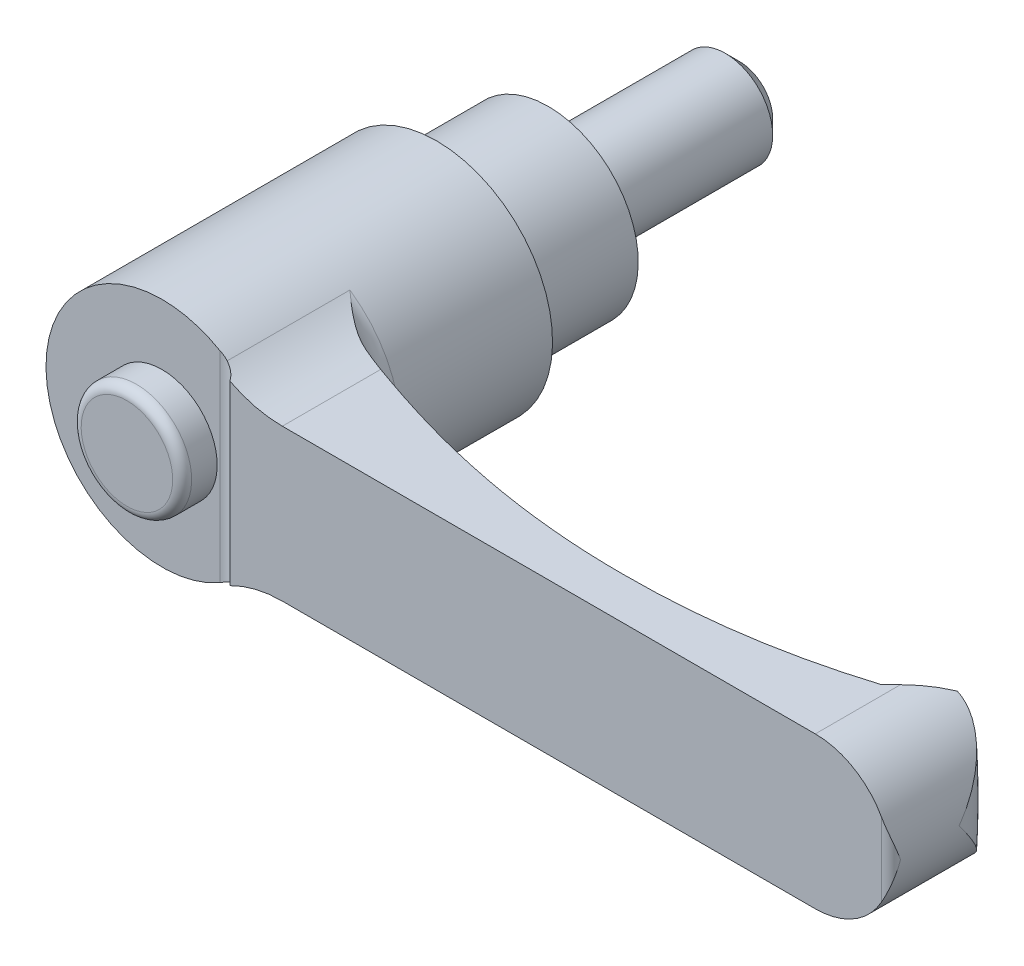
ISO-10303-21;
HEADER;
FILE_DESCRIPTION(('STEP AP214'),'2;1');
FILE_NAME('part.step','',(''),(''),'','','');
FILE_SCHEMA(('AUTOMOTIVE_DESIGN { 1 0 10303 214 1 1 1 1 }'));
ENDSEC;
DATA;
#1=APPLICATION_CONTEXT('core data for automotive mechanical design processes');
#2=APPLICATION_PROTOCOL_DEFINITION('international standard','automotive_design',2000,#1);
#3=PRODUCT_CONTEXT('',#1,'mechanical');
#4=PRODUCT('Part','Part','',(#3));
#5=PRODUCT_RELATED_PRODUCT_CATEGORY('part','',(#4));
#6=PRODUCT_DEFINITION_FORMATION('','',#4);
#7=PRODUCT_DEFINITION_CONTEXT('part definition',#1,'design');
#8=PRODUCT_DEFINITION('design','',#6,#7);
#9=PRODUCT_DEFINITION_SHAPE('','',#8);
#10=(LENGTH_UNIT() NAMED_UNIT(*) SI_UNIT(.MILLI.,.METRE.));
#11=(NAMED_UNIT(*) PLANE_ANGLE_UNIT() SI_UNIT($,.RADIAN.));
#12=(NAMED_UNIT(*) SI_UNIT($,.STERADIAN.) SOLID_ANGLE_UNIT());
#13=UNCERTAINTY_MEASURE_WITH_UNIT(LENGTH_MEASURE(1.E-05),#10,'distance_accuracy_value','');
#14=(GEOMETRIC_REPRESENTATION_CONTEXT(3) GLOBAL_UNCERTAINTY_ASSIGNED_CONTEXT((#13)) GLOBAL_UNIT_ASSIGNED_CONTEXT((#10,
#11,#12)) REPRESENTATION_CONTEXT('',''));
#15=CARTESIAN_POINT('',(0.,0.,0.));
#16=DIRECTION('',(0.,0.,1.));
#17=DIRECTION('',(1.,0.,0.));
#18=AXIS2_PLACEMENT_3D('',#15,#16,#17);
#19=CARTESIAN_POINT('',(7.6,0.,0.));
#20=DIRECTION('',(0.,0.,1.));
#21=DIRECTION('',(0.,-1.,0.));
#22=AXIS2_PLACEMENT_3D('',#19,#20,#21);
#23=PLANE('',#22);
#24=CARTESIAN_POINT('',(0.,0.,0.));
#25=DIRECTION('',(0.,0.,-1.));
#26=DIRECTION('',(0.,1.,0.));
#27=AXIS2_PLACEMENT_3D('',#24,#25,#26);
#28=CIRCLE('',#27,5.);
#29=CARTESIAN_POINT('',(0.,5.,0.));
#30=VERTEX_POINT('',#29);
#31=EDGE_CURVE('E422',#30,#30,#28,.T.);
#32=ORIENTED_EDGE('',*,*,#31,.F.);
#33=EDGE_LOOP('',(#32));
#34=FACE_BOUND('',#33,.T.);
#35=CARTESIAN_POINT('',(0.,0.,0.));
#36=DIRECTION('',(0.,0.,-1.));
#37=DIRECTION('',(0.,1.,0.));
#38=AXIS2_PLACEMENT_3D('',#35,#36,#37);
#39=CIRCLE('',#38,7.6);
#40=CARTESIAN_POINT('',(0.,7.6,0.));
#41=VERTEX_POINT('',#40);
#42=EDGE_CURVE('E347',#41,#41,#39,.T.);
#43=ORIENTED_EDGE('',*,*,#42,.T.);
#44=EDGE_LOOP('',(#43));
#45=FACE_BOUND('',#44,.T.);
#46=ADVANCED_FACE('F14',(#34,#45),#23,.F.);
#47=CARTESIAN_POINT('',(0.,0.,41.));
#48=DIRECTION('',(0.,0.,-1.));
#49=DIRECTION('',(0.,1.,0.));
#50=AXIS2_PLACEMENT_3D('',#47,#48,#49);
#51=PLANE('',#50);
#52=DIRECTION('',(0.,1.,0.));
#53=VECTOR('',#52,1.);
#54=CARTESIAN_POINT('',(6.125,-16.,41.));
#55=LINE('',#54,#53);
#56=CARTESIAN_POINT('',(6.125,-10.6088111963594,41.));
#57=VERTEX_POINT('',#56);
#58=CARTESIAN_POINT('',(6.125,10.6088111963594,41.));
#59=VERTEX_POINT('',#58);
#60=EDGE_CURVE('E385',#57,#59,#55,.T.);
#61=ORIENTED_EDGE('',*,*,#60,.T.);
#62=CARTESIAN_POINT('',(0.,0.,41.));
#63=DIRECTION('',(0.,0.,-1.));
#64=DIRECTION('',(0.,1.,0.));
#65=AXIS2_PLACEMENT_3D('',#62,#63,#64);
#66=CIRCLE('',#65,12.25);
#67=EDGE_CURVE('E332',#57,#59,#66,.T.);
#68=ORIENTED_EDGE('',*,*,#67,.F.);
#69=EDGE_LOOP('',(#61,#68));
#70=FACE_BOUND('',#69,.T.);
#71=CARTESIAN_POINT('',(0.,0.,41.));
#72=DIRECTION('',(0.,0.,-1.));
#73=DIRECTION('',(0.,1.,0.));
#74=AXIS2_PLACEMENT_3D('',#71,#72,#73);
#75=CIRCLE('',#74,5.83333333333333);
#76=CARTESIAN_POINT('',(0.,5.83333333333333,41.));
#77=VERTEX_POINT('',#76);
#78=EDGE_CURVE('E193',#77,#77,#75,.F.);
#79=ORIENTED_EDGE('',*,*,#78,.F.);
#80=EDGE_LOOP('',(#79));
#81=FACE_BOUND('',#80,.T.);
#82=ADVANCED_FACE('F163',(#70,#81),#51,.F.);
#83=CARTESIAN_POINT('',(70.,0.,0.));
#84=DIRECTION('',(0.,0.,1.));
#85=DIRECTION('',(0.,-1.,0.));
#86=AXIS2_PLACEMENT_3D('',#83,#84,#85);
#87=CYLINDRICAL_SURFACE('',#86,8.);
#88=CARTESIAN_POINT('',(78.,0.,34.8));
#89=CARTESIAN_POINT('',(78.0000000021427,-0.00507455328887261,34.7962762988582));
#90=CARTESIAN_POINT('',(77.9999951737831,-0.0101492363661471,34.7925524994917));
#91=CARTESIAN_POINT('',(77.9989416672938,-0.563628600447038,34.3864095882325));
#92=CARTESIAN_POINT('',(77.9414802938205,-1.11346566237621,33.9829298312));
#93=CARTESIAN_POINT('',(77.7692220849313,-1.92787753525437,33.38939297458));
#94=CARTESIAN_POINT('',(77.697249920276,-2.19810314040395,33.1931504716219));
#95=CARTESIAN_POINT('',(77.5237934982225,-2.73341157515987,32.8066637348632));
#96=CARTESIAN_POINT('',(77.4223242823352,-2.99849695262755,32.6164164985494));
#97=CARTESIAN_POINT('',(77.2199237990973,-3.45210642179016,32.2938177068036));
#98=CARTESIAN_POINT('',(77.1259458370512,-3.64233939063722,32.1594598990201));
#99=CARTESIAN_POINT('',(76.9211711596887,-4.01785016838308,31.8966888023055));
#100=CARTESIAN_POINT('',(76.8103745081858,-4.20312799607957,31.7682754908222));
#101=CARTESIAN_POINT('',(76.5717542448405,-4.56719869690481,31.5191542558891));
#102=CARTESIAN_POINT('',(76.4439640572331,-4.74600344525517,31.3984318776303));
#103=CARTESIAN_POINT('',(76.1708976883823,-5.09601175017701,31.1663364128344));
#104=CARTESIAN_POINT('',(76.0256268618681,-5.26721761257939,31.0549604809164));
#105=CARTESIAN_POINT('',(75.6441829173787,-5.67932922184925,30.7937387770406));
#106=CARTESIAN_POINT('',(75.3974573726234,-5.9150123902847,30.6505327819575));
#107=CARTESIAN_POINT('',(74.9987611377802,-6.24839682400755,30.4615945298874));
#108=CARTESIAN_POINT('',(74.8611020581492,-6.35616332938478,30.4029292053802));
#109=CARTESIAN_POINT('',(74.5764070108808,-6.56410843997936,30.2956150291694));
#110=CARTESIAN_POINT('',(74.429373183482,-6.66428876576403,30.2469639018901));
#111=CARTESIAN_POINT('',(74.1592544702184,-6.83522850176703,30.1705684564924));
#112=CARTESIAN_POINT('',(74.0378615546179,-6.90766708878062,30.1405781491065));
#113=CARTESIAN_POINT('',(73.7901015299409,-7.04665102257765,30.0886005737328));
#114=CARTESIAN_POINT('',(73.6637356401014,-7.11319780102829,30.0666113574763));
#115=CARTESIAN_POINT('',(73.4066843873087,-7.23982141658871,30.0315221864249));
#116=CARTESIAN_POINT('',(73.2760017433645,-7.2999022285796,30.0184167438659));
#117=CARTESIAN_POINT('',(73.0110423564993,-7.41312181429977,30.0019547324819));
#118=CARTESIAN_POINT('',(72.8767656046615,-7.46626057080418,29.9985981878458));
#119=CARTESIAN_POINT('',(72.6044130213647,-7.56559501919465,30.0024862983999));
#120=CARTESIAN_POINT('',(72.4663137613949,-7.6117232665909,30.009827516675));
#121=CARTESIAN_POINT('',(72.1887878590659,-7.69611880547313,30.0360283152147));
#122=CARTESIAN_POINT('',(72.0493611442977,-7.73438566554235,30.0548885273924));
#123=CARTESIAN_POINT('',(71.770740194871,-7.80288648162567,30.1046814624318));
#124=CARTESIAN_POINT('',(71.6315458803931,-7.83312431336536,30.1356083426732));
#125=CARTESIAN_POINT('',(71.3550409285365,-7.885663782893,30.2098119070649));
#126=CARTESIAN_POINT('',(71.217729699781,-7.90796796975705,30.2530846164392));
#127=CARTESIAN_POINT('',(70.8920238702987,-7.95241951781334,30.3719934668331));
#128=CARTESIAN_POINT('',(70.7052564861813,-7.97090772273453,30.4536477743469));
#129=CARTESIAN_POINT('',(70.433708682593,-7.98875485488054,30.5937624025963));
#130=CARTESIAN_POINT('',(70.3445710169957,-7.99305594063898,30.6434445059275));
#131=CARTESIAN_POINT('',(70.1696001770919,-7.99868029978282,30.7485120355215));
#132=CARTESIAN_POINT('',(70.0837676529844,-8.00000299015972,30.8038985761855));
#133=CARTESIAN_POINT('',(69.9998,-7.9999999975,30.8620428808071));
#134=B_SPLINE_CURVE_WITH_KNOTS('',3,(#88,#89,#90,#91,#92,#93,#94,#95,#96,#97,#98,#99,#100,#101,
#102,#103,#104,#105,#106,#107,#108,#109,#110,#111,#112,#113,#114,#115,#116,#117,#118,#119,#120,
#121,#122,#123,#124,#125,#126,#127,#128,#129,#130,#131,#132,#133),.UNSPECIFIED.,.F.,.F.,(4,2,2,
2,2,2,2,2,2,2,2,2,2,2,2,2,2,2,2,2,2,2,4),(0.,0.0188831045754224,2.05946970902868,
3.08347088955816,4.10695081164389,4.85978230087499,5.6126109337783,6.36398015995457,
7.11511980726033,8.22062566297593,8.77332293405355,9.32589447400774,9.75904172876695,
10.1920834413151,10.624857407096,11.0576324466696,11.4943381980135,11.9310679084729,
12.3675864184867,12.8039645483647,13.4155655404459,13.721767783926,14.0280299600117),.UNSPECIFIED.);
#135=CARTESIAN_POINT('',(72.9968893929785,-7.41745603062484,30.0031106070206));
#136=VERTEX_POINT('',#135);
#137=CARTESIAN_POINT('',(78.,0.,34.8));
#138=VERTEX_POINT('',#137);
#139=EDGE_CURVE('E126',#136,#138,#134,.F.);
#140=ORIENTED_EDGE('',*,*,#139,.T.);
#141=CARTESIAN_POINT('',(78.,0.,34.8));
#142=CARTESIAN_POINT('',(78.0000000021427,0.00507455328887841,34.7962762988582));
#143=CARTESIAN_POINT('',(77.9999951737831,0.0101492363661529,34.7925524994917));
#144=CARTESIAN_POINT('',(77.9989416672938,0.563628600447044,34.3864095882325));
#145=CARTESIAN_POINT('',(77.9414802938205,1.11346566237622,33.9829298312));
#146=CARTESIAN_POINT('',(77.7692220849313,1.92787753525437,33.38939297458));
#147=CARTESIAN_POINT('',(77.697249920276,2.19810314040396,33.1931504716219));
#148=CARTESIAN_POINT('',(77.5237934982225,2.73341157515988,32.8066637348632));
#149=CARTESIAN_POINT('',(77.4223242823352,2.99849695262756,32.6164164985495));
#150=CARTESIAN_POINT('',(77.2199237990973,3.45210642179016,32.2938177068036));
#151=CARTESIAN_POINT('',(77.1259458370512,3.64233939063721,32.1594598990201));
#152=CARTESIAN_POINT('',(76.9211711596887,4.01785016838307,31.8966888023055));
#153=CARTESIAN_POINT('',(76.8103745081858,4.20312799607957,31.7682754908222));
#154=CARTESIAN_POINT('',(76.5717542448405,4.56719869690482,31.5191542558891));
#155=CARTESIAN_POINT('',(76.4439640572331,4.74600344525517,31.3984318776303));
#156=CARTESIAN_POINT('',(76.1708976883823,5.09601175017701,31.1663364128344));
#157=CARTESIAN_POINT('',(76.0256268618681,5.26721761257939,31.0549604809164));
#158=CARTESIAN_POINT('',(75.6441829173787,5.67932922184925,30.7937387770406));
#159=CARTESIAN_POINT('',(75.3974573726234,5.91501239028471,30.6505327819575));
#160=CARTESIAN_POINT('',(74.9987611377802,6.24839682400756,30.4615945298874));
#161=CARTESIAN_POINT('',(74.8611020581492,6.35616332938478,30.4029292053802));
#162=CARTESIAN_POINT('',(74.5764070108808,6.56410843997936,30.2956150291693));
#163=CARTESIAN_POINT('',(74.429373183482,6.66428876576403,30.2469639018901));
#164=CARTESIAN_POINT('',(74.1592544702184,6.83522850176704,30.1705684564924));
#165=CARTESIAN_POINT('',(74.0378615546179,6.90766708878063,30.1405781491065));
#166=CARTESIAN_POINT('',(73.7901015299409,7.04665102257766,30.0886005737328));
#167=CARTESIAN_POINT('',(73.6637356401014,7.11319780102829,30.0666113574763));
#168=CARTESIAN_POINT('',(73.4066843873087,7.23982141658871,30.0315221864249));
#169=CARTESIAN_POINT('',(73.2760017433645,7.2999022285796,30.0184167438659));
#170=CARTESIAN_POINT('',(73.0110423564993,7.41312181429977,30.0019547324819));
#171=CARTESIAN_POINT('',(72.8767656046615,7.46626057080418,29.9985981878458));
#172=CARTESIAN_POINT('',(72.6044130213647,7.56559501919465,30.0024862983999));
#173=CARTESIAN_POINT('',(72.4663137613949,7.61172326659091,30.009827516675));
#174=CARTESIAN_POINT('',(72.1887878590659,7.69611880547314,30.0360283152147));
#175=CARTESIAN_POINT('',(72.0493611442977,7.73438566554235,30.0548885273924));
#176=CARTESIAN_POINT('',(71.770740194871,7.80288648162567,30.1046814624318));
#177=CARTESIAN_POINT('',(71.6315458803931,7.83312431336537,30.1356083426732));
#178=CARTESIAN_POINT('',(71.3550409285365,7.885663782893,30.2098119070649));
#179=CARTESIAN_POINT('',(71.217729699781,7.90796796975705,30.2530846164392));
#180=CARTESIAN_POINT('',(70.8920238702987,7.95241951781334,30.3719934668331));
#181=CARTESIAN_POINT('',(70.7052564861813,7.97090772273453,30.4536477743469));
#182=CARTESIAN_POINT('',(70.433708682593,7.98875485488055,30.5937624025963));
#183=CARTESIAN_POINT('',(70.3445710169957,7.99305594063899,30.6434445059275));
#184=CARTESIAN_POINT('',(70.1696001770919,7.99868029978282,30.7485120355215));
#185=CARTESIAN_POINT('',(70.0837676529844,8.00000299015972,30.8038985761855));
#186=CARTESIAN_POINT('',(69.9998,7.9999999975,30.8620428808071));
#187=B_SPLINE_CURVE_WITH_KNOTS('',3,(#141,#142,#143,#144,#145,#146,#147,#148,#149,#150,#151,
#152,#153,#154,#155,#156,#157,#158,#159,#160,#161,#162,#163,#164,#165,#166,#167,#168,#169,#170,
#171,#172,#173,#174,#175,#176,#177,#178,#179,#180,#181,#182,#183,#184,#185,#186),.UNSPECIFIED.,
.F.,.F.,(4,2,2,2,2,2,2,2,2,2,2,2,2,2,2,2,2,2,2,2,2,2,4),(0.,0.0188831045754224,2.05946970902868,
3.08347088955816,4.10695081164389,4.85978230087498,5.61261093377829,6.36398015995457,
7.11511980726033,8.22062566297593,8.77332293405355,9.32589447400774,9.75904172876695,
10.1920834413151,10.6248574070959,11.0576324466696,11.4943381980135,11.9310679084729,
12.3675864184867,12.8039645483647,13.4155655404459,13.721767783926,14.0280299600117),.UNSPECIFIED.);
#188=CARTESIAN_POINT('',(72.9968893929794,7.41745603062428,30.0031106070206));
#189=VERTEX_POINT('',#188);
#190=EDGE_CURVE('E123',#138,#189,#187,.T.);
#191=ORIENTED_EDGE('',*,*,#190,.T.);
#192=CARTESIAN_POINT('',(70.,0.,33.));
#193=DIRECTION('',(-0.707106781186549,0.,-0.707106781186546));
#194=DIRECTION('',(-0.707106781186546,0.,0.707106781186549));
#195=AXIS2_PLACEMENT_3D('',#192,#193,#194);
#196=ELLIPSE('',#195,11.3137084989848,8.);
#197=CARTESIAN_POINT('',(70.,8.,33.));
#198=VERTEX_POINT('',#197);
#199=EDGE_CURVE('E378',#189,#198,#196,.F.);
#200=ORIENTED_EDGE('',*,*,#199,.T.);
#201=DIRECTION('',(0.,0.,1.));
#202=VECTOR('',#201,1.);
#203=CARTESIAN_POINT('',(70.,8.,0.));
#204=LINE('',#203,#202);
#205=CARTESIAN_POINT('',(70.,8.,42.));
#206=VERTEX_POINT('',#205);
#207=EDGE_CURVE('E354',#198,#206,#204,.T.);
#208=ORIENTED_EDGE('',*,*,#207,.T.);
#209=CARTESIAN_POINT('',(70.,0.,42.));
#210=DIRECTION('',(0.,0.,1.));
#211=DIRECTION('',(0.,-1.,0.));
#212=AXIS2_PLACEMENT_3D('',#209,#210,#211);
#213=CIRCLE('',#212,8.);
#214=CARTESIAN_POINT('',(77.,3.87298334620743,42.));
#215=VERTEX_POINT('',#214);
#216=EDGE_CURVE('E327',#215,#206,#213,.T.);
#217=ORIENTED_EDGE('',*,*,#216,.F.);
#218=CARTESIAN_POINT('',(77.,3.87298334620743,42.));
#219=CARTESIAN_POINT('',(77.0320487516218,3.8150611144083,41.9999909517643));
#220=CARTESIAN_POINT('',(77.0633658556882,3.75675902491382,41.9984605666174));
#221=CARTESIAN_POINT('',(77.1244803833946,3.63952511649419,41.99269833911));
#222=CARTESIAN_POINT('',(77.1542784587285,3.58059358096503,41.9884676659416));
#223=CARTESIAN_POINT('',(77.241218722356,3.40324230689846,41.9722589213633));
#224=CARTESIAN_POINT('',(77.2960525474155,3.28400247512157,41.9567609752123));
#225=CARTESIAN_POINT('',(77.3991566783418,3.04456972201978,41.9185214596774));
#226=CARTESIAN_POINT('',(77.4474555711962,2.9243835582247,41.8958129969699));
#227=CARTESIAN_POINT('',(77.5378429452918,2.68282861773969,41.8446429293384));
#228=CARTESIAN_POINT('',(77.5799268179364,2.56145903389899,41.8161770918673));
#229=CARTESIAN_POINT('',(77.6827368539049,2.24038507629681,41.7351721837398));
#230=CARTESIAN_POINT('',(77.7382927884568,2.03996193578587,41.6788382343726));
#231=CARTESIAN_POINT('',(77.8332865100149,1.63779800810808,41.55814944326));
#232=CARTESIAN_POINT('',(77.8727175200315,1.43605670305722,41.4937912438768));
#233=CARTESIAN_POINT('',(77.967421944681,0.829293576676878,41.2932012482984));
#234=CARTESIAN_POINT('',(77.999127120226,0.42266785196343,41.1494356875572));
#235=CARTESIAN_POINT('',(77.9999940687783,0.0112434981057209,41.0039751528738));
#236=CARTESIAN_POINT('',(77.9999999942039,0.00562166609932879,41.0019875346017));
#237=CARTESIAN_POINT('',(78.,0.,41.));
#238=B_SPLINE_CURVE_WITH_KNOTS('',3,(#218,#219,#220,#221,#222,#223,#224,#225,#226,#227,#228,
#229,#230,#231,#232,#233,#234,#235,#236,#237),.UNSPECIFIED.,.F.,.F.,(4,2,2,2,2,2,2,2,2,4),(0.,
0.198535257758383,0.396984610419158,0.792983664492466,1.18719018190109,1.5816875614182,
2.22713013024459,2.8728436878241,4.16406208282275,4.18195063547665),.UNSPECIFIED.);
#239=CARTESIAN_POINT('',(78.,0.,41.));
#240=VERTEX_POINT('',#239);
#241=EDGE_CURVE('E179',#240,#215,#238,.F.);
#242=ORIENTED_EDGE('',*,*,#241,.F.);
#243=CARTESIAN_POINT('',(77.,-3.87298334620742,42.));
#244=CARTESIAN_POINT('',(77.0320487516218,-3.81506111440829,41.9999909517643));
#245=CARTESIAN_POINT('',(77.0633658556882,-3.75675902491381,41.9984605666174));
#246=CARTESIAN_POINT('',(77.1244803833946,-3.63952511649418,41.99269833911));
#247=CARTESIAN_POINT('',(77.1542784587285,-3.58059358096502,41.9884676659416));
#248=CARTESIAN_POINT('',(77.241218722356,-3.40324230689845,41.9722589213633));
#249=CARTESIAN_POINT('',(77.2960525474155,-3.28400247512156,41.9567609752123));
#250=CARTESIAN_POINT('',(77.3991566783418,-3.04456972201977,41.9185214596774));
#251=CARTESIAN_POINT('',(77.4474555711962,-2.92438355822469,41.8958129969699));
#252=CARTESIAN_POINT('',(77.5378429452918,-2.68282861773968,41.8446429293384));
#253=CARTESIAN_POINT('',(77.5799268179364,-2.56145903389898,41.8161770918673));
#254=CARTESIAN_POINT('',(77.6827368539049,-2.2403850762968,41.7351721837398));
#255=CARTESIAN_POINT('',(77.7382927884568,-2.03996193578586,41.6788382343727));
#256=CARTESIAN_POINT('',(77.8332865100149,-1.63779800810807,41.55814944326));
#257=CARTESIAN_POINT('',(77.8727175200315,-1.43605670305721,41.4937912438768));
#258=CARTESIAN_POINT('',(77.967421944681,-0.829293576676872,41.2932012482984));
#259=CARTESIAN_POINT('',(77.999127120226,-0.422667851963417,41.1494356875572));
#260=CARTESIAN_POINT('',(77.9999940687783,-0.0112434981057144,41.0039751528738));
#261=CARTESIAN_POINT('',(77.9999999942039,-0.00562166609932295,41.0019875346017));
#262=CARTESIAN_POINT('',(78.,0.,41.));
#263=B_SPLINE_CURVE_WITH_KNOTS('',3,(#243,#244,#245,#246,#247,#248,#249,#250,#251,#252,#253,
#254,#255,#256,#257,#258,#259,#260,#261,#262),.UNSPECIFIED.,.F.,.F.,(4,2,2,2,2,2,2,2,2,4),(0.,
0.19853525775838,0.396984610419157,0.792983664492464,1.18719018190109,1.5816875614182,
2.2271301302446,2.8728436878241,4.16406208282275,4.18195063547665),.UNSPECIFIED.);
#264=CARTESIAN_POINT('',(77.,-3.87298334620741,42.));
#265=VERTEX_POINT('',#264);
#266=EDGE_CURVE('E187',#265,#240,#263,.T.);
#267=ORIENTED_EDGE('',*,*,#266,.F.);
#268=CARTESIAN_POINT('',(70.,-8.,42.));
#269=VERTEX_POINT('',#268);
#270=EDGE_CURVE('E322',#269,#265,#213,.T.);
#271=ORIENTED_EDGE('',*,*,#270,.F.);
#272=DIRECTION('',(0.,0.,1.));
#273=VECTOR('',#272,1.);
#274=CARTESIAN_POINT('',(70.,-8.,0.));
#275=LINE('',#274,#273);
#276=CARTESIAN_POINT('',(70.,-8.,33.));
#277=VERTEX_POINT('',#276);
#278=EDGE_CURVE('E357',#277,#269,#275,.T.);
#279=ORIENTED_EDGE('',*,*,#278,.F.);
#280=EDGE_CURVE('E137',#277,#136,#196,.F.);
#281=ORIENTED_EDGE('',*,*,#280,.T.);
#282=EDGE_LOOP('',(#140,#191,#200,#208,#217,#242,#267,#271,#279,#281));
#283=FACE_BOUND('',#282,.T.);
#284=ADVANCED_FACE('F135',(#283),#87,.T.);
#285=CARTESIAN_POINT('',(73.,-16.,30.));
#286=DIRECTION('',(-0.707106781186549,0.,-0.707106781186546));
#287=DIRECTION('',(0.707106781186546,0.,-0.707106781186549));
#288=AXIS2_PLACEMENT_3D('',#285,#286,#287);
#289=PLANE('',#288);
#290=DIRECTION('',(0.,1.,0.));
#291=VECTOR('',#290,1.);
#292=CARTESIAN_POINT('',(73.,-16.,30.));
#293=LINE('',#292,#291);
#294=CARTESIAN_POINT('',(73.,-5.40740233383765,30.));
#295=VERTEX_POINT('',#294);
#296=CARTESIAN_POINT('',(73.,5.40740233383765,30.));
#297=VERTEX_POINT('',#296);
#298=EDGE_CURVE('E397',#295,#297,#293,.T.);
#299=ORIENTED_EDGE('',*,*,#298,.F.);
#300=CARTESIAN_POINT('',(72.9944134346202,8.0002,30.0055865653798));
#301=CARTESIAN_POINT('',(72.9964174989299,7.60019527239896,30.0035825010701));
#302=CARTESIAN_POINT('',(72.9977626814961,7.20018596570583,30.0022373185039));
#303=CARTESIAN_POINT('',(72.9994970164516,6.40016550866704,30.0005029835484));
#304=CARTESIAN_POINT('',(72.9998861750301,6.00015435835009,30.0001138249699));
#305=CARTESIAN_POINT('',(73.0000702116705,5.20013335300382,29.9999297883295));
#306=CARTESIAN_POINT('',(72.9998650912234,4.80012349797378,30.0001349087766));
#307=CARTESIAN_POINT('',(72.9991717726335,4.00010369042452,30.0008282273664));
#308=CARTESIAN_POINT('',(72.998683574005,3.60009373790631,30.001316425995));
#309=CARTESIAN_POINT('',(72.9972116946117,2.40006658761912,30.0027883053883));
#310=CARTESIAN_POINT('',(72.9962207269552,1.60004928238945,30.0037792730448));
#311=CARTESIAN_POINT('',(72.9954610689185,1.3601944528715E-05,30.0045389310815));
#312=CARTESIAN_POINT('',(72.9956923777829,-0.800004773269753,30.004307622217));
#313=CARTESIAN_POINT('',(72.9968584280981,-2.13336982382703,30.0031415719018));
#314=CARTESIAN_POINT('',(72.9975329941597,-2.66671710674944,30.0024670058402));
#315=CARTESIAN_POINT('',(72.9988528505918,-3.73341119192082,30.0011471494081));
#316=CARTESIAN_POINT('',(72.999498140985,-4.26675799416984,30.000501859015));
#317=CARTESIAN_POINT('',(73.000124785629,-5.33345534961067,29.999875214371));
#318=CARTESIAN_POINT('',(73.0001061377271,-5.86680590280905,29.9998938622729));
#319=CARTESIAN_POINT('',(72.9985813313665,-6.93350631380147,30.0014186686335));
#320=CARTESIAN_POINT('',(72.997075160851,-7.46685617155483,30.002924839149));
#321=CARTESIAN_POINT('',(72.9944134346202,-8.0002,30.0055865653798));
#322=B_SPLINE_CURVE_WITH_KNOTS('',3,(#300,#301,#302,#303,#304,#305,#306,#307,#308,#309,#310,
#311,#312,#313,#314,#315,#316,#317,#318,#319,#320,#321),.UNSPECIFIED.,.F.,.F.,(4,2,2,2,2,2,2,2,
2,2,4),(0.,1.20004037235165,2.40007297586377,3.60010256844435,4.80013422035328,7.20018907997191,
9.60024245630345,11.2002867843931,12.8003298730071,14.4003781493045,16.0004393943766),.UNSPECIFIED.);
#323=EDGE_CURVE('E138',#295,#136,#322,.T.);
#324=ORIENTED_EDGE('',*,*,#323,.T.);
#325=ORIENTED_EDGE('',*,*,#280,.F.);
#326=DIRECTION('',(-0.707106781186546,0.,0.707106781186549));
#327=VECTOR('',#326,1.);
#328=CARTESIAN_POINT('',(86.5,-8.,16.5));
#329=LINE('',#328,#327);
#330=CARTESIAN_POINT('',(69.,-8.,34.));
#331=VERTEX_POINT('',#330);
#332=EDGE_CURVE('E321',#277,#331,#329,.T.);
#333=ORIENTED_EDGE('',*,*,#332,.T.);
#334=DIRECTION('',(0.,1.,0.));
#335=VECTOR('',#334,1.);
#336=CARTESIAN_POINT('',(69.,-16.,34.));
#337=LINE('',#336,#335);
#338=CARTESIAN_POINT('',(69.,8.,34.));
#339=VERTEX_POINT('',#338);
#340=EDGE_CURVE('E319',#331,#339,#337,.T.);
#341=ORIENTED_EDGE('',*,*,#340,.T.);
#342=DIRECTION('',(0.707106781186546,0.,-0.707106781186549));
#343=VECTOR('',#342,1.);
#344=CARTESIAN_POINT('',(58.3567940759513,8.,44.6432059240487));
#345=LINE('',#344,#343);
#346=EDGE_CURVE('E375',#339,#198,#345,.T.);
#347=ORIENTED_EDGE('',*,*,#346,.T.);
#348=ORIENTED_EDGE('',*,*,#199,.F.);
#349=EDGE_CURVE('E129',#189,#297,#322,.T.);
#350=ORIENTED_EDGE('',*,*,#349,.T.);
#351=EDGE_LOOP('',(#299,#324,#325,#333,#341,#347,#348,#350));
#352=FACE_BOUND('',#351,.T.);
#353=ADVANCED_FACE('F162',(#352),#289,.T.);
#354=CARTESIAN_POINT('',(73.2,-16.,30.));
#355=DIRECTION('',(0.,0.,-1.));
#356=DIRECTION('',(0.,1.,0.));
#357=AXIS2_PLACEMENT_3D('',#354,#355,#356);
#358=PLANE('',#357);
#359=ORIENTED_EDGE('',*,*,#298,.T.);
#360=CARTESIAN_POINT('',(0.,0.,30.));
#361=DIRECTION('',(0.,0.,-1.));
#362=DIRECTION('',(0.,1.,0.));
#363=AXIS2_PLACEMENT_3D('',#360,#361,#362);
#364=CIRCLE('',#363,73.2);
#365=EDGE_CURVE('E36',#297,#295,#364,.T.);
#366=ORIENTED_EDGE('',*,*,#365,.T.);
#367=EDGE_LOOP('',(#359,#366));
#368=FACE_BOUND('',#367,.T.);
#369=ADVANCED_FACE('F201',(#368),#358,.T.);
#370=CARTESIAN_POINT('',(0.,0.,42.));
#371=DIRECTION('',(0.,0.,1.));
#372=DIRECTION('',(0.,-1.,0.));
#373=AXIS2_PLACEMENT_3D('',#370,#371,#372);
#374=PLANE('',#373);
#375=CARTESIAN_POINT('',(13.7135881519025,20.,42.));
#376=DIRECTION('',(0.,0.,1.));
#377=DIRECTION('',(1.,0.,0.));
#378=AXIS2_PLACEMENT_3D('',#375,#376,#377);
#379=CIRCLE('',#378,12.);
#380=CARTESIAN_POINT('',(8.16666666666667,9.35896330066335,42.));
#381=VERTEX_POINT('',#380);
#382=CARTESIAN_POINT('',(13.7135881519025,8.,42.));
#383=VERTEX_POINT('',#382);
#384=EDGE_CURVE('E372',#381,#383,#379,.T.);
#385=ORIENTED_EDGE('',*,*,#384,.F.);
#386=DIRECTION('',(0.,1.,0.));
#387=VECTOR('',#386,1.);
#388=CARTESIAN_POINT('',(8.16666666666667,-16.,42.));
#389=LINE('',#388,#387);
#390=CARTESIAN_POINT('',(8.16666666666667,-9.35896330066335,42.));
#391=VERTEX_POINT('',#390);
#392=EDGE_CURVE('E392',#391,#381,#389,.T.);
#393=ORIENTED_EDGE('',*,*,#392,.F.);
#394=CARTESIAN_POINT('',(13.7135881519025,-20.,42.));
#395=DIRECTION('',(0.,0.,1.));
#396=DIRECTION('',(1.,0.,0.));
#397=AXIS2_PLACEMENT_3D('',#394,#395,#396);
#398=CIRCLE('',#397,12.);
#399=CARTESIAN_POINT('',(13.7135881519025,-8.,42.));
#400=VERTEX_POINT('',#399);
#401=EDGE_CURVE('E363',#400,#391,#398,.T.);
#402=ORIENTED_EDGE('',*,*,#401,.F.);
#403=DIRECTION('',(-1.,0.,0.));
#404=VECTOR('',#403,1.);
#405=CARTESIAN_POINT('',(70.,-8.,42.));
#406=LINE('',#405,#404);
#407=EDGE_CURVE('E366',#269,#400,#406,.T.);
#408=ORIENTED_EDGE('',*,*,#407,.F.);
#409=ORIENTED_EDGE('',*,*,#270,.T.);
#410=DIRECTION('',(0.,1.,0.));
#411=VECTOR('',#410,1.);
#412=CARTESIAN_POINT('',(77.,-16.,42.));
#413=LINE('',#412,#411);
#414=EDGE_CURVE('E393',#265,#215,#413,.T.);
#415=ORIENTED_EDGE('',*,*,#414,.T.);
#416=ORIENTED_EDGE('',*,*,#216,.T.);
#417=DIRECTION('',(1.,0.,0.));
#418=VECTOR('',#417,1.);
#419=CARTESIAN_POINT('',(13.7135881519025,8.,42.));
#420=LINE('',#419,#418);
#421=EDGE_CURVE('E369',#383,#206,#420,.T.);
#422=ORIENTED_EDGE('',*,*,#421,.F.);
#423=EDGE_LOOP('',(#385,#393,#402,#408,#409,#415,#416,#422));
#424=FACE_BOUND('',#423,.T.);
#425=ADVANCED_FACE('F248',(#424),#374,.T.);
#426=CARTESIAN_POINT('',(0.,0.,0.));
#427=DIRECTION('',(0.,0.,-1.));
#428=DIRECTION('',(0.,1.,0.));
#429=AXIS2_PLACEMENT_3D('',#426,#427,#428);
#430=CYLINDRICAL_SURFACE('',#429,12.25);
#431=CARTESIAN_POINT('',(0.,0.,28.0779919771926));
#432=DIRECTION('',(0.,0.,-1.));
#433=DIRECTION('',(0.,1.,0.));
#434=AXIS2_PLACEMENT_3D('',#431,#432,#433);
#435=CIRCLE('',#434,12.25);
#436=CARTESIAN_POINT('',(6.92748267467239,10.1030927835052,28.0779919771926));
#437=VERTEX_POINT('',#436);
#438=CARTESIAN_POINT('',(6.92748267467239,-10.1030927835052,28.0779919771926));
#439=VERTEX_POINT('',#438);
#440=EDGE_CURVE('E412',#437,#439,#435,.T.);
#441=ORIENTED_EDGE('',*,*,#440,.T.);
#442=DIRECTION('',(0.,0.,1.));
#443=VECTOR('',#442,1.);
#444=CARTESIAN_POINT('',(6.92748267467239,-10.1030927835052,0.));
#445=LINE('',#444,#443);
#446=CARTESIAN_POINT('',(6.92748267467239,-10.1030927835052,41.0427567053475));
#447=VERTEX_POINT('',#446);
#448=EDGE_CURVE('E361',#439,#447,#445,.T.);
#449=ORIENTED_EDGE('',*,*,#448,.T.);
#450=CARTESIAN_POINT('',(6.125,-10.6088111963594,41.));
#451=CARTESIAN_POINT('',(6.19832883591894,-10.5664875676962,40.9889897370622));
#452=CARTESIAN_POINT('',(6.27164451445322,-10.523132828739,40.9821479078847));
#453=CARTESIAN_POINT('',(6.41753908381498,-10.4347921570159,40.9764986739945));
#454=CARTESIAN_POINT('',(6.49011843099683,-10.3898073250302,40.9776859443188));
#455=CARTESIAN_POINT('',(6.63402897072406,-10.2985167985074,40.9877856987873));
#456=CARTESIAN_POINT('',(6.70535828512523,-10.2522093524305,40.996708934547));
#457=CARTESIAN_POINT('',(6.84611057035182,-10.1587605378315,41.0220012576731));
#458=CARTESIAN_POINT('',(6.91553331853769,-10.1116190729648,41.0383712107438));
#459=CARTESIAN_POINT('',(7.10641045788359,-9.97916014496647,41.094233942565));
#460=CARTESIAN_POINT('',(7.22525798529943,-9.89334730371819,41.1417583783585));
#461=CARTESIAN_POINT('',(7.45241295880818,-9.72337963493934,41.2589427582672));
#462=CARTESIAN_POINT('',(7.56074253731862,-9.63922163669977,41.3285548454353));
#463=CARTESIAN_POINT('',(7.71168483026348,-9.51821587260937,41.4479066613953));
#464=CARTESIAN_POINT('',(7.75936397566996,-9.47936365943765,41.4893658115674));
#465=CARTESIAN_POINT('',(7.85125896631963,-9.40339173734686,41.5773725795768));
#466=CARTESIAN_POINT('',(7.89547657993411,-9.36627114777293,41.6239175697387));
#467=CARTESIAN_POINT('',(7.98020904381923,-9.29418452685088,41.7223463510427));
#468=CARTESIAN_POINT('',(8.02070494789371,-9.25922978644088,41.7742548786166));
#469=CARTESIAN_POINT('',(8.09722101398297,-9.19239515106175,41.8832605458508));
#470=CARTESIAN_POINT('',(8.13323329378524,-9.16052069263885,41.9403665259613));
#471=CARTESIAN_POINT('',(8.16666666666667,-9.13061090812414,42.));
#472=B_SPLINE_CURVE_WITH_KNOTS('',3,(#450,#451,#452,#453,#454,#455,#456,#457,#458,#459,#460,
#461,#462,#463,#464,#465,#466,#467,#468,#469,#470,#471),.UNSPECIFIED.,.F.,.F.,(4,2,2,2,2,2,2,2,
2,2,4),(0.,0.255975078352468,0.511780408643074,0.767941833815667,1.02413304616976,
1.48441304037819,1.94370248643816,2.16599787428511,2.38817894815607,2.61143478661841,
2.83507772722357),.UNSPECIFIED.);
#473=EDGE_CURVE('E222',#57,#447,#472,.T.);
#474=ORIENTED_EDGE('',*,*,#473,.F.);
#475=ORIENTED_EDGE('',*,*,#67,.T.);
#476=CARTESIAN_POINT('',(8.16666666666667,9.13061090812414,42.));
#477=CARTESIAN_POINT('',(8.13602850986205,9.15801692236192,41.9453523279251));
#478=CARTESIAN_POINT('',(8.10323346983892,9.18706943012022,41.8928397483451));
#479=CARTESIAN_POINT('',(8.03382107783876,9.24782874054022,41.7921703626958));
#480=CARTESIAN_POINT('',(7.99720910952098,9.27953179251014,41.7440075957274));
#481=CARTESIAN_POINT('',(7.88274220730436,9.37735907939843,41.6065497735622));
#482=CARTESIAN_POINT('',(7.79984772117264,9.44657197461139,41.5235775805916));
#483=CARTESIAN_POINT('',(7.62397737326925,9.58906879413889,41.3751924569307));
#484=CARTESIAN_POINT('',(7.53106018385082,9.66232791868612,41.3096843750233));
#485=CARTESIAN_POINT('',(7.33643153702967,9.81092784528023,41.1955319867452));
#486=CARTESIAN_POINT('',(7.23469620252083,9.88627389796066,41.1469353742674));
#487=CARTESIAN_POINT('',(7.00601089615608,10.0499435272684,41.0604339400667));
#488=CARTESIAN_POINT('',(6.87776073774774,10.1382349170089,41.0258797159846));
#489=CARTESIAN_POINT('',(6.61511692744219,10.3115145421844,40.9827504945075));
#490=CARTESIAN_POINT('',(6.48074133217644,10.3965112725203,40.9741035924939));
#491=CARTESIAN_POINT('',(6.30869788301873,10.5006996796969,40.9806991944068));
#492=CARTESIAN_POINT('',(6.27199131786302,10.5226640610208,40.9831161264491));
#493=CARTESIAN_POINT('',(6.19852568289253,10.5661055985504,40.9900077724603));
#494=CARTESIAN_POINT('',(6.16176668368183,10.5875831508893,40.9944807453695));
#495=CARTESIAN_POINT('',(6.125,10.6088111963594,41.));
#496=B_SPLINE_CURVE_WITH_KNOTS('',3,(#476,#477,#478,#479,#480,#481,#482,#483,#484,#485,#486,
#487,#488,#489,#490,#491,#492,#493,#494,#495),.UNSPECIFIED.,.F.,.F.,(4,2,2,2,2,2,2,2,2,4),(0.,
0.204930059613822,0.409574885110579,0.816210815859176,1.22058373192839,1.62608799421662,
2.10242753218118,2.57744378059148,2.7059409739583,2.83432955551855),.UNSPECIFIED.);
#497=CARTESIAN_POINT('',(6.92748267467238,10.1030927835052,41.0427567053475));
#498=VERTEX_POINT('',#497);
#499=EDGE_CURVE('E236',#498,#59,#496,.T.);
#500=ORIENTED_EDGE('',*,*,#499,.F.);
#501=DIRECTION('',(0.,0.,1.));
#502=VECTOR('',#501,1.);
#503=CARTESIAN_POINT('',(6.92748267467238,10.1030927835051,0.));
#504=LINE('',#503,#502);
#505=EDGE_CURVE('E350',#437,#498,#504,.T.);
#506=ORIENTED_EDGE('',*,*,#505,.F.);
#507=EDGE_LOOP('',(#441,#449,#474,#475,#500,#506));
#508=FACE_BOUND('',#507,.T.);
#509=CARTESIAN_POINT('',(0.,0.,12.));
#510=DIRECTION('',(0.,0.,-1.));
#511=DIRECTION('',(0.,1.,0.));
#512=AXIS2_PLACEMENT_3D('',#509,#510,#511);
#513=CIRCLE('',#512,12.25);
#514=CARTESIAN_POINT('',(0.,12.25,12.));
#515=VERTEX_POINT('',#514);
#516=EDGE_CURVE('E335',#515,#515,#513,.T.);
#517=ORIENTED_EDGE('',*,*,#516,.F.);
#518=EDGE_LOOP('',(#517));
#519=FACE_BOUND('',#518,.T.);
#520=ADVANCED_FACE('F246',(#508,#519),#430,.T.);
#521=CARTESIAN_POINT('',(13.7135881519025,20.,0.));
#522=DIRECTION('',(0.,0.,1.));
#523=DIRECTION('',(0.,-1.,0.));
#524=AXIS2_PLACEMENT_3D('',#521,#522,#523);
#525=CYLINDRICAL_SURFACE('',#524,12.);
#526=DIRECTION('',(0.,0.,1.));
#527=VECTOR('',#526,1.);
#528=CARTESIAN_POINT('',(13.7135881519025,8.,0.));
#529=LINE('',#528,#527);
#530=CARTESIAN_POINT('',(13.7135881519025,8.,31.611749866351));
#531=VERTEX_POINT('',#530);
#532=EDGE_CURVE('E352',#531,#383,#529,.T.);
#533=ORIENTED_EDGE('',*,*,#532,.F.);
#534=CARTESIAN_POINT('',(16.5591435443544,8.34226374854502,32.6591102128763));
#535=CARTESIAN_POINT('',(16.3261928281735,8.28540329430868,32.5722424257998));
#536=CARTESIAN_POINT('',(16.0917373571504,8.23557224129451,32.4848250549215));
#537=CARTESIAN_POINT('',(15.6204190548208,8.15004770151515,32.3095064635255));
#538=CARTESIAN_POINT('',(15.3835560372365,8.11435531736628,32.2216052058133));
#539=CARTESIAN_POINT('',(14.9085098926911,8.05724969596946,32.0461136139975));
#540=CARTESIAN_POINT('',(14.6703300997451,8.03580964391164,31.9585230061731));
#541=CARTESIAN_POINT('',(14.1928153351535,8.00718735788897,31.7842679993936));
#542=CARTESIAN_POINT('',(13.9534804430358,8.00000415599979,31.697603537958));
#543=CARTESIAN_POINT('',(13.3222890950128,7.99999321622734,31.4717100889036));
#544=CARTESIAN_POINT('',(12.9298365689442,8.01913869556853,31.3339527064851));
#545=CARTESIAN_POINT('',(12.1446747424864,8.09645283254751,31.0677464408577));
#546=CARTESIAN_POINT('',(11.7519664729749,8.15469870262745,30.9393165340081));
#547=CARTESIAN_POINT('',(11.0678445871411,8.29148603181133,30.7286186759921));
#548=CARTESIAN_POINT('',(10.7757440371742,8.36126529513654,30.6428547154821));
#549=CARTESIAN_POINT('',(10.1944299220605,8.52365043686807,30.4833757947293));
#550=CARTESIAN_POINT('',(9.90521727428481,8.61626334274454,30.4096645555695));
#551=CARTESIAN_POINT('',(9.33232622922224,8.82426158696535,30.2779606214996));
#552=CARTESIAN_POINT('',(9.04863462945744,8.93958259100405,30.219924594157));
#553=CARTESIAN_POINT('',(8.48843633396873,9.19295718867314,30.1227055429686));
#554=CARTESIAN_POINT('',(8.21192433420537,9.33099341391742,30.0835082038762));
#555=CARTESIAN_POINT('',(7.70530850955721,9.60902203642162,30.0304308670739));
#556=CARTESIAN_POINT('',(7.47397220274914,9.74624410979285,30.0138509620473));
#557=CARTESIAN_POINT('',(7.13386740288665,9.96379307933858,30.0017184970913));
#558=CARTESIAN_POINT('',(7.0215618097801,10.0383265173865,29.9998008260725));
#559=CARTESIAN_POINT('',(6.79949902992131,10.1911494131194,30.0002323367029));
#560=CARTESIAN_POINT('',(6.68974254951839,10.2694398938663,30.0025826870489));
#561=CARTESIAN_POINT('',(6.5813815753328,10.3495269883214,30.007070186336));
#562=B_SPLINE_CURVE_WITH_KNOTS('',3,(#534,#535,#536,#537,#538,#539,#540,#541,#542,#543,#544,
#545,#546,#547,#548,#549,#550,#551,#552,#553,#554,#555,#556,#557,#558,#559,#560,#561),
.UNSPECIFIED.,.F.,.F.,(4,2,2,2,2,2,2,2,2,2,2,2,2,4),(0.,0.765007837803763,1.53007532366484,
2.29369928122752,3.05727139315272,4.30444442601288,5.55408755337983,6.49010923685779,
7.42641935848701,8.36011402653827,9.29309806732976,10.100354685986,10.5046318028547,
10.9090196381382),.UNSPECIFIED.);
#563=CARTESIAN_POINT('',(11.361472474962,8.23277637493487,30.8190510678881));
#564=VERTEX_POINT('',#563);
#565=EDGE_CURVE('E262',#531,#564,#562,.T.);
#566=ORIENTED_EDGE('',*,*,#565,.T.);
#567=CARTESIAN_POINT('',(14.1569924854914,8.00819477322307,30.9010555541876));
#568=CARTESIAN_POINT('',(14.0595029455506,8.00457612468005,30.9322196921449));
#569=CARTESIAN_POINT('',(13.9606253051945,8.00212380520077,30.9590151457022));
#570=CARTESIAN_POINT('',(13.7610637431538,7.99968329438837,31.004218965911));
#571=CARTESIAN_POINT('',(13.6603822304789,7.99969203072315,31.0226377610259));
#572=CARTESIAN_POINT('',(13.4585847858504,8.00228706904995,31.0514218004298));
#573=CARTESIAN_POINT('',(13.3574757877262,8.00485682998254,31.061837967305));
#574=CARTESIAN_POINT('',(13.1548462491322,8.01258614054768,31.0753001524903));
#575=CARTESIAN_POINT('',(13.053325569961,8.01774665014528,31.0783434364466));
#576=CARTESIAN_POINT('',(12.8251352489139,8.0322613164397,31.0774805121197));
#577=CARTESIAN_POINT('',(12.6985166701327,8.04234092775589,31.07164895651));
#578=CARTESIAN_POINT('',(12.446446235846,8.06641586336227,31.0503579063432));
#579=CARTESIAN_POINT('',(12.3209952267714,8.08041382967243,31.0348919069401));
#580=CARTESIAN_POINT('',(11.9473264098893,8.12804907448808,30.9756133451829));
#581=CARTESIAN_POINT('',(11.7017310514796,8.16733172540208,30.9189189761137));
#582=CARTESIAN_POINT('',(11.4284283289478,8.21954129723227,30.8393902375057));
#583=CARTESIAN_POINT('',(11.3952261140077,8.22603104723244,30.829444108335));
#584=CARTESIAN_POINT('',(11.1613640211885,8.27276596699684,30.7574361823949));
#585=CARTESIAN_POINT('',(10.9642103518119,8.31751135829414,30.6865405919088));
#586=CARTESIAN_POINT('',(10.5777285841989,8.41525886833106,30.5303701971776));
#587=CARTESIAN_POINT('',(10.3884095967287,8.46827027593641,30.4450792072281));
#588=CARTESIAN_POINT('',(10.0168146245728,8.5819543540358,30.262829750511));
#589=CARTESIAN_POINT('',(9.83457244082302,8.64265900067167,30.1658226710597));
#590=CARTESIAN_POINT('',(9.47767438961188,8.77088665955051,29.9630240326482));
#591=CARTESIAN_POINT('',(9.30301613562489,8.83840750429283,29.8572352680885));
#592=CARTESIAN_POINT('',(8.93248691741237,8.99147577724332,29.6209801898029));
#593=CARTESIAN_POINT('',(8.73785326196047,9.07816138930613,29.4893172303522));
#594=CARTESIAN_POINT('',(8.35703282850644,9.25980318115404,29.2196101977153));
#595=CARTESIAN_POINT('',(8.17084790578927,9.35476116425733,29.0815647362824));
#596=CARTESIAN_POINT('',(7.80639286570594,9.55261034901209,28.801722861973));
#597=CARTESIAN_POINT('',(7.62810747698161,9.65548508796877,28.6599346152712));
#598=CARTESIAN_POINT('',(7.27822148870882,9.8694475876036,28.3744148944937));
#599=CARTESIAN_POINT('',(7.10661929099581,9.98053336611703,28.2306838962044));
#600=CARTESIAN_POINT('',(6.93448645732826,10.0982931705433,28.0839649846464));
#601=CARTESIAN_POINT('',(6.93098392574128,10.1006920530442,28.0809784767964));
#602=CARTESIAN_POINT('',(6.92748267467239,10.1030927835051,28.0779919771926));
#603=B_SPLINE_CURVE_WITH_KNOTS('',3,(#567,#568,#569,#570,#571,#572,#573,#574,#575,#576,#577,
#578,#579,#580,#581,#582,#583,#584,#585,#586,#587,#588,#589,#590,#591,#592,#593,#594,#595,#596,
#597,#598,#599,#600,#601,#602),.UNSPECIFIED.,.F.,.F.,(4,2,2,2,2,2,2,2,2,2,2,2,2,2,2,2,2,4),(0.,
0.307060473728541,0.613737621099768,0.918446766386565,1.2232689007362,1.60421628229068,
1.98542114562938,2.74764704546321,2.85344139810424,3.49502286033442,4.13733056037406,
4.78240133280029,5.42726761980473,6.17822336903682,6.9293432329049,7.67894130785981,
8.42835901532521,8.44393060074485),.UNSPECIFIED.);
#604=EDGE_CURVE('E253',#564,#437,#603,.T.);
#605=ORIENTED_EDGE('',*,*,#604,.T.);
#606=ORIENTED_EDGE('',*,*,#505,.T.);
#607=CARTESIAN_POINT('',(8.16666666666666,9.35896330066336,42.));
#608=CARTESIAN_POINT('',(8.13901649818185,9.37337657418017,41.9506476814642));
#609=CARTESIAN_POINT('',(8.10940958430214,9.3889470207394,41.9027481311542));
#610=CARTESIAN_POINT('',(8.04670483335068,9.42230209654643,41.8101553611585));
#611=CARTESIAN_POINT('',(8.01360925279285,9.44008529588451,41.7654600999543));
#612=CARTESIAN_POINT('',(7.9445192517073,9.47767235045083,41.679768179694));
#613=CARTESIAN_POINT('',(7.90854324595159,9.49746355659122,41.6387511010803));
#614=CARTESIAN_POINT('',(7.83394241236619,9.53904426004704,41.5603078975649));
#615=CARTESIAN_POINT('',(7.79531727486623,9.56083399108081,41.522882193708));
#616=CARTESIAN_POINT('',(7.67627287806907,9.628928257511,41.4163832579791));
#617=CARTESIAN_POINT('',(7.59246475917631,9.67807605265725,41.3528199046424));
#618=CARTESIAN_POINT('',(7.41892619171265,9.78297864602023,41.2409217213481));
#619=CARTESIAN_POINT('',(7.32918731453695,9.83874294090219,41.1926091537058));
#620=CARTESIAN_POINT('',(7.1868076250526,9.93000297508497,41.1289842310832));
#621=CARTESIAN_POINT('',(7.13520490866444,9.96362930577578,41.1085023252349));
#622=CARTESIAN_POINT('',(7.03159838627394,10.0323084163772,41.072203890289));
#623=CARTESIAN_POINT('',(6.97959668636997,10.0673556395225,41.0563708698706));
#624=CARTESIAN_POINT('',(6.92748267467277,10.1030927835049,41.0427567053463));
#625=B_SPLINE_CURVE_WITH_KNOTS('',3,(#607,#608,#609,#610,#611,#612,#613,#614,#615,#616,#617,
#618,#619,#620,#621,#622,#623,#624),.UNSPECIFIED.,.F.,.F.,(4,2,2,2,2,2,2,2,4),(0.,
0.17504734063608,0.349982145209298,0.52387635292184,0.697790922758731,1.04453417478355,
1.39178126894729,1.58634089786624,1.78020177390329),.UNSPECIFIED.);
#626=EDGE_CURVE('E230',#381,#498,#625,.T.);
#627=ORIENTED_EDGE('',*,*,#626,.F.);
#628=ORIENTED_EDGE('',*,*,#384,.T.);
#629=EDGE_LOOP('',(#533,#566,#605,#606,#627,#628));
#630=FACE_BOUND('',#629,.T.);
#631=ADVANCED_FACE('F242',(#630),#525,.F.);
#632=CARTESIAN_POINT('',(13.7135881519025,8.,0.));
#633=DIRECTION('',(0.,-1.,0.));
#634=DIRECTION('',(1.,0.,0.));
#635=AXIS2_PLACEMENT_3D('',#632,#633,#634);
#636=PLANE('',#635);
#637=CARTESIAN_POINT('',(45.7315011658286,8.,-40.4484852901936));
#638=DIRECTION('',(0.,-1.,0.));
#639=DIRECTION('',(1.,0.,0.));
#640=AXIS2_PLACEMENT_3D('',#637,#638,#639);
#641=CIRCLE('',#640,78.);
#642=CARTESIAN_POINT('',(45.3816329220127,8.00000000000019,37.5507300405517));
#643=VERTEX_POINT('',#642);
#644=EDGE_CURVE('E379',#643,#339,#641,.F.);
#645=ORIENTED_EDGE('',*,*,#644,.F.);
#646=CARTESIAN_POINT('',(41.2013215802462,8.,37.4608030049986));
#647=CARTESIAN_POINT('',(39.9809181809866,8.,37.4029725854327));
#648=CARTESIAN_POINT('',(38.761796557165,8.,37.3175877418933));
#649=CARTESIAN_POINT('',(36.3285638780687,8.,37.0925358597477));
#650=CARTESIAN_POINT('',(35.1144529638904,8.,36.9528673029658));
#651=CARTESIAN_POINT('',(32.6938673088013,8.,36.620494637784));
#652=CARTESIAN_POINT('',(31.4873906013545,8.,36.4278048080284));
#653=CARTESIAN_POINT('',(29.0837615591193,8.,35.9910366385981));
#654=CARTESIAN_POINT('',(27.8866092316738,8.,35.7469582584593));
#655=CARTESIAN_POINT('',(26.0963309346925,8.,35.3434938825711));
#656=CARTESIAN_POINT('',(25.4990195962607,8.,35.2023884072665));
#657=CARTESIAN_POINT('',(24.307345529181,8.,34.9082411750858));
#658=CARTESIAN_POINT('',(23.7129827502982,8.,34.7551996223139));
#659=CARTESIAN_POINT('',(22.5273511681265,8.,34.4376835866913));
#660=CARTESIAN_POINT('',(21.9360822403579,8.,34.2732095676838));
#661=CARTESIAN_POINT('',(20.7566633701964,8.,33.9334464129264));
#662=CARTESIAN_POINT('',(20.168513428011,8.,33.7581572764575));
#663=CARTESIAN_POINT('',(18.9953081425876,8.,33.3975573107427));
#664=CARTESIAN_POINT('',(18.410252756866,8.,33.2122466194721));
#665=CARTESIAN_POINT('',(17.2430689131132,8.,32.8326229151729));
#666=CARTESIAN_POINT('',(16.6609404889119,8.,32.6383097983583));
#667=CARTESIAN_POINT('',(15.4992827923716,8.,32.2420388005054));
#668=CARTESIAN_POINT('',(14.9197535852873,8.,32.0400807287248));
#669=CARTESIAN_POINT('',(13.7627551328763,8.,31.6303639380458));
#670=CARTESIAN_POINT('',(13.1852858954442,8.,31.4226051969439));
#671=CARTESIAN_POINT('',(12.2105601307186,8.,31.068884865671));
#672=CARTESIAN_POINT('',(11.8129994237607,8.,30.9237570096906));
#673=CARTESIAN_POINT('',(11.01801083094,8.,30.6331667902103));
#674=CARTESIAN_POINT('',(10.6205829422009,8.,30.4877044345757));
#675=CARTESIAN_POINT('',(9.82504247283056,8.,30.1978593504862));
#676=CARTESIAN_POINT('',(9.42692961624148,8.,30.0534773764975));
#677=CARTESIAN_POINT('',(8.62956030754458,8.,29.7678970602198));
#678=CARTESIAN_POINT('',(8.23030386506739,8.,29.6266986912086));
#679=CARTESIAN_POINT('',(7.434658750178,8.,29.3518607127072));
#680=CARTESIAN_POINT('',(7.03829494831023,8.,29.2181496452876));
#681=CARTESIAN_POINT('',(6.24250909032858,8.,28.9598804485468));
#682=CARTESIAN_POINT('',(5.84308667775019,8.,28.8353234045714));
#683=CARTESIAN_POINT('',(5.04058284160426,8.,28.6000350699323));
#684=CARTESIAN_POINT('',(4.63750557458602,8.,28.4892897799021));
#685=CARTESIAN_POINT('',(3.82651409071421,8.,28.287230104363));
#686=CARTESIAN_POINT('',(3.41860155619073,8.,28.1959091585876));
#687=CARTESIAN_POINT('',(2.77898962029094,8.,28.0738229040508));
#688=CARTESIAN_POINT('',(2.54899380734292,8.,28.0341217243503));
#689=CARTESIAN_POINT('',(2.08758367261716,8.,27.9639460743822));
#690=CARTESIAN_POINT('',(1.85616936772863,8.,27.9334714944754));
#691=CARTESIAN_POINT('',(1.39234110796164,8.,27.8827533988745));
#692=CARTESIAN_POINT('',(1.15992777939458,8.,27.8625042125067));
#693=CARTESIAN_POINT('',(0.694402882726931,8.,27.832938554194));
#694=CARTESIAN_POINT('',(0.461291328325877,8.,27.8236218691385));
#695=CARTESIAN_POINT('',(-0.00577358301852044,8.,27.81626587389));
#696=CARTESIAN_POINT('',(-0.239727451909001,8.,27.8182586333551));
#697=CARTESIAN_POINT('',(-0.707274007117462,8.,27.8335186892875));
#698=CARTESIAN_POINT('',(-0.940866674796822,8.,27.8467865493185));
#699=CARTESIAN_POINT('',(-1.40721975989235,8.,27.8841006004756));
#700=CARTESIAN_POINT('',(-1.63998003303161,8.,27.9081485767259));
#701=CARTESIAN_POINT('',(-2.10419851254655,8.,27.9661729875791));
#702=CARTESIAN_POINT('',(-2.33565694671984,8.,28.0001476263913));
#703=CARTESIAN_POINT('',(-2.97420169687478,8.,28.1064680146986));
#704=CARTESIAN_POINT('',(-3.37972262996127,8.,28.1882492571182));
#705=CARTESIAN_POINT('',(-4.18592396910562,8.,28.3731628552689));
#706=CARTESIAN_POINT('',(-4.58660185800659,8.,28.4763058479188));
#707=CARTESIAN_POINT('',(-5.38438882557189,8.,28.6981904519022));
#708=CARTESIAN_POINT('',(-5.78148949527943,8.,28.8169618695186));
#709=CARTESIAN_POINT('',(-6.57226220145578,8.,29.0650744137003));
#710=CARTESIAN_POINT('',(-6.96593476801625,8.,29.1944138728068));
#711=CARTESIAN_POINT('',(-7.75322419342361,8.,29.4607078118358));
#712=CARTESIAN_POINT('',(-8.14682745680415,8.,29.597702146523));
#713=CARTESIAN_POINT('',(-8.93259934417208,8.,29.8757469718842));
#714=CARTESIAN_POINT('',(-9.32476793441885,8.,30.0167975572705));
#715=CARTESIAN_POINT('',(-10.108000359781,8.,30.300645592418));
#716=CARTESIAN_POINT('',(-10.4990649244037,8.,30.4434410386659));
#717=CARTESIAN_POINT('',(-11.2810912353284,8.,30.7292982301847));
#718=CARTESIAN_POINT('',(-11.6720529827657,8.,30.8723599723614));
#719=CARTESIAN_POINT('',(-12.4604268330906,8.,31.1597298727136));
#720=CARTESIAN_POINT('',(-12.857844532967,8.,31.3040227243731));
#721=CARTESIAN_POINT('',(-13.6534067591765,8.,31.5905970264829));
#722=CARTESIAN_POINT('',(-14.051551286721,8.,31.7328784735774));
#723=CARTESIAN_POINT('',(-14.8489307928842,8.,32.0146765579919));
#724=CARTESIAN_POINT('',(-15.2481660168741,8.,32.1541925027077));
#725=CARTESIAN_POINT('',(-16.0478157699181,8.,32.4298018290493));
#726=CARTESIAN_POINT('',(-16.4482302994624,8.,32.5658952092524));
#727=CARTESIAN_POINT('',(-17.6492782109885,8.,32.967534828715));
#728=CARTESIAN_POINT('',(-18.4518884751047,8.,33.2272148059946));
#729=CARTESIAN_POINT('',(-20.062907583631,8.,33.7279015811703));
#730=CARTESIAN_POINT('',(-20.871316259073,8.,33.9689089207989));
#731=CARTESIAN_POINT('',(-22.2651511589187,8.,34.3651668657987));
#732=CARTESIAN_POINT('',(-22.8491532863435,8.,34.5254312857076));
#733=CARTESIAN_POINT('',(-24.0201231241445,8.,34.8347340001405));
#734=CARTESIAN_POINT('',(-24.6070908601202,8.,34.9837721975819));
#735=CARTESIAN_POINT('',(-26.3723282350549,8.,35.4133385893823));
#736=CARTESIAN_POINT('',(-27.5549313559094,8.,35.6763183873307));
#737=CARTESIAN_POINT('',(-29.9310593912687,8.,36.1528528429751));
#738=CARTESIAN_POINT('',(-31.1245924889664,8.,36.3663666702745));
#739=CARTESIAN_POINT('',(-33.5197648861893,8.,36.7417992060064));
#740=CARTESIAN_POINT('',(-34.7214041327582,8.,36.9037182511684));
#741=CARTESIAN_POINT('',(-37.1345480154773,8.,37.1750363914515));
#742=CARTESIAN_POINT('',(-38.3460719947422,8.,37.2842637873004));
#743=CARTESIAN_POINT('',(-40.7728077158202,8.,37.4484491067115));
#744=CARTESIAN_POINT('',(-41.9880194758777,8.,37.5034067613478));
#745=CARTESIAN_POINT('',(-44.4195958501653,8.,37.558389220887));
#746=CARTESIAN_POINT('',(-45.6359603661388,8.,37.5584183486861));
#747=CARTESIAN_POINT('',(-48.0674333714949,8.,37.5031457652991));
#748=CARTESIAN_POINT('',(-49.2825418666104,8.,37.4478443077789));
#749=CARTESIAN_POINT('',(-51.6852618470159,8.,37.283339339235));
#750=CARTESIAN_POINT('',(-52.8729469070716,8.,37.1752095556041));
#751=CARTESIAN_POINT('',(-55.2423682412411,8.,36.9055520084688));
#752=CARTESIAN_POINT('',(-56.4241038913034,8.,36.7440187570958));
#753=CARTESIAN_POINT('',(-58.7789436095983,8.,36.3677286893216));
#754=CARTESIAN_POINT('',(-59.9520485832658,8.,36.152977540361));
#755=CARTESIAN_POINT('',(-62.2874481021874,8.,35.670516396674));
#756=CARTESIAN_POINT('',(-63.4497415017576,8.,35.4028008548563));
#757=CARTESIAN_POINT('',(-65.7567345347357,8.,34.8159414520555));
#758=CARTESIAN_POINT('',(-66.9014830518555,8.,34.4969897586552));
#759=CARTESIAN_POINT('',(-69.1753518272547,8.,33.8075267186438));
#760=CARTESIAN_POINT('',(-70.3044720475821,8.,33.4370152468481));
#761=CARTESIAN_POINT('',(-72.544681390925,8.,32.6451401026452));
#762=CARTESIAN_POINT('',(-73.6557712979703,8.,32.2237786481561));
#763=CARTESIAN_POINT('',(-75.857653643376,8.,31.3309987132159));
#764=CARTESIAN_POINT('',(-76.9484462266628,8.,30.85958059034));
#765=CARTESIAN_POINT('',(-79.034727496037,8.,29.9010302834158));
#766=CARTESIAN_POINT('',(-80.0316867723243,8.,29.4170952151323));
#767=CARTESIAN_POINT('',(-82.0042428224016,8.,28.4072861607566));
#768=CARTESIAN_POINT('',(-82.9798378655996,8.,27.8814087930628));
#769=CARTESIAN_POINT('',(-84.9076630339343,8.,26.7887492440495));
#770=CARTESIAN_POINT('',(-85.8598964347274,8.,26.2219728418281));
#771=CARTESIAN_POINT('',(-87.7394957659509,8.,25.0483937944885));
#772=CARTESIAN_POINT('',(-88.6668593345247,8.,24.4415873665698));
#773=CARTESIAN_POINT('',(-90.4960328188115,8.,23.1883197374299));
#774=CARTESIAN_POINT('',(-91.3978106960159,8.,22.5418117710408));
#775=CARTESIAN_POINT('',(-93.1730809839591,8.,21.2108978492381));
#776=CARTESIAN_POINT('',(-94.0465706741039,8.,20.5264882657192));
#777=CARTESIAN_POINT('',(-95.7635177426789,8.,19.1210970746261));
#778=CARTESIAN_POINT('',(-96.6069776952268,8.,18.4001186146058));
#779=CARTESIAN_POINT('',(-98.2624140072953,8.,16.922839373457));
#780=CARTESIAN_POINT('',(-99.0743874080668,8.,16.1665352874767));
#781=CARTESIAN_POINT('',(-101.445256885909,8.,13.8617444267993));
#782=CARTESIAN_POINT('',(-102.956221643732,8.,12.2633517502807));
#783=CARTESIAN_POINT('',(-105.837524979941,8.,8.94488909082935));
#784=CARTESIAN_POINT('',(-107.20786508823,8.,7.22482043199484));
#785=CARTESIAN_POINT('',(-109.797743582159,8.,3.67584521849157));
#786=CARTESIAN_POINT('',(-111.017354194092,8.,1.84699141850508));
#787=CARTESIAN_POINT('',(-113.297700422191,8.,-1.90719990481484));
#788=CARTESIAN_POINT('',(-114.358435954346,8.,-3.83253747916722));
#789=CARTESIAN_POINT('',(-116.311018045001,8.,-7.76112230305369));
#790=CARTESIAN_POINT('',(-117.203273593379,8.,-9.76416627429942));
#791=CARTESIAN_POINT('',(-118.815729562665,8.,-13.8383453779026));
#792=CARTESIAN_POINT('',(-119.53593033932,8.,-15.9094803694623));
#793=CARTESIAN_POINT('',(-120.79920531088,8.,-20.1053701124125));
#794=CARTESIAN_POINT('',(-121.342256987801,8.,-22.2301316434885));
#795=CARTESIAN_POINT('',(-122.247220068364,8.,-26.5178865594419));
#796=CARTESIAN_POINT('',(-122.609131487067,8.,-28.6808799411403));
#797=CARTESIAN_POINT('',(-123.148944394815,8.,-33.0274417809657));
#798=CARTESIAN_POINT('',(-123.327035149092,8.,-35.210986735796));
#799=CARTESIAN_POINT('',(-123.498591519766,8.,-39.585316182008));
#800=CARTESIAN_POINT('',(-123.492057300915,8.,-41.7761006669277));
#801=CARTESIAN_POINT('',(-123.294410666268,8.,-46.1493274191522));
#802=CARTESIAN_POINT('',(-123.103298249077,8.,-48.3317696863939));
#803=CARTESIAN_POINT('',(-122.537860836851,8.,-52.6727901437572));
#804=CARTESIAN_POINT('',(-122.163535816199,8.,-54.8313683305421));
#805=CARTESIAN_POINT('',(-121.234422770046,8.,-59.1089663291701));
#806=CARTESIAN_POINT('',(-120.679663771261,8.,-61.227992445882));
#807=CARTESIAN_POINT('',(-119.393628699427,8.,-65.4117847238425));
#808=CARTESIAN_POINT('',(-118.662352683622,8.,-67.4765509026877));
#809=CARTESIAN_POINT('',(-117.028617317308,8.,-71.5368832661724));
#810=CARTESIAN_POINT('',(-116.126181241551,8.,-73.5324588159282));
#811=CARTESIAN_POINT('',(-114.156503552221,8.,-77.4405467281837));
#812=CARTESIAN_POINT('',(-113.089261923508,8.,-79.3530590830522));
#813=CARTESIAN_POINT('',(-110.797386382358,8.,-83.0817975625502));
#814=CARTESIAN_POINT('',(-109.572724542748,8.,-84.8980065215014));
#815=CARTESIAN_POINT('',(-106.974898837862,8.,-88.4209142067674));
#816=CARTESIAN_POINT('',(-105.601734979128,8.,-90.1276129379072));
#817=CARTESIAN_POINT('',(-102.716043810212,8.,-93.4201933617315));
#818=CARTESIAN_POINT('',(-101.203453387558,8.,-95.0060197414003));
#819=CARTESIAN_POINT('',(-98.0502415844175,8.,-98.0448134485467));
#820=CARTESIAN_POINT('',(-96.4096199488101,8.,-99.4977805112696));
#821=CARTESIAN_POINT('',(-93.0094106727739,8.,-102.262787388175));
#822=CARTESIAN_POINT('',(-91.2496439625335,8.,-103.574607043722));
#823=CARTESIAN_POINT('',(-87.6260782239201,8.,-106.045531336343));
#824=CARTESIAN_POINT('',(-85.7622793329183,8.,-107.204636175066));
#825=CARTESIAN_POINT('',(-81.9459395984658,8.,-109.360920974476));
#826=CARTESIAN_POINT('',(-79.9935099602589,8.,-110.358297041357));
#827=CARTESIAN_POINT('',(-77.0078484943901,8.,-111.728844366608));
#828=CARTESIAN_POINT('',(-76.002987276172,8.,-112.164823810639));
#829=CARTESIAN_POINT('',(-73.9759079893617,8.,-112.99429499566));
#830=CARTESIAN_POINT('',(-72.9536915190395,8.,-113.387790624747));
#831=CARTESIAN_POINT('',(-70.890916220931,8.,-114.132655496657));
#832=CARTESIAN_POINT('',(-69.850315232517,8.,-114.483907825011));
#833=CARTESIAN_POINT('',(-67.7553990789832,8.,-115.14246646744));
#834=CARTESIAN_POINT('',(-66.7010851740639,8.,-115.449776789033));
#835=CARTESIAN_POINT('',(-64.5804277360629,8.,-116.020041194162));
#836=CARTESIAN_POINT('',(-63.5140831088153,8.,-116.282991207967));
#837=CARTESIAN_POINT('',(-61.3714401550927,8.,-116.764102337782));
#838=CARTESIAN_POINT('',(-60.29514274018,8.,-116.982267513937));
#839=CARTESIAN_POINT('',(-58.1319341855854,8.,-117.374004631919));
#840=CARTESIAN_POINT('',(-57.0450044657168,8.,-117.54747395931));
#841=CARTESIAN_POINT('',(-54.8649626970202,8.,-117.848977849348));
#842=CARTESIAN_POINT('',(-53.7718512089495,8.,-117.97701646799));
#843=CARTESIAN_POINT('',(-51.58119396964,8.,-118.187619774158));
#844=CARTESIAN_POINT('',(-50.4836479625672,8.,-118.270181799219));
#845=CARTESIAN_POINT('',(-48.2861804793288,8.,-118.389867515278));
#846=CARTESIAN_POINT('',(-47.1862592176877,8.,-118.426995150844));
#847=CARTESIAN_POINT('',(-44.9763990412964,8.,-118.456132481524));
#848=CARTESIAN_POINT('',(-43.8664550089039,8.,-118.447753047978));
#849=CARTESIAN_POINT('',(-41.6479509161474,8.,-118.385316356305));
#850=CARTESIAN_POINT('',(-40.539390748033,8.,-118.331262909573));
#851=CARTESIAN_POINT('',(-38.3251645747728,8.,-118.177984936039));
#852=CARTESIAN_POINT('',(-37.2194992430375,8.,-118.078750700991));
#853=CARTESIAN_POINT('',(-35.0130734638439,8.,-117.835843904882));
#854=CARTESIAN_POINT('',(-33.9123130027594,8.,-117.692171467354));
#855=CARTESIAN_POINT('',(-31.7163075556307,8.,-117.361240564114));
#856=CARTESIAN_POINT('',(-30.6210687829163,8.,-117.173940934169));
#857=CARTESIAN_POINT('',(-28.4386526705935,8.,-116.757220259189));
#858=CARTESIAN_POINT('',(-27.351475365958,8.,-116.527799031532));
#859=CARTESIAN_POINT('',(-25.1876132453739,8.,-116.029015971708));
#860=CARTESIAN_POINT('',(-24.110917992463,8.,-115.759699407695));
#861=CARTESIAN_POINT('',(-22.5034932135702,8.,-115.327727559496));
#862=CARTESIAN_POINT('',(-21.9689549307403,8.,-115.179070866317));
#863=CARTESIAN_POINT('',(-20.9024220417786,8.,-114.872896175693));
#864=CARTESIAN_POINT('',(-20.3704274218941,8.,-114.715378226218));
#865=CARTESIAN_POINT('',(-19.082843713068,8.,-114.323156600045));
#866=CARTESIAN_POINT('',(-18.3285614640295,8.,-114.084160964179));
#867=CARTESIAN_POINT('',(-16.8248131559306,8.,-113.591440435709));
#868=CARTESIAN_POINT('',(-16.0753472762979,8.,-113.33771499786));
#869=CARTESIAN_POINT('',(-14.9527535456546,8.,-112.94801302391));
#870=CARTESIAN_POINT('',(-14.5781218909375,8.,-112.816337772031));
#871=CARTESIAN_POINT('',(-13.8296867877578,8.,-112.55065306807));
#872=CARTESIAN_POINT('',(-13.4558833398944,8.,-112.416643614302));
#873=CARTESIAN_POINT('',(-12.7089638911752,8.,-112.14699816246));
#874=CARTESIAN_POINT('',(-12.335847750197,8.,-112.011362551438));
#875=CARTESIAN_POINT('',(-11.5899077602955,8.,-111.739292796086));
#876=CARTESIAN_POINT('',(-11.2170839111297,8.,-111.60285865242));
#877=CARTESIAN_POINT('',(-10.479422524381,8.,-111.333246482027));
#878=CARTESIAN_POINT('',(-10.1145873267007,8.,-111.200062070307));
#879=CARTESIAN_POINT('',(-9.3843276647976,8.,-110.93529913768));
#880=CARTESIAN_POINT('',(-9.01890319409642,8.,-110.803720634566));
#881=CARTESIAN_POINT('',(-8.28647129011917,8.,-110.543745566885));
#882=CARTESIAN_POINT('',(-7.91946256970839,8.,-110.415352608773));
#883=CARTESIAN_POINT('',(-7.18353265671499,8.,-110.164145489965));
#884=CARTESIAN_POINT('',(-6.81461149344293,8.,-110.041331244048));
#885=CARTESIAN_POINT('',(-6.07673532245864,8.,-109.805079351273));
#886=CARTESIAN_POINT('',(-5.7078004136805,8.,-109.691579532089));
#887=CARTESIAN_POINT('',(-4.96633657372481,8.,-109.476629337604));
#888=CARTESIAN_POINT('',(-4.5938071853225,8.,-109.375180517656));
#889=CARTESIAN_POINT('',(-3.84531639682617,8.,-109.189083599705));
#890=CARTESIAN_POINT('',(-3.46936355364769,8.,-109.104401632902));
#891=CARTESIAN_POINT('',(-2.71327053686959,8.,-108.956783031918));
#892=CARTESIAN_POINT('',(-2.3331324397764,8.,-108.893836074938));
#893=CARTESIAN_POINT('',(-1.69248874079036,8.,-108.810602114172));
#894=CARTESIAN_POINT('',(-1.43291810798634,8.,-108.783104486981));
#895=CARTESIAN_POINT('',(-0.912633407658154,8.,-108.741521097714));
#896=CARTESIAN_POINT('',(-0.651919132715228,8.,-108.727437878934));
#897=CARTESIAN_POINT('',(-0.130028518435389,8.,-108.713360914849));
#898=CARTESIAN_POINT('',(0.131147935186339,8.,-108.713371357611));
#899=CARTESIAN_POINT('',(0.653102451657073,8.,-108.727489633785));
#900=CARTESIAN_POINT('',(0.913880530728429,8.,-108.741596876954));
#901=CARTESIAN_POINT('',(1.43451233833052,8.,-108.7832559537));
#902=CARTESIAN_POINT('',(1.69436538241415,8.,-108.810816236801));
#903=CARTESIAN_POINT('',(2.21245838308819,8.,-108.878187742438));
#904=CARTESIAN_POINT('',(2.47069827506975,8.,-108.91799945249));
#905=CARTESIAN_POINT('',(3.24290181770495,8.,-109.053603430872));
#906=CARTESIAN_POINT('',(3.75405102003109,8.,-109.165537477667));
#907=CARTESIAN_POINT('',(4.50831767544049,8.,-109.354397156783));
#908=CARTESIAN_POINT('',(4.75449112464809,8.,-109.419847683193));
#909=CARTESIAN_POINT('',(5.24522594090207,8.,-109.556586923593));
#910=CARTESIAN_POINT('',(5.48978731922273,8.,-109.627875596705));
#911=CARTESIAN_POINT('',(5.97738356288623,8.,-109.775075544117));
#912=CARTESIAN_POINT('',(6.22041904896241,8.,-109.850984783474));
#913=CARTESIAN_POINT('',(6.70532362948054,8.,-110.006446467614));
#914=CARTESIAN_POINT('',(6.94719270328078,8.,-110.085998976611));
#915=CARTESIAN_POINT('',(7.43069602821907,8.,-110.248123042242));
#916=CARTESIAN_POINT('',(7.67232754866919,8.,-110.330702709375));
#917=CARTESIAN_POINT('',(8.15486960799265,8.,-110.497933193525));
#918=CARTESIAN_POINT('',(8.39578015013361,8.,-110.582584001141));
#919=CARTESIAN_POINT('',(8.87712037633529,8.,-110.753358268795));
#920=CARTESIAN_POINT('',(9.11754997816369,8.,-110.839481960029));
#921=CARTESIAN_POINT('',(9.59806807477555,8.,-111.012679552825));
#922=CARTESIAN_POINT('',(9.83815656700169,8.,-111.099753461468));
#923=CARTESIAN_POINT('',(10.5593952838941,8.,-111.362187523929));
#924=CARTESIAN_POINT('',(11.0402671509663,8.,-111.538310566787));
#925=CARTESIAN_POINT('',(12.0022665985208,8.,-111.889861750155));
#926=CARTESIAN_POINT('',(12.4833941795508,8.,-112.065289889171));
#927=CARTESIAN_POINT('',(13.4465990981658,8.,-112.413507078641));
#928=CARTESIAN_POINT('',(13.928676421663,8.,-112.586296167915));
#929=CARTESIAN_POINT('',(14.89427793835,8.,-112.927791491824));
#930=CARTESIAN_POINT('',(15.3778021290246,8.,-113.096497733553));
#931=CARTESIAN_POINT('',(16.3464764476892,8.,-113.428685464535));
#932=CARTESIAN_POINT('',(16.8316260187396,8.,-113.592168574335));
#933=CARTESIAN_POINT('',(17.8039116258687,8.,-113.91312515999));
#934=CARTESIAN_POINT('',(18.2910476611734,8.,-114.070598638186));
#935=CARTESIAN_POINT('',(19.2674414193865,8.,-114.378879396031));
#936=CARTESIAN_POINT('',(19.7566991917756,8.,-114.529686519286));
#937=CARTESIAN_POINT('',(20.7373751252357,8.,-114.82410664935));
#938=CARTESIAN_POINT('',(21.2287933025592,8.,-114.967719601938));
#939=CARTESIAN_POINT('',(22.7037837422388,8.,-115.386389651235));
#940=CARTESIAN_POINT('',(23.6906178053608,8.,-115.650080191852));
#941=CARTESIAN_POINT('',(25.6725098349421,8.,-116.144501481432));
#942=CARTESIAN_POINT('',(26.6675677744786,8.,-116.37523233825));
#943=CARTESIAN_POINT('',(28.6655686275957,8.,-116.802054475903));
#944=CARTESIAN_POINT('',(29.6685148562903,8.,-116.998130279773));
#945=CARTESIAN_POINT('',(31.6807921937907,8.,-117.354196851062));
#946=CARTESIAN_POINT('',(32.6901232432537,8.,-117.514187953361));
#947=CARTESIAN_POINT('',(34.7240591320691,8.,-117.798519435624));
#948=CARTESIAN_POINT('',(35.7487159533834,8.,-117.922488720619));
#949=CARTESIAN_POINT('',(37.8019678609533,8.,-118.131868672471));
#950=CARTESIAN_POINT('',(38.830562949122,8.,-118.217279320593));
#951=CARTESIAN_POINT('',(40.8900801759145,8.,-118.348970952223));
#952=CARTESIAN_POINT('',(41.9210018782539,8.,-118.39525874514));
#953=CARTESIAN_POINT('',(43.9839387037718,8.,-118.448329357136));
#954=CARTESIAN_POINT('',(45.0159538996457,8.,-118.455109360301));
#955=CARTESIAN_POINT('',(47.0819889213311,8.,-118.428854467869));
#956=CARTESIAN_POINT('',(48.1160075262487,8.,-118.395722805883));
#957=CARTESIAN_POINT('',(50.1820560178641,8.,-118.289321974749));
#958=CARTESIAN_POINT('',(51.2140857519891,8.,-118.216049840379));
#959=CARTESIAN_POINT('',(53.2745889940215,8.,-118.029304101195));
#960=CARTESIAN_POINT('',(54.3030622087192,8.,-117.915827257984));
#961=CARTESIAN_POINT('',(56.3547866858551,8.,-117.648713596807));
#962=CARTESIAN_POINT('',(57.3780378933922,8.,-117.495076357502));
#963=CARTESIAN_POINT('',(59.5167730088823,8.,-117.130902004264));
#964=CARTESIAN_POINT('',(60.6315652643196,8.,-116.916288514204));
#965=CARTESIAN_POINT('',(62.8508702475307,8.,-116.439151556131));
#966=CARTESIAN_POINT('',(63.9553827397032,8.,-116.176626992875));
#967=CARTESIAN_POINT('',(66.1520234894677,8.,-115.604066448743));
#968=CARTESIAN_POINT('',(67.2441517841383,8.,-115.294030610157));
#969=CARTESIAN_POINT('',(69.4140568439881,8.,-114.626919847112));
#970=CARTESIAN_POINT('',(70.4918322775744,8.,-114.269840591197));
#971=CARTESIAN_POINT('',(72.630172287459,8.,-113.509524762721));
#972=CARTESIAN_POINT('',(73.690747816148,8.,-113.106318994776));
#973=CARTESIAN_POINT('',(75.7935088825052,8.,-112.254222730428));
#974=CARTESIAN_POINT('',(76.8356925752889,8.,-111.805327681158));
#975=CARTESIAN_POINT('',(78.8994462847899,8.,-110.862747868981));
#976=CARTESIAN_POINT('',(79.9210189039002,8.,-110.369068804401));
#977=CARTESIAN_POINT('',(81.9418308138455,8.,-109.337722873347));
#978=CARTESIAN_POINT('',(82.9410679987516,8.,-108.800051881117));
#979=CARTESIAN_POINT('',(84.8889399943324,8.,-107.696620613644));
#980=CARTESIAN_POINT('',(85.8382137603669,8.,-107.131988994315));
#981=CARTESIAN_POINT('',(87.7120125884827,8.,-105.963004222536));
#982=CARTESIAN_POINT('',(88.6365353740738,8.,-105.358647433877));
#983=CARTESIAN_POINT('',(91.3702257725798,8.,-103.48766923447));
#984=CARTESIAN_POINT('',(93.1400680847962,8.,-102.162826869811));
#985=CARTESIAN_POINT('',(96.5609798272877,8.,-99.3678713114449));
#986=CARTESIAN_POINT('',(98.2120365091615,8.,-97.8977425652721));
#987=CARTESIAN_POINT('',(101.383515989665,8.,-94.8226316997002));
#988=CARTESIAN_POINT('',(102.903938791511,8.,-93.2176495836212));
#989=CARTESIAN_POINT('',(105.793833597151,8.,-89.8949654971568));
#990=CARTESIAN_POINT('',(107.164199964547,8.,-88.178041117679));
#991=CARTESIAN_POINT('',(109.755139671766,8.,-84.6346636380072));
#992=CARTESIAN_POINT('',(110.975713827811,8.,-82.8082111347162));
#993=CARTESIAN_POINT('',(113.258239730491,8.,-79.0588898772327));
#994=CARTESIAN_POINT('',(114.3202006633,8.,-77.13602671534));
#995=CARTESIAN_POINT('',(116.277963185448,8.,-73.2074926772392));
#996=CARTESIAN_POINT('',(117.17376479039,8.,-71.2018218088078));
#997=CARTESIAN_POINT('',(118.79113586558,8.,-67.1261200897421));
#998=CARTESIAN_POINT('',(119.513054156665,8.,-65.0562276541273));
#999=CARTESIAN_POINT('',(120.779831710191,8.,-60.8629554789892));
#1000=CARTESIAN_POINT('',(121.324691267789,8.,-58.7395758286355));
#1001=CARTESIAN_POINT('',(122.233458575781,8.,-54.4544205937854));
#1002=CARTESIAN_POINT('',(122.5973646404,8.,-52.2926446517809));
#1003=CARTESIAN_POINT('',(123.141613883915,8.,-47.9461074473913));
#1004=CARTESIAN_POINT('',(123.321957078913,8.,-45.7613461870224));
#1005=CARTESIAN_POINT('',(123.497724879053,8.,-41.3860293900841));
#1006=CARTESIAN_POINT('',(123.493287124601,8.,-39.1954793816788));
#1007=CARTESIAN_POINT('',(123.299865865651,8.,-34.8225431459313));
#1008=CARTESIAN_POINT('',(123.110882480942,8.,-32.6401569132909));
#1009=CARTESIAN_POINT('',(122.549721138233,8.,-28.2990732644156));
#1010=CARTESIAN_POINT('',(122.177543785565,8.,-26.1403757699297));
#1011=CARTESIAN_POINT('',(121.25265353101,8.,-21.8620087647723));
#1012=CARTESIAN_POINT('',(120.699940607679,8.,-19.7423392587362));
#1013=CARTESIAN_POINT('',(119.417982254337,8.,-15.5572714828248));
#1014=CARTESIAN_POINT('',(118.688751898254,8.,-13.4918685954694));
#1015=CARTESIAN_POINT('',(117.058941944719,8.,-9.42981438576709));
#1016=CARTESIAN_POINT('',(116.158362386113,8.,-7.43316304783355));
#1017=CARTESIAN_POINT('',(114.192287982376,8.,-3.5227877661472));
#1018=CARTESIAN_POINT('',(113.126793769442,8.,-1.60906350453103));
#1019=CARTESIAN_POINT('',(110.83849357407,8.,2.1219004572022));
#1020=CARTESIAN_POINT('',(109.615687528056,8.,3.9391401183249));
#1021=CARTESIAN_POINT('',(107.020842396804,8.,7.46515196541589));
#1022=CARTESIAN_POINT('',(105.648729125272,8.,9.17386955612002));
#1023=CARTESIAN_POINT('',(102.765567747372,8.,12.4697651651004));
#1024=CARTESIAN_POINT('',(101.254519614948,8.,14.0569431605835));
#1025=CARTESIAN_POINT('',(98.1042751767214,8.,17.0985678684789));
#1026=CARTESIAN_POINT('',(96.4650789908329,8.,18.5530147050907));
#1027=CARTESIAN_POINT('',(93.0702310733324,8.,21.3189662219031));
#1028=CARTESIAN_POINT('',(91.3145793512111,8.,22.6304709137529));
#1029=CARTESIAN_POINT('',(87.6967200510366,8.,25.1031717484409));
#1030=CARTESIAN_POINT('',(85.8343624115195,8.,26.264148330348));
#1031=CARTESIAN_POINT('',(82.018689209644,8.,28.4255291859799));
#1032=CARTESIAN_POINT('',(80.0653731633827,8.,29.4259326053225));
#1033=CARTESIAN_POINT('',(76.0815840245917,8.,31.2593919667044));
#1034=CARTESIAN_POINT('',(74.0511065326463,8.,32.0924383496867));
#1035=CARTESIAN_POINT('',(69.927622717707,8.,33.585569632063));
#1036=CARTESIAN_POINT('',(67.8346177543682,8.,34.2456582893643));
#1037=CARTESIAN_POINT('',(63.7242907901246,8.,35.3554073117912));
#1038=CARTESIAN_POINT('',(61.7096853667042,8.,35.8151039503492));
#1039=CARTESIAN_POINT('',(58.6659520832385,8.,36.3851809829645));
#1040=CARTESIAN_POINT('',(57.6476753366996,8.,36.5553019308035));
#1041=CARTESIAN_POINT('',(55.6052722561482,8.,36.8556088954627));
#1042=CARTESIAN_POINT('',(54.5811463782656,8.,36.9857979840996));
#1043=CARTESIAN_POINT('',(52.5299047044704,8.,37.2060222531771));
#1044=CARTESIAN_POINT('',(51.5027942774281,8.,37.296107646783));
#1045=CARTESIAN_POINT('',(49.445931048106,8.,37.4363764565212));
#1046=CARTESIAN_POINT('',(48.4161784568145,8.,37.4865629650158));
#1047=CARTESIAN_POINT('',(46.3552052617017,8.,37.5471627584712));
#1048=CARTESIAN_POINT('',(45.3239843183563,8.,37.5575644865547));
#1049=CARTESIAN_POINT('',(43.2619785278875,8.,37.5387843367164));
#1050=CARTESIAN_POINT('',(42.2311936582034,8.,37.5096048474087));
#1051=CARTESIAN_POINT('',(41.2013215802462,8.,37.4608030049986));
#1052=B_SPLINE_CURVE_WITH_KNOTS('',3,(#646,#647,#648,#649,#650,#651,#652,#653,#654,#655,#656,
#657,#658,#659,#660,#661,#662,#663,#664,#665,#666,#667,#668,#669,#670,#671,#672,#673,#674,#675,
#676,#677,#678,#679,#680,#681,#682,#683,#684,#685,#686,#687,#688,#689,#690,#691,#692,#693,#694,
#695,#696,#697,#698,#699,#700,#701,#702,#703,#704,#705,#706,#707,#708,#709,#710,#711,#712,#713,
#714,#715,#716,#717,#718,#719,#720,#721,#722,#723,#724,#725,#726,#727,#728,#729,#730,#731,#732,
#733,#734,#735,#736,#737,#738,#739,#740,#741,#742,#743,#744,#745,#746,#747,#748,#749,#750,#751,
#752,#753,#754,#755,#756,#757,#758,#759,#760,#761,#762,#763,#764,#765,#766,#767,#768,#769,#770,
#771,#772,#773,#774,#775,#776,#777,#778,#779,#780,#781,#782,#783,#784,#785,#786,#787,#788,#789,
#790,#791,#792,#793,#794,#795,#796,#797,#798,#799,#800,#801,#802,#803,#804,#805,#806,#807,#808,
#809,#810,#811,#812,#813,#814,#815,#816,#817,#818,#819,#820,#821,#822,#823,#824,#825,#826,#827,
#828,#829,#830,#831,#832,#833,#834,#835,#836,#837,#838,#839,#840,#841,#842,#843,#844,#845,#846,
#847,#848,#849,#850,#851,#852,#853,#854,#855,#856,#857,#858,#859,#860,#861,#862,#863,#864,#865,
#866,#867,#868,#869,#870,#871,#872,#873,#874,#875,#876,#877,#878,#879,#880,#881,#882,#883,#884,
#885,#886,#887,#888,#889,#890,#891,#892,#893,#894,#895,#896,#897,#898,#899,#900,#901,#902,#903,
#904,#905,#906,#907,#908,#909,#910,#911,#912,#913,#914,#915,#916,#917,#918,#919,#920,#921,#922,
#923,#924,#925,#926,#927,#928,#929,#930,#931,#932,#933,#934,#935,#936,#937,#938,#939,#940,#941,
#942,#943,#944,#945,#946,#947,#948,#949,#950,#951,#952,#953,#954,#955,#956,#957,#958,#959,#960,
#961,#962,#963,#964,#965,#966,#967,#968,#969,#970,#971,#972,#973,#974,#975,#976,#977,#978,#979,
#980,#981,#982,#983,#984,#985,#986,#987,#988,#989,#990,#991,#992,#993,#994,#995,#996,#997,#998,
#999,#1000,#1001,#1002,#1003,#1004,#1005,#1006,#1007,#1008,#1009,#1010,#1011,#1012,#1013,#1014,
#1015,#1016,#1017,#1018,#1019,#1020,#1021,#1022,#1023,#1024,#1025,#1026,#1027,#1028,#1029,#1030,
#1031,#1032,#1033,#1034,#1035,#1036,#1037,#1038,#1039,#1040,#1041,#1042,#1043,#1044,#1045,#1046,
#1047,#1048,#1049,#1050,#1051),.UNSPECIFIED.,.T.,.F.,(4,2,2,2,2,2,2,2,2,2,2,2,2,2,2,2,2,2,2,2,2,
2,2,2,2,2,2,2,2,2,2,2,2,2,2,2,2,2,2,2,2,2,2,2,2,2,2,2,2,2,2,2,2,2,2,2,2,2,2,2,2,2,2,2,2,2,2,2,2,
2,2,2,2,2,2,2,2,2,2,2,2,2,2,2,2,2,2,2,2,2,2,2,2,2,2,2,2,2,2,2,2,2,2,2,2,2,2,2,2,2,2,2,2,2,2,2,2,
2,2,2,2,2,2,2,2,2,2,2,2,2,2,2,2,2,2,2,2,2,2,2,2,2,2,2,2,2,2,2,2,2,2,2,2,2,2,2,2,2,2,2,2,2,2,2,2,
2,2,2,2,2,2,2,2,2,2,2,2,2,2,2,2,2,2,2,2,2,2,2,2,2,2,2,2,2,2,2,2,2,2,2,2,2,4),(0.,
3.66505770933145,7.33021792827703,10.9943920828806,14.6585691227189,16.4997240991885,
18.3408475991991,20.1818964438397,22.0229454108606,23.8639690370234,25.7050138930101,
27.5461047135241,29.3872025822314,30.6568675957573,31.9265030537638,33.1969550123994,
34.4673963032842,35.7222586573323,36.9772695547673,38.2309978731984,39.4843020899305,
40.1843375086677,40.884364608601,41.584003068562,42.2836278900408,42.9852375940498,
43.6868823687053,44.3886433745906,45.0902775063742,46.3304851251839,47.5713117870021,
48.8145401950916,50.05757282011,51.3078228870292,52.5581021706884,53.8070602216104,
55.0560038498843,56.3244057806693,57.5928098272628,58.8615276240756,60.1302459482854,
62.6607644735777,65.1912095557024,67.0078817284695,68.8245696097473,72.4579475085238,
76.0943138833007,79.7306565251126,83.3787697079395,87.0269009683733,90.6747451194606,
94.3225725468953,97.8991626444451,101.476120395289,105.052697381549,108.629649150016,
112.193485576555,115.757330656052,119.321020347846,122.884684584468,126.208317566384,
129.532218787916,132.855651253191,136.17939823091,139.507138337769,142.835197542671,
146.162970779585,149.491055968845,156.081044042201,162.67096041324,169.257706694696,
175.844456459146,182.415005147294,188.985540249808,195.556910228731,202.128279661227,
208.692876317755,215.257467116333,221.822057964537,228.386649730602,234.95018596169,
241.5137200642,248.076362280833,254.639005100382,261.202813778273,267.766622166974,
274.333416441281,280.900223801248,287.477129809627,294.054027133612,300.622888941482,
303.908196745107,307.1932036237,310.487102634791,313.780701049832,317.074601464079,
320.368203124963,323.669300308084,326.970102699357,330.271098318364,333.571807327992,
336.900784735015,340.229484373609,343.558899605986,346.888305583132,350.220865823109,
353.553440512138,356.8822623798,358.546671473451,360.211071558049,362.58460627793,
364.958228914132,366.149518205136,367.340808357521,368.531820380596,369.72283141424,
370.887985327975,372.053152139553,373.21958287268,374.385995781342,375.543852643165,
376.701858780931,377.857501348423,379.012594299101,379.795356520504,380.578267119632,
381.361410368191,382.144520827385,382.928123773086,383.711757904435,385.279921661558,
386.044072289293,386.808217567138,387.572028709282,388.335853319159,389.101900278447,
389.86794376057,390.634108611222,391.400279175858,392.936609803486,394.472943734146,
396.009255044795,397.545563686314,399.081390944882,400.617217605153,402.153080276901,
403.688954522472,406.752755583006,409.816546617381,412.88170250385,415.946829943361,
419.042497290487,422.138166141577,425.233296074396,428.328646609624,431.431516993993,
434.534616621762,437.637966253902,440.741348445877,444.146063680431,447.550856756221,
450.95563963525,454.360736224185,457.763571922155,461.166747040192,464.569489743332,
467.972551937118,471.285029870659,474.597811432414,481.22147509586,487.845848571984,
494.470221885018,501.052674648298,507.635091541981,514.21712706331,520.799161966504,
527.367880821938,533.93658872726,540.505357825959,547.07412634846,553.638001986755,
560.201873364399,566.765723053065,573.329573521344,579.892863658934,586.456152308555,
593.019415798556,599.582681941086,606.149224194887,612.715767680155,619.282305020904,
625.848841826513,632.424851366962,639.00089589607,645.577315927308,652.153593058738,
658.34588795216,661.442405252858,664.538684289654,667.631075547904,670.723227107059,
673.816276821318,676.909139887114),.UNSPECIFIED.);
#1053=EDGE_CURVE('E271',#643,#531,#1052,.T.);
#1054=ORIENTED_EDGE('',*,*,#1053,.T.);
#1055=ORIENTED_EDGE('',*,*,#532,.T.);
#1056=ORIENTED_EDGE('',*,*,#421,.T.);
#1057=ORIENTED_EDGE('',*,*,#207,.F.);
#1058=ORIENTED_EDGE('',*,*,#346,.F.);
#1059=EDGE_LOOP('',(#645,#1054,#1055,#1056,#1057,#1058));
#1060=FACE_BOUND('',#1059,.T.);
#1061=ADVANCED_FACE('F167',(#1060),#636,.F.);
#1062=CARTESIAN_POINT('',(70.,-8.,0.));
#1063=DIRECTION('',(0.,1.,0.));
#1064=DIRECTION('',(-1.,0.,0.));
#1065=AXIS2_PLACEMENT_3D('',#1062,#1063,#1064);
#1066=PLANE('',#1065);
#1067=DIRECTION('',(0.,0.,1.));
#1068=VECTOR('',#1067,1.);
#1069=CARTESIAN_POINT('',(13.7135881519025,-8.,0.));
#1070=LINE('',#1069,#1068);
#1071=CARTESIAN_POINT('',(13.7135881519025,-8.,31.611749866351));
#1072=VERTEX_POINT('',#1071);
#1073=EDGE_CURVE('E359',#1072,#400,#1070,.T.);
#1074=ORIENTED_EDGE('',*,*,#1073,.F.);
#1075=CARTESIAN_POINT('',(41.2013215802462,-8.,37.4608030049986));
#1076=CARTESIAN_POINT('',(42.3214581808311,-8.,37.5138799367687));
#1077=CARTESIAN_POINT('',(43.4427238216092,-8.,37.5437481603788));
#1078=CARTESIAN_POINT('',(45.6855653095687,-8.,37.5566272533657));
#1079=CARTESIAN_POINT('',(46.8071411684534,-8.,37.5396360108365));
#1080=CARTESIAN_POINT('',(49.0488564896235,-8.,37.4585223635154));
#1081=CARTESIAN_POINT('',(50.1689955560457,-8.,37.3943889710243));
#1082=CARTESIAN_POINT('',(52.4058261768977,-8.,37.2188440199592));
#1083=CARTESIAN_POINT('',(53.5225168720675,-8.,37.107421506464));
#1084=CARTESIAN_POINT('',(55.7481692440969,-8.,36.8375597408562));
#1085=CARTESIAN_POINT('',(56.8571412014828,-8.,36.6792053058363));
#1086=CARTESIAN_POINT('',(59.067490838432,-8.,36.315527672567));
#1087=CARTESIAN_POINT('',(60.1688676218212,-8.,36.1101990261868));
#1088=CARTESIAN_POINT('',(62.3618803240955,-8.,35.6528399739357));
#1089=CARTESIAN_POINT('',(63.4535162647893,-8.,35.4008096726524));
#1090=CARTESIAN_POINT('',(65.6249165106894,-8.,34.8504436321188));
#1091=CARTESIAN_POINT('',(66.7046822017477,-8.,34.5521133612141));
#1092=CARTESIAN_POINT('',(68.8488199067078,-8.,33.9100908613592));
#1093=CARTESIAN_POINT('',(69.9132131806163,-8.,33.5664696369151));
#1094=CARTESIAN_POINT('',(72.0260775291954,-8.,32.8341672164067));
#1095=CARTESIAN_POINT('',(73.0745526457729,-8.,32.4454976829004));
#1096=CARTESIAN_POINT('',(75.1540513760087,-8.,31.6236356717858));
#1097=CARTESIAN_POINT('',(76.1850728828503,-8.,31.1904378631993));
#1098=CARTESIAN_POINT('',(78.2276977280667,-8.,30.2802767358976));
#1099=CARTESIAN_POINT('',(79.2392997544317,-8.,29.8033104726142));
#1100=CARTESIAN_POINT('',(81.2419946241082,-8.,28.8060503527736));
#1101=CARTESIAN_POINT('',(82.2330692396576,-8.,28.2857198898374));
#1102=CARTESIAN_POINT('',(84.192073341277,-8.,27.2029575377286));
#1103=CARTESIAN_POINT('',(85.1600005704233,-8.,26.6405215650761));
#1104=CARTESIAN_POINT('',(87.0707046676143,-8.,25.4746679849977));
#1105=CARTESIAN_POINT('',(88.013484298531,-8.,24.8712549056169));
#1106=CARTESIAN_POINT('',(89.8723385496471,-8.,23.6244237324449));
#1107=CARTESIAN_POINT('',(90.7884106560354,-8.,22.9810018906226));
#1108=CARTESIAN_POINT('',(92.57741806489,-8.,21.6661300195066));
#1109=CARTESIAN_POINT('',(93.4508120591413,-8.,20.9953039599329));
#1110=CARTESIAN_POINT('',(95.1685190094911,-8.,19.6172382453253));
#1111=CARTESIAN_POINT('',(96.0128292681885,-8.,18.9099952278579));
#1112=CARTESIAN_POINT('',(97.6706730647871,-8.,17.4604828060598));
#1113=CARTESIAN_POINT('',(98.4842097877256,-8.,16.7182170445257));
#1114=CARTESIAN_POINT('',(100.079205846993,-8.,15.1998394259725));
#1115=CARTESIAN_POINT('',(100.860662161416,-8.,14.4237243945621));
#1116=CARTESIAN_POINT('',(102.389613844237,-8.,12.8395010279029));
#1117=CARTESIAN_POINT('',(103.137126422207,-8.,12.0314093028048));
#1118=CARTESIAN_POINT('',(104.597334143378,-8.,10.3842286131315));
#1119=CARTESIAN_POINT('',(105.310025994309,-8.,9.54513673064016));
#1120=CARTESIAN_POINT('',(106.699177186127,-8.,7.83758412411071));
#1121=CARTESIAN_POINT('',(107.37563993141,-8.,6.96912617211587));
#1122=CARTESIAN_POINT('',(108.691199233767,-8.,5.20432150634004));
#1123=CARTESIAN_POINT('',(109.330292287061,-8.,4.3079721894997));
#1124=CARTESIAN_POINT('',(111.184705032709,-8.,1.58683257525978));
#1125=CARTESIAN_POINT('',(112.343049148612,-8.,-0.277294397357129));
#1126=CARTESIAN_POINT('',(114.49821039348,-8.,-4.09635100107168));
#1127=CARTESIAN_POINT('',(115.495028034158,-8.,-6.05128034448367));
#1128=CARTESIAN_POINT('',(117.320336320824,-8.,-10.0385724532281));
#1129=CARTESIAN_POINT('',(118.148806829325,-8.,-12.07094444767));
#1130=CARTESIAN_POINT('',(119.63127034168,-8.,-16.1983360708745));
#1131=CARTESIAN_POINT('',(120.285263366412,-8.,-18.29335569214));
#1132=CARTESIAN_POINT('',(121.413259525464,-8.,-22.5279688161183));
#1133=CARTESIAN_POINT('',(121.887528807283,-8.,-24.6674914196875));
#1134=CARTESIAN_POINT('',(122.65405466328,-8.,-28.9788938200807));
#1135=CARTESIAN_POINT('',(122.946311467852,-8.,-31.1507735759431));
#1136=CARTESIAN_POINT('',(123.346714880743,-8.,-35.5113334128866));
#1137=CARTESIAN_POINT('',(123.454870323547,-8.,-37.700012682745));
#1138=CARTESIAN_POINT('',(123.486324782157,-8.,-42.0786993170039));
#1139=CARTESIAN_POINT('',(123.409623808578,-8.,-44.2687066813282));
#1140=CARTESIAN_POINT('',(123.071995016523,-8.,-48.6334173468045));
#1141=CARTESIAN_POINT('',(122.811155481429,-8.,-50.808127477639));
#1142=CARTESIAN_POINT('',(122.107208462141,-8.,-55.1278440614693));
#1143=CARTESIAN_POINT('',(121.664101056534,-8.,-57.2728505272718));
#1144=CARTESIAN_POINT('',(120.598759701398,-8.,-61.5180088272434));
#1145=CARTESIAN_POINT('',(119.976517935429,-8.,-63.6181586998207));
#1146=CARTESIAN_POINT('',(118.557359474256,-8.,-67.7585872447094));
#1147=CARTESIAN_POINT('',(117.760442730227,-8.,-69.7988659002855));
#1148=CARTESIAN_POINT('',(115.997505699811,-8.,-73.8053368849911));
#1149=CARTESIAN_POINT('',(115.031462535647,-8.,-75.7715191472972));
#1150=CARTESIAN_POINT('',(112.937246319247,-8.,-79.6155535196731));
#1151=CARTESIAN_POINT('',(111.809073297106,-8.,-81.4934056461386));
#1152=CARTESIAN_POINT('',(109.398781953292,-8.,-85.1472737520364));
#1153=CARTESIAN_POINT('',(108.116680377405,-8.,-86.9233007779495));
#1154=CARTESIAN_POINT('',(105.407590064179,-8.,-90.3611730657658));
#1155=CARTESIAN_POINT('',(103.98060126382,-8.,-92.0230182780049));
#1156=CARTESIAN_POINT('',(100.990855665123,-8.,-95.2219206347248));
#1157=CARTESIAN_POINT('',(99.4280054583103,-8.,-96.7588904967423));
#1158=CARTESIAN_POINT('',(96.1786331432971,-8.,-99.6958820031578));
#1159=CARTESIAN_POINT('',(94.492111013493,-8.,-101.095903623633));
#1160=CARTESIAN_POINT('',(91.0066795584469,-8.,-103.74969069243));
#1161=CARTESIAN_POINT('',(89.2077434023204,-8.,-105.003421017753));
#1162=CARTESIAN_POINT('',(86.4356162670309,-8.,-106.767121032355));
#1163=CARTESIAN_POINT('',(85.4991562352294,-8.,-107.335606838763));
#1164=CARTESIAN_POINT('',(83.6032070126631,-8.,-108.432727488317));
#1165=CARTESIAN_POINT('',(82.643719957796,-8.,-108.961366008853));
#1166=CARTESIAN_POINT('',(80.7013305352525,-8.,-109.978977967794));
#1167=CARTESIAN_POINT('',(79.7183822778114,-8.,-110.467863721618));
#1168=CARTESIAN_POINT('',(77.7328907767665,-8.,-111.403841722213));
#1169=CARTESIAN_POINT('',(76.7303493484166,-8.,-111.850937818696));
#1170=CARTESIAN_POINT('',(74.7072821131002,-8.,-112.702671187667));
#1171=CARTESIAN_POINT('',(73.6867546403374,-8.,-113.107304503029));
#1172=CARTESIAN_POINT('',(71.6297167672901,-8.,-113.873362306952));
#1173=CARTESIAN_POINT('',(70.5932078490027,-8.,-114.234790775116));
#1174=CARTESIAN_POINT('',(68.5061072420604,-8.,-114.913851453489));
#1175=CARTESIAN_POINT('',(67.4555175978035,-8.,-115.231489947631));
#1176=CARTESIAN_POINT('',(65.3420678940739,-8.,-115.822513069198));
#1177=CARTESIAN_POINT('',(64.2792089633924,-8.,-116.095901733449));
#1178=CARTESIAN_POINT('',(62.1429186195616,-8.,-116.598080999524));
#1179=CARTESIAN_POINT('',(61.0694863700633,-8.,-116.826868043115));
#1180=CARTESIAN_POINT('',(58.9141193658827,-8.,-117.239495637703));
#1181=CARTESIAN_POINT('',(57.8321853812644,-8.,-117.423340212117));
#1182=CARTESIAN_POINT('',(55.6538376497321,-8.,-117.747063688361));
#1183=CARTESIAN_POINT('',(54.557375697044,-8.,-117.886618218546));
#1184=CARTESIAN_POINT('',(52.3596783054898,-8.,-118.119851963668));
#1185=CARTESIAN_POINT('',(51.2584432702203,-8.,-118.21353498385));
#1186=CARTESIAN_POINT('',(49.0529305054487,-8.,-118.355073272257));
#1187=CARTESIAN_POINT('',(47.9486524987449,-8.,-118.402924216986));
#1188=CARTESIAN_POINT('',(45.7390710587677,-8.,-118.452936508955));
#1189=CARTESIAN_POINT('',(44.6337676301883,-8.,-118.455098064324));
#1190=CARTESIAN_POINT('',(42.4261057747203,-8.,-118.414070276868));
#1191=CARTESIAN_POINT('',(41.3237457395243,-8.,-118.370966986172));
#1192=CARTESIAN_POINT('',(39.1216903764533,-8.,-118.240008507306));
#1193=CARTESIAN_POINT('',(38.0219950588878,-8.,-118.152153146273));
#1194=CARTESIAN_POINT('',(35.8273032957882,-8.,-117.932380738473));
#1195=CARTESIAN_POINT('',(34.7323057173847,-8.,-117.800474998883));
#1196=CARTESIAN_POINT('',(32.5484680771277,-8.,-117.493535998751));
#1197=CARTESIAN_POINT('',(31.4596276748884,-8.,-117.318505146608));
#1198=CARTESIAN_POINT('',(29.0493640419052,-8.,-116.883144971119));
#1199=CARTESIAN_POINT('',(27.7297846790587,-8.,-116.612511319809));
#1200=CARTESIAN_POINT('',(25.7607206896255,-8.,-116.16216665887));
#1201=CARTESIAN_POINT('',(25.1060592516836,-8.,-116.004646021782));
#1202=CARTESIAN_POINT('',(23.8003054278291,-8.,-115.675371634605));
#1203=CARTESIAN_POINT('',(23.1492130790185,-8.,-115.503617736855));
#1204=CARTESIAN_POINT('',(21.8454383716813,-8.,-115.145117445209));
#1205=CARTESIAN_POINT('',(21.1927867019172,-8.,-114.958259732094));
#1206=CARTESIAN_POINT('',(19.8913003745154,-8.,-114.571718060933));
#1207=CARTESIAN_POINT('',(19.2424657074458,-8.,-114.372034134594));
#1208=CARTESIAN_POINT('',(17.9489623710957,-8.,-113.961206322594));
#1209=CARTESIAN_POINT('',(17.3042910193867,-8.,-113.750070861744));
#1210=CARTESIAN_POINT('',(16.0183084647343,-8.,-113.317843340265));
#1211=CARTESIAN_POINT('',(15.3769972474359,-8.,-113.096751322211));
#1212=CARTESIAN_POINT('',(14.1908758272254,-8.,-112.679871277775));
#1213=CARTESIAN_POINT('',(13.6456981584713,-8.,-112.48512391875));
#1214=CARTESIAN_POINT('',(12.5566294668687,-8.,-112.092047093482));
#1215=CARTESIAN_POINT('',(12.0127384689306,-8.,-111.893717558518));
#1216=CARTESIAN_POINT('',(10.9237663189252,-8.,-111.495705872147));
#1217=CARTESIAN_POINT('',(10.37868597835,-8.,-111.296021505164));
#1218=CARTESIAN_POINT('',(9.56017677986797,-8.,-110.998974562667));
#1219=CARTESIAN_POINT('',(9.28719870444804,-8.,-110.900374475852));
#1220=CARTESIAN_POINT('',(8.74069655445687,-8.,-110.70470151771));
#1221=CARTESIAN_POINT('',(8.46717248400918,-8.,-110.607628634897));
#1222=CARTESIAN_POINT('',(7.9266267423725,-8.,-110.418397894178));
#1223=CARTESIAN_POINT('',(7.6596268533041,-8.,-110.326178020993));
#1224=CARTESIAN_POINT('',(7.12455119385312,-8.,-110.144895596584));
#1225=CARTESIAN_POINT('',(6.85647541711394,-8.,-110.055833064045));
#1226=CARTESIAN_POINT('',(6.31881136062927,-8.,-109.881953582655));
#1227=CARTESIAN_POINT('',(6.04922245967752,-8.,-109.797138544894));
#1228=CARTESIAN_POINT('',(5.50832423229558,-8.,-109.633154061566));
#1229=CARTESIAN_POINT('',(5.23701491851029,-8.,-109.553984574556));
#1230=CARTESIAN_POINT('',(4.69365770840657,-8.,-109.403253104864));
#1231=CARTESIAN_POINT('',(4.4216193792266,-8.,-109.331656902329));
#1232=CARTESIAN_POINT('',(3.87529860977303,-8.,-109.197461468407));
#1233=CARTESIAN_POINT('',(3.60101607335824,-8.,-109.134862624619));
#1234=CARTESIAN_POINT('',(3.05040971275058,-8.,-109.020710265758));
#1235=CARTESIAN_POINT('',(2.77408809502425,-8.,-108.969146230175));
#1236=CARTESIAN_POINT('',(2.21936054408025,-8.,-108.879005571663));
#1237=CARTESIAN_POINT('',(1.94095504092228,-8.,-108.840426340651));
#1238=CARTESIAN_POINT('',(1.39470436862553,-8.,-108.779388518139));
#1239=CARTESIAN_POINT('',(1.12693069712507,-8.,-108.756297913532));
#1240=CARTESIAN_POINT('',(0.590501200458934,-8.,-108.724707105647));
#1241=CARTESIAN_POINT('',(0.321845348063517,-8.,-108.71620735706));
#1242=CARTESIAN_POINT('',(-0.215559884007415,-8.,-108.714233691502));
#1243=CARTESIAN_POINT('',(-0.484309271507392,-8.,-108.720761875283));
#1244=CARTESIAN_POINT('',(-1.02103876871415,-8.,-108.748513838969));
#1245=CARTESIAN_POINT('',(-1.28901886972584,-8.,-108.769737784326));
#1246=CARTESIAN_POINT('',(-1.82680174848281,-8.,-108.826199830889));
#1247=CARTESIAN_POINT('',(-2.09658656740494,-8.,-108.86160662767));
#1248=CARTESIAN_POINT('',(-2.63421331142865,-8.,-108.944863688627));
#1249=CARTESIAN_POINT('',(-2.90205515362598,-8.,-108.992714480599));
#1250=CARTESIAN_POINT('',(-3.43586624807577,-8.,-109.099108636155));
#1251=CARTESIAN_POINT('',(-3.70183335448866,-8.,-109.157662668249));
#1252=CARTESIAN_POINT('',(-4.09917219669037,-8.,-109.252118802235));
#1253=CARTESIAN_POINT('',(-4.23134580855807,-8.,-109.284707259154));
#1254=CARTESIAN_POINT('',(-4.49518318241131,-8.,-109.351879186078));
#1255=CARTESIAN_POINT('',(-4.62684695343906,-8.,-109.386462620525));
#1256=CARTESIAN_POINT('',(-5.01262783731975,-8.,-109.490603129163));
#1257=CARTESIAN_POINT('',(-5.26608325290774,-8.,-109.562614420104));
#1258=CARTESIAN_POINT('',(-5.77142302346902,-8.,-109.711972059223));
#1259=CARTESIAN_POINT('',(-6.02330726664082,-8.,-109.789318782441));
#1260=CARTESIAN_POINT('',(-6.52581751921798,-8.,-109.948194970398));
#1261=CARTESIAN_POINT('',(-6.77644319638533,-8.,-110.029725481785));
#1262=CARTESIAN_POINT('',(-7.27664139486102,-8.,-110.195962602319));
#1263=CARTESIAN_POINT('',(-7.5262138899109,-8.,-110.28066929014));
#1264=CARTESIAN_POINT('',(-8.02478753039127,-8.,-110.452507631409));
#1265=CARTESIAN_POINT('',(-8.27378789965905,-8.,-110.539641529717));
#1266=CARTESIAN_POINT('',(-8.77120328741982,-8.,-110.715566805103));
#1267=CARTESIAN_POINT('',(-9.01961830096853,-8.,-110.804358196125));
#1268=CARTESIAN_POINT('',(-9.76421698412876,-8.,-111.072295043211));
#1269=CARTESIAN_POINT('',(-10.2598272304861,-8.,-111.253028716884));
#1270=CARTESIAN_POINT('',(-11.2513968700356,-8.,-111.615364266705));
#1271=CARTESIAN_POINT('',(-11.7473559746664,-8.,-111.796966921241));
#1272=CARTESIAN_POINT('',(-12.7399656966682,-8.,-112.158326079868));
#1273=CARTESIAN_POINT('',(-13.2366163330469,-8.,-112.338082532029));
#1274=CARTESIAN_POINT('',(-14.2309761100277,-8.,-112.693819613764));
#1275=CARTESIAN_POINT('',(-14.7286845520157,-8.,-112.869802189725));
#1276=CARTESIAN_POINT('',(-15.725850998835,-8.,-113.216736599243));
#1277=CARTESIAN_POINT('',(-16.2253089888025,-8.,-113.387688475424));
#1278=CARTESIAN_POINT('',(-17.2244770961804,-8.,-113.722937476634));
#1279=CARTESIAN_POINT('',(-17.7241799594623,-8.,-113.887256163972));
#1280=CARTESIAN_POINT('',(-18.7257672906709,-8.,-114.209100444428));
#1281=CARTESIAN_POINT('',(-19.2276517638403,-8.,-114.366626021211));
#1282=CARTESIAN_POINT('',(-20.7368651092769,-8.,-114.828096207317));
#1283=CARTESIAN_POINT('',(-21.7476394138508,-8.,-115.120895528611));
#1284=CARTESIAN_POINT('',(-23.7783906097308,-8.,-115.673156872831));
#1285=CARTESIAN_POINT('',(-24.7983685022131,-8.,-115.932615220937));
#1286=CARTESIAN_POINT('',(-26.8467607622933,-8.,-116.415748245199));
#1287=CARTESIAN_POINT('',(-27.8751749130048,-8.,-116.639423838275));
#1288=CARTESIAN_POINT('',(-29.9511798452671,-8.,-117.051592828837));
#1289=CARTESIAN_POINT('',(-30.9988558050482,-8.,-117.23965815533));
#1290=CARTESIAN_POINT('',(-33.1005787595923,-8.,-117.576123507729));
#1291=CARTESIAN_POINT('',(-34.1546258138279,-8.,-117.724523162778));
#1292=CARTESIAN_POINT('',(-36.267442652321,-8.,-117.980664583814));
#1293=CARTESIAN_POINT('',(-37.3262114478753,-8.,-118.088414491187));
#1294=CARTESIAN_POINT('',(-39.4471454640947,-8.,-118.262585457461));
#1295=CARTESIAN_POINT('',(-40.5093106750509,-8.,-118.329006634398));
#1296=CARTESIAN_POINT('',(-42.6455738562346,-8.,-118.42043770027));
#1297=CARTESIAN_POINT('',(-43.7196890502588,-8.,-118.445046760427));
#1298=CARTESIAN_POINT('',(-45.8680453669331,-8.,-118.451252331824));
#1299=CARTESIAN_POINT('',(-46.9422864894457,-8.,-118.432848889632));
#1300=CARTESIAN_POINT('',(-49.0893227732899,-8.,-118.352799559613));
#1301=CARTESIAN_POINT('',(-50.1621176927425,-8.,-118.29114716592));
#1302=CARTESIAN_POINT('',(-52.3044305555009,-8.,-118.12448727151));
#1303=CARTESIAN_POINT('',(-53.373948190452,-8.,-118.019475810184));
#1304=CARTESIAN_POINT('',(-55.585539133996,-8.,-117.756883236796));
#1305=CARTESIAN_POINT('',(-56.7272256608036,-8.,-117.596031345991));
#1306=CARTESIAN_POINT('',(-59.0025961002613,-8.,-117.224571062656));
#1307=CARTESIAN_POINT('',(-60.1362791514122,-8.,-117.013957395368));
#1308=CARTESIAN_POINT('',(-62.3932195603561,-8.,-116.543283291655));
#1309=CARTESIAN_POINT('',(-63.5164779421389,-8.,-116.283227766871));
#1310=CARTESIAN_POINT('',(-65.7506074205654,-8.,-115.714026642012));
#1311=CARTESIAN_POINT('',(-66.8614772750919,-8.,-115.40487616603));
#1312=CARTESIAN_POINT('',(-69.0636487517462,-8.,-114.73949792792));
#1313=CARTESIAN_POINT('',(-70.1550153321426,-8.,-114.383485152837));
#1314=CARTESIAN_POINT('',(-72.3212003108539,-8.,-113.623910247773));
#1315=CARTESIAN_POINT('',(-73.3960170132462,-8.,-113.220343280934));
#1316=CARTESIAN_POINT('',(-75.526767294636,-8.,-112.366462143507));
#1317=CARTESIAN_POINT('',(-76.582703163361,-8.,-111.916153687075));
#1318=CARTESIAN_POINT('',(-78.6738646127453,-8.,-110.969529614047));
#1319=CARTESIAN_POINT('',(-79.7090882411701,-8.,-110.47320968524));
#1320=CARTESIAN_POINT('',(-81.7190181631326,-8.,-109.454612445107));
#1321=CARTESIAN_POINT('',(-82.6945492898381,-8.,-108.933963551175));
#1322=CARTESIAN_POINT('',(-84.6226913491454,-8.,-107.851773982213));
#1323=CARTESIAN_POINT('',(-85.5753001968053,-8.,-107.290229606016));
#1324=CARTESIAN_POINT('',(-88.3958876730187,-8.,-105.545814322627));
#1325=CARTESIAN_POINT('',(-90.2272160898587,-8.,-104.302862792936));
#1326=CARTESIAN_POINT('',(-93.7801316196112,-8.,-101.664297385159));
#1327=CARTESIAN_POINT('',(-95.5015553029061,-8.,-100.268464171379));
#1328=CARTESIAN_POINT('',(-98.8195470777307,-8.,-97.335411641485));
#1329=CARTESIAN_POINT('',(-100.416114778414,-8.,-95.7981918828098));
#1330=CARTESIAN_POINT('',(-103.460233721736,-8.,-92.6065009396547));
#1331=CARTESIAN_POINT('',(-104.908888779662,-8.,-90.9530821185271));
#1332=CARTESIAN_POINT('',(-107.661411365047,-8.,-87.5298322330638));
#1333=CARTESIAN_POINT('',(-108.965280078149,-8.,-85.760002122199));
#1334=CARTESIAN_POINT('',(-111.418274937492,-8.,-82.1174025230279));
#1335=CARTESIAN_POINT('',(-112.567474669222,-8.,-80.2446825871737));
#1336=CARTESIAN_POINT('',(-114.703614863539,-8.,-76.4088770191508));
#1337=CARTESIAN_POINT('',(-115.690555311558,-8.,-74.4457913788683));
#1338=CARTESIAN_POINT('',(-117.493127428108,-8.,-70.4476106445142));
#1339=CARTESIAN_POINT('',(-118.309125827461,-8.,-68.4126808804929));
#1340=CARTESIAN_POINT('',(-119.766667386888,-8.,-64.2812761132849));
#1341=CARTESIAN_POINT('',(-120.408210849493,-8.,-62.1848012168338));
#1342=CARTESIAN_POINT('',(-121.512316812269,-8.,-57.9449808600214));
#1343=CARTESIAN_POINT('',(-121.974858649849,-8.,-55.8016300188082));
#1344=CARTESIAN_POINT('',(-122.71754571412,-8.,-51.4835563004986));
#1345=CARTESIAN_POINT('',(-122.997690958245,-8.,-49.3088334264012));
#1346=CARTESIAN_POINT('',(-123.373406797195,-8.,-44.945518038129));
#1347=CARTESIAN_POINT('',(-123.469146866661,-8.,-42.7569401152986));
#1348=CARTESIAN_POINT('',(-123.475880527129,-8.,-38.379501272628));
#1349=CARTESIAN_POINT('',(-123.386874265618,-8.,-36.1906403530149));
#1350=CARTESIAN_POINT('',(-123.024750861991,-8.,-31.8281952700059));
#1351=CARTESIAN_POINT('',(-122.751633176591,-8.,-29.6546111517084));
#1352=CARTESIAN_POINT('',(-122.023237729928,-8.,-25.338182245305));
#1353=CARTESIAN_POINT('',(-121.567959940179,-8.,-23.1953374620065));
#1354=CARTESIAN_POINT('',(-120.478556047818,-8.,-18.955851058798));
#1355=CARTESIAN_POINT('',(-119.844449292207,-8.,-16.8592044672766));
#1356=CARTESIAN_POINT('',(-118.401896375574,-8.,-12.7267711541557));
#1357=CARTESIAN_POINT('',(-117.593450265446,-8.,-10.6909844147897));
#1358=CARTESIAN_POINT('',(-115.808095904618,-8.,-6.69495684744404));
#1359=CARTESIAN_POINT('',(-114.83120724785,-8.,-4.73470726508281));
#1360=CARTESIAN_POINT('',(-112.715876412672,-8.,-0.903405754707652));
#1361=CARTESIAN_POINT('',(-111.577434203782,-8.,0.967646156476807));
#1362=CARTESIAN_POINT('',(-109.146766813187,-8.,4.60782976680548));
#1363=CARTESIAN_POINT('',(-107.854496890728,-8.,6.37693159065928));
#1364=CARTESIAN_POINT('',(-105.125662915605,-8.,9.80010756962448));
#1365=CARTESIAN_POINT('',(-103.68909886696,-8.,11.45418172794));
#1366=CARTESIAN_POINT('',(-100.681411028,-8.,14.6361774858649));
#1367=CARTESIAN_POINT('',(-99.1102406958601,-8.,16.1640550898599));
#1368=CARTESIAN_POINT('',(-95.8449560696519,-8.,19.0822747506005));
#1369=CARTESIAN_POINT('',(-94.1508415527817,-8.,20.4726165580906));
#1370=CARTESIAN_POINT('',(-90.6492240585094,-8.,23.1079531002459));
#1371=CARTESIAN_POINT('',(-88.8415552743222,-8.,24.3527273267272));
#1372=CARTESIAN_POINT('',(-85.12769101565,-8.,26.6859922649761));
#1373=CARTESIAN_POINT('',(-83.221495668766,-8.,27.7744831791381));
#1374=CARTESIAN_POINT('',(-80.2999562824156,-8.,29.2836967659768));
#1375=CARTESIAN_POINT('',(-79.3159882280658,-8.,29.7660760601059));
#1376=CARTESIAN_POINT('',(-77.328705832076,-8.,30.6891185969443));
#1377=CARTESIAN_POINT('',(-76.3253932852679,-8.,31.1297856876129));
#1378=CARTESIAN_POINT('',(-74.3011009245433,-8.,31.9687047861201));
#1379=CARTESIAN_POINT('',(-73.2801194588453,-8.,32.3669528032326));
#1380=CARTESIAN_POINT('',(-71.2224652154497,-8.,33.1203122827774));
#1381=CARTESIAN_POINT('',(-70.1857938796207,-8.,33.4754276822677));
#1382=CARTESIAN_POINT('',(-68.0946055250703,-8.,34.1432400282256));
#1383=CARTESIAN_POINT('',(-67.0400362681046,-8.,34.4557733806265));
#1384=CARTESIAN_POINT('',(-64.9188227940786,-8.,35.0363390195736));
#1385=CARTESIAN_POINT('',(-63.8521796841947,-8.,35.3043753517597));
#1386=CARTESIAN_POINT('',(-61.70852011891,-8.,35.7956140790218));
#1387=CARTESIAN_POINT('',(-60.631502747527,-8.,36.0188124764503));
#1388=CARTESIAN_POINT('',(-58.4691889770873,-8.,36.420036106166));
#1389=CARTESIAN_POINT('',(-57.3838933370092,-8.,36.5980654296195));
#1390=CARTESIAN_POINT('',(-55.2062674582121,-8.,36.9088699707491));
#1391=CARTESIAN_POINT('',(-54.1139338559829,-8.,37.0416216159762));
#1392=CARTESIAN_POINT('',(-51.924796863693,-8.,37.2616543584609));
#1393=CARTESIAN_POINT('',(-50.827993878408,-8.,37.3489394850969));
#1394=CARTESIAN_POINT('',(-48.6316538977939,-8.,37.4781000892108));
#1395=CARTESIAN_POINT('',(-47.5321167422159,-8.,37.5199728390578));
#1396=CARTESIAN_POINT('',(-45.3323490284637,-8.,37.5584666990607));
#1397=CARTESIAN_POINT('',(-44.2321185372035,-8.,37.5550916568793));
#1398=CARTESIAN_POINT('',(-42.0236823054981,-8.,37.503200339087));
#1399=CARTESIAN_POINT('',(-40.9154852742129,-8.,37.4543135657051));
#1400=CARTESIAN_POINT('',(-38.7020238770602,-8.,37.3113679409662));
#1401=CARTESIAN_POINT('',(-37.5967595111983,-8.,37.217309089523));
#1402=CARTESIAN_POINT('',(-35.3907544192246,-8.,36.9847016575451));
#1403=CARTESIAN_POINT('',(-34.2900142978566,-8.,36.8461473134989));
#1404=CARTESIAN_POINT('',(-32.6437502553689,-8.,36.6057038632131));
#1405=CARTESIAN_POINT('',(-32.0957960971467,-8.,36.5201193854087));
#1406=CARTESIAN_POINT('',(-31.0016439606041,-8.,36.3382327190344));
#1407=CARTESIAN_POINT('',(-30.4554460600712,-8.,36.2419300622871));
#1408=CARTESIAN_POINT('',(-28.8128335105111,-8.,35.9359099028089));
#1409=CARTESIAN_POINT('',(-27.7193801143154,-8.,35.7101023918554));
#1410=CARTESIAN_POINT('',(-25.5417173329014,-8.,35.2176214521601));
#1411=CARTESIAN_POINT('',(-24.4575081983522,-8.,34.9509469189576));
#1412=CARTESIAN_POINT('',(-22.8394027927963,-8.,34.5224880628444));
#1413=CARTESIAN_POINT('',(-22.3016742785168,-8.,34.3750096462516));
#1414=CARTESIAN_POINT('',(-21.2287842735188,-8.,34.0709975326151));
#1415=CARTESIAN_POINT('',(-20.6936227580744,-8.,33.9144639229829));
#1416=CARTESIAN_POINT('',(-19.6258800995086,-8.,33.5928956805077));
#1417=CARTESIAN_POINT('',(-19.0932988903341,-8.,33.427861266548));
#1418=CARTESIAN_POINT('',(-18.0306171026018,-8.,33.0899842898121));
#1419=CARTESIAN_POINT('',(-17.5005165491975,-8.,32.9171416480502));
#1420=CARTESIAN_POINT('',(-16.3335512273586,-8.,32.5281783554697));
#1421=CARTESIAN_POINT('',(-15.6972120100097,-8.,32.3104831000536));
#1422=CARTESIAN_POINT('',(-14.427332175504,-8.,31.867101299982));
#1423=CARTESIAN_POINT('',(-13.7937915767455,-8.,31.6414147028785));
#1424=CARTESIAN_POINT('',(-12.8437863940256,-8.,31.2988027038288));
#1425=CARTESIAN_POINT('',(-12.52665074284,-8.,31.1837268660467));
#1426=CARTESIAN_POINT('',(-11.8926412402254,-8.,30.9528557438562));
#1427=CARTESIAN_POINT('',(-11.5757673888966,-8.,30.8370604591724));
#1428=CARTESIAN_POINT('',(-10.9420914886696,-8.,30.6053844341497));
#1429=CARTESIAN_POINT('',(-10.6252894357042,-8.,30.4895037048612));
#1430=CARTESIAN_POINT('',(-9.99143784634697,-8.,30.2584190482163));
#1431=CARTESIAN_POINT('',(-9.67438830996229,-8.,30.1432151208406));
#1432=CARTESIAN_POINT('',(-9.04954514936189,-8.,29.9180023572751));
#1433=CARTESIAN_POINT('',(-8.74176969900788,-8.,29.8079432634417));
#1434=CARTESIAN_POINT('',(-8.12527869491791,-8.,29.5904712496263));
#1435=CARTESIAN_POINT('',(-7.81656313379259,-8.,29.4830583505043));
#1436=CARTESIAN_POINT('',(-7.1975412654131,-8.,29.2721869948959));
#1437=CARTESIAN_POINT('',(-6.88723401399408,-8.,29.1687312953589));
#1438=CARTESIAN_POINT('',(-6.26474811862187,-8.,28.9675805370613));
#1439=CARTESIAN_POINT('',(-5.95256949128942,-8.,28.8698854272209));
#1440=CARTESIAN_POINT('',(-5.32764515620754,-8.,28.6829365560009));
#1441=CARTESIAN_POINT('',(-5.01491322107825,-8.,28.5936371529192));
#1442=CARTESIAN_POINT('',(-4.38662456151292,-8.,28.4253796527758));
#1443=CARTESIAN_POINT('',(-4.07106764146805,-8.,28.3464222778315));
#1444=CARTESIAN_POINT('',(-3.43731171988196,-8.,28.2018909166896));
#1445=CARTESIAN_POINT('',(-3.11911687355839,-8.,28.1362989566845));
#1446=CARTESIAN_POINT('',(-2.47982070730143,-8.,28.0215112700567));
#1447=CARTESIAN_POINT('',(-2.15872026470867,-8.,27.9723107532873));
#1448=CARTESIAN_POINT('',(-1.5544034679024,-8.,27.8981186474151));
#1449=CARTESIAN_POINT('',(-1.27146695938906,-8.,27.8708702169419));
#1450=CARTESIAN_POINT('',(-0.704455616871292,-8.,27.832543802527));
#1451=CARTESIAN_POINT('',(-0.420380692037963,-8.,27.8214671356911));
#1452=CARTESIAN_POINT('',(0.147915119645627,-8.,27.8161197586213));
#1453=CARTESIAN_POINT('',(0.432135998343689,-8.,27.8218481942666));
#1454=CARTESIAN_POINT('',(0.999754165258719,-8.,27.8497795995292));
#1455=CARTESIAN_POINT('',(1.28315144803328,-8.,27.8719826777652));
#1456=CARTESIAN_POINT('',(1.85172719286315,-8.,27.9320226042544));
#1457=CARTESIAN_POINT('',(2.13688571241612,-8.,27.97004537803));
#1458=CARTESIAN_POINT('',(2.70500437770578,-8.,28.0598685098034));
#1459=CARTESIAN_POINT('',(2.98796441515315,-8.,28.1116695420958));
#1460=CARTESIAN_POINT('',(3.55187753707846,-8.,28.2269846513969));
#1461=CARTESIAN_POINT('',(3.83282723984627,-8.,28.2905150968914));
#1462=CARTESIAN_POINT('',(4.2524685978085,-8.,28.3929498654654));
#1463=CARTESIAN_POINT('',(4.39204803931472,-8.,28.428283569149));
#1464=CARTESIAN_POINT('',(4.6706473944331,-8.,28.5010832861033));
#1465=CARTESIAN_POINT('',(4.80966731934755,-8.,28.5385492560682));
#1466=CARTESIAN_POINT('',(5.21639536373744,-8.,28.6511438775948));
#1467=CARTESIAN_POINT('',(5.4833888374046,-8.,28.7288559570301));
#1468=CARTESIAN_POINT('',(6.01571259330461,-8.,28.8898007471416));
#1469=CARTESIAN_POINT('',(6.28104275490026,-8.,28.9730338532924));
#1470=CARTESIAN_POINT('',(6.81041147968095,-8.,29.1437392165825));
#1471=CARTESIAN_POINT('',(7.07444966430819,-8.,29.2312126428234));
#1472=CARTESIAN_POINT('',(7.60145794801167,-8.,29.4092867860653));
#1473=CARTESIAN_POINT('',(7.86442807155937,-8.,29.4998874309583));
#1474=CARTESIAN_POINT('',(8.38983609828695,-8.,29.6834023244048));
#1475=CARTESIAN_POINT('',(8.65227326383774,-8.,29.776318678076));
#1476=CARTESIAN_POINT('',(9.17661581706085,-8.,29.9636420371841));
#1477=CARTESIAN_POINT('',(9.43852120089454,-8.,30.0580490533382));
#1478=CARTESIAN_POINT('',(10.2236939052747,-8.,30.3425223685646));
#1479=CARTESIAN_POINT('',(10.7464958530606,-8.,30.5338686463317));
#1480=CARTESIAN_POINT('',(11.7926271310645,-8.,30.9163505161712));
#1481=CARTESIAN_POINT('',(12.3159565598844,-8.,31.1074858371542));
#1482=CARTESIAN_POINT('',(13.363705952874,-8.,31.4868059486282));
#1483=CARTESIAN_POINT('',(13.8881259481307,-8.,31.6749906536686));
#1484=CARTESIAN_POINT('',(14.9384196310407,-8.,32.0464258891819));
#1485=CARTESIAN_POINT('',(15.4642924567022,-8.,32.2296788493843));
#1486=CARTESIAN_POINT('',(16.5181672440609,-8.,32.5899642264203));
#1487=CARTESIAN_POINT('',(17.046169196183,-8.,32.7669966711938));
#1488=CARTESIAN_POINT('',(18.1020317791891,-8.,33.1129683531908));
#1489=CARTESIAN_POINT('',(18.6298810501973,-8.,33.2819421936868));
#1490=CARTESIAN_POINT('',(19.6880676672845,-8.,33.6118963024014));
#1491=CARTESIAN_POINT('',(20.2184049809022,-8.,33.7728766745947));
#1492=CARTESIAN_POINT('',(21.281711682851,-8.,34.0862447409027));
#1493=CARTESIAN_POINT('',(21.8146814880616,-8.,34.238631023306));
#1494=CARTESIAN_POINT('',(22.8831461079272,-8.,34.5342829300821));
#1495=CARTESIAN_POINT('',(23.418640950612,-8.,34.6775484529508));
#1496=CARTESIAN_POINT('',(25.0288656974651,-8.,35.0930406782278));
#1497=CARTESIAN_POINT('',(26.1073328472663,-8.,35.3509621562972));
#1498=CARTESIAN_POINT('',(28.2731569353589,-8.,35.8261290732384));
#1499=CARTESIAN_POINT('',(29.3605135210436,-8.,36.0433761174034));
#1500=CARTESIAN_POINT('',(31.3373722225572,-8.,36.3985734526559));
#1501=CARTESIAN_POINT('',(32.2255797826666,-8.,36.5437524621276));
#1502=CARTESIAN_POINT('',(34.005926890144,-8.,36.8054584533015));
#1503=CARTESIAN_POINT('',(34.8980650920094,-8.,36.9219945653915));
#1504=CARTESIAN_POINT('',(36.6905872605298,-8.,37.1264933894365));
#1505=CARTESIAN_POINT('',(37.5909895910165,-8.,37.2142954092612));
#1506=CARTESIAN_POINT('',(39.3944563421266,-8.,37.360041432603));
#1507=CARTESIAN_POINT('',(40.2975214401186,-8.,37.4179770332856));
#1508=CARTESIAN_POINT('',(41.2013215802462,-8.,37.4608030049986));
#1509=B_SPLINE_CURVE_WITH_KNOTS('',3,(#1075,#1076,#1077,#1078,#1079,#1080,#1081,#1082,#1083,
#1084,#1085,#1086,#1087,#1088,#1089,#1090,#1091,#1092,#1093,#1094,#1095,#1096,#1097,#1098,#1099,
#1100,#1101,#1102,#1103,#1104,#1105,#1106,#1107,#1108,#1109,#1110,#1111,#1112,#1113,#1114,#1115,
#1116,#1117,#1118,#1119,#1120,#1121,#1122,#1123,#1124,#1125,#1126,#1127,#1128,#1129,#1130,#1131,
#1132,#1133,#1134,#1135,#1136,#1137,#1138,#1139,#1140,#1141,#1142,#1143,#1144,#1145,#1146,#1147,
#1148,#1149,#1150,#1151,#1152,#1153,#1154,#1155,#1156,#1157,#1158,#1159,#1160,#1161,#1162,#1163,
#1164,#1165,#1166,#1167,#1168,#1169,#1170,#1171,#1172,#1173,#1174,#1175,#1176,#1177,#1178,#1179,
#1180,#1181,#1182,#1183,#1184,#1185,#1186,#1187,#1188,#1189,#1190,#1191,#1192,#1193,#1194,#1195,
#1196,#1197,#1198,#1199,#1200,#1201,#1202,#1203,#1204,#1205,#1206,#1207,#1208,#1209,#1210,#1211,
#1212,#1213,#1214,#1215,#1216,#1217,#1218,#1219,#1220,#1221,#1222,#1223,#1224,#1225,#1226,#1227,
#1228,#1229,#1230,#1231,#1232,#1233,#1234,#1235,#1236,#1237,#1238,#1239,#1240,#1241,#1242,#1243,
#1244,#1245,#1246,#1247,#1248,#1249,#1250,#1251,#1252,#1253,#1254,#1255,#1256,#1257,#1258,#1259,
#1260,#1261,#1262,#1263,#1264,#1265,#1266,#1267,#1268,#1269,#1270,#1271,#1272,#1273,#1274,#1275,
#1276,#1277,#1278,#1279,#1280,#1281,#1282,#1283,#1284,#1285,#1286,#1287,#1288,#1289,#1290,#1291,
#1292,#1293,#1294,#1295,#1296,#1297,#1298,#1299,#1300,#1301,#1302,#1303,#1304,#1305,#1306,#1307,
#1308,#1309,#1310,#1311,#1312,#1313,#1314,#1315,#1316,#1317,#1318,#1319,#1320,#1321,#1322,#1323,
#1324,#1325,#1326,#1327,#1328,#1329,#1330,#1331,#1332,#1333,#1334,#1335,#1336,#1337,#1338,#1339,
#1340,#1341,#1342,#1343,#1344,#1345,#1346,#1347,#1348,#1349,#1350,#1351,#1352,#1353,#1354,#1355,
#1356,#1357,#1358,#1359,#1360,#1361,#1362,#1363,#1364,#1365,#1366,#1367,#1368,#1369,#1370,#1371,
#1372,#1373,#1374,#1375,#1376,#1377,#1378,#1379,#1380,#1381,#1382,#1383,#1384,#1385,#1386,#1387,
#1388,#1389,#1390,#1391,#1392,#1393,#1394,#1395,#1396,#1397,#1398,#1399,#1400,#1401,#1402,#1403,
#1404,#1405,#1406,#1407,#1408,#1409,#1410,#1411,#1412,#1413,#1414,#1415,#1416,#1417,#1418,#1419,
#1420,#1421,#1422,#1423,#1424,#1425,#1426,#1427,#1428,#1429,#1430,#1431,#1432,#1433,#1434,#1435,
#1436,#1437,#1438,#1439,#1440,#1441,#1442,#1443,#1444,#1445,#1446,#1447,#1448,#1449,#1450,#1451,
#1452,#1453,#1454,#1455,#1456,#1457,#1458,#1459,#1460,#1461,#1462,#1463,#1464,#1465,#1466,#1467,
#1468,#1469,#1470,#1471,#1472,#1473,#1474,#1475,#1476,#1477,#1478,#1479,#1480,#1481,#1482,#1483,
#1484,#1485,#1486,#1487,#1488,#1489,#1490,#1491,#1492,#1493,#1494,#1495,#1496,#1497,#1498,#1499,
#1500,#1501,#1502,#1503,#1504,#1505,#1506,#1507,#1508),.UNSPECIFIED.,.T.,.F.,(4,2,2,2,2,2,2,2,2,
2,2,2,2,2,2,2,2,2,2,2,2,2,2,2,2,2,2,2,2,2,2,2,2,2,2,2,2,2,2,2,2,2,2,2,2,2,2,2,2,2,2,2,2,2,2,2,2,
2,2,2,2,2,2,2,2,2,2,2,2,2,2,2,2,2,2,2,2,2,2,2,2,2,2,2,2,2,2,2,2,2,2,2,2,2,2,2,2,2,2,2,2,2,2,2,2,
2,2,2,2,2,2,2,2,2,2,2,2,2,2,2,2,2,2,2,2,2,2,2,2,2,2,2,2,2,2,2,2,2,2,2,2,2,2,2,2,2,2,2,2,2,2,2,2,
2,2,2,2,2,2,2,2,2,2,2,2,2,2,2,2,2,2,2,2,2,2,2,2,2,2,2,2,2,2,2,2,2,2,2,2,2,2,2,2,2,2,2,2,2,2,2,2,
2,2,2,2,2,2,2,2,2,2,2,2,2,2,2,4),(0.,3.36398544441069,6.72812250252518,10.0930439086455,
13.4587452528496,16.8184006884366,20.1784459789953,23.5384837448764,26.8981249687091,
30.2525604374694,33.6061294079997,36.9601003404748,40.3142970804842,43.6713545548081,
47.0287380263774,50.3857511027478,53.7430791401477,57.045946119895,60.3491186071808,
63.6519482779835,66.9550883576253,70.2565345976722,73.5582923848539,76.8597393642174,
80.1614953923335,86.7370841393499,93.312652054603,99.8890060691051,106.465359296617,
113.031935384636,119.598503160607,126.164755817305,132.73100809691,139.294114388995,
145.85721785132,152.420607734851,158.983999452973,165.548279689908,172.11255870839,
178.676124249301,185.239692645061,191.807809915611,198.375928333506,204.945620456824,
208.231347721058,211.516771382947,214.809255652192,218.101436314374,221.393923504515,
224.686107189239,227.97781794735,231.269228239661,234.560901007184,237.85227898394,
241.167234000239,244.481913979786,247.796906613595,251.111884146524,254.420571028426,
257.729270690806,261.037121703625,264.344788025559,268.384307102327,270.404217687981,
272.424149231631,274.460632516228,276.497110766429,278.532110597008,280.567101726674,
282.303834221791,284.040600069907,285.782114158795,286.652830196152,287.523539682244,
288.370957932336,289.218381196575,290.066182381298,290.913977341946,291.757761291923,
292.601581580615,293.444593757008,294.287436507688,295.09336664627,295.89932189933,
296.705389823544,297.511466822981,298.327430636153,299.143429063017,299.960245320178,
300.368628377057,300.777004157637,301.567382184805,302.357815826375,303.148448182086,
303.93910013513,304.730509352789,305.521925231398,307.104525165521,308.68901260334,
310.273544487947,311.857238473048,313.440919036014,315.018950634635,316.596986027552,
319.75341929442,322.910200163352,326.066900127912,329.259423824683,332.451977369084,
335.643891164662,338.835795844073,342.058130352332,345.28046137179,348.503277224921,
351.726387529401,355.184162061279,358.64230328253,362.100101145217,365.558242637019,
369.001039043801,372.444185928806,375.886912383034,379.329961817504,382.646249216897,
385.962837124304,392.594038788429,399.234881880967,405.875745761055,412.462735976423,
419.049672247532,425.633463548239,432.217255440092,438.786774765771,445.356282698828,
451.926548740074,458.49681415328,465.061038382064,471.625257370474,478.189495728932,
484.753735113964,491.317264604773,497.8807921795,504.443556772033,511.006322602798,
517.571001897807,524.135681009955,530.702639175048,537.269609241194,543.846401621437,
550.423185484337,553.709940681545,556.996392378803,560.283152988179,563.569613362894,
566.868363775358,570.166814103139,573.4655583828,576.764003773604,580.064163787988,
583.364031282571,586.664096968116,589.963882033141,593.290766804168,596.617651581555,
599.944967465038,601.608669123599,603.272443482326,606.621141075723,609.969929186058,
611.642619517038,613.315293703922,614.987924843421,616.660572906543,618.678140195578,
620.695720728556,621.707825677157,622.719931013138,623.731922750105,624.743914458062,
625.724493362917,626.705079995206,627.68633779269,628.667586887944,629.643148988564,
630.618779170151,631.593088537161,632.567112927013,633.419426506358,634.271809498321,
635.124149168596,635.976494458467,636.839153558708,637.701854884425,638.565769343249,
638.997702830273,639.429627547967,640.263761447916,641.097955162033,641.932380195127,
642.766786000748,643.601980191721,644.437180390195,646.10733225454,647.778754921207,
649.450225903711,651.120857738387,652.791482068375,654.454130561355,656.116757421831,
657.779656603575,659.44257428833,662.768418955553,666.094132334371,668.793672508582,
671.492351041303,674.20587350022,676.920158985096),.UNSPECIFIED.);
#1510=CARTESIAN_POINT('',(45.3816329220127,-8.00000000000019,37.5507300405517));
#1511=VERTEX_POINT('',#1510);
#1512=EDGE_CURVE('E301',#1072,#1511,#1509,.T.);
#1513=ORIENTED_EDGE('',*,*,#1512,.T.);
#1514=CARTESIAN_POINT('',(45.7315011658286,-8.,-40.4484852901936));
#1515=DIRECTION('',(0.,1.,0.));
#1516=DIRECTION('',(-1.,0.,0.));
#1517=AXIS2_PLACEMENT_3D('',#1514,#1515,#1516);
#1518=CIRCLE('',#1517,78.);
#1519=EDGE_CURVE('E318',#331,#1511,#1518,.F.);
#1520=ORIENTED_EDGE('',*,*,#1519,.F.);
#1521=ORIENTED_EDGE('',*,*,#332,.F.);
#1522=ORIENTED_EDGE('',*,*,#278,.T.);
#1523=ORIENTED_EDGE('',*,*,#407,.T.);
#1524=EDGE_LOOP('',(#1074,#1513,#1520,#1521,#1522,#1523));
#1525=FACE_BOUND('',#1524,.T.);
#1526=ADVANCED_FACE('F164',(#1525),#1066,.F.);
#1527=CARTESIAN_POINT('',(13.7135881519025,-20.,0.));
#1528=DIRECTION('',(0.,0.,1.));
#1529=DIRECTION('',(0.,-1.,0.));
#1530=AXIS2_PLACEMENT_3D('',#1527,#1528,#1529);
#1531=CYLINDRICAL_SURFACE('',#1530,12.);
#1532=CARTESIAN_POINT('',(6.92748267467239,-10.1030927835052,28.0779919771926));
#1533=CARTESIAN_POINT('',(6.93098392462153,-10.1006920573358,28.0809784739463));
#1534=CARTESIAN_POINT('',(6.93448645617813,-10.0982931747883,28.0839649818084));
#1535=CARTESIAN_POINT('',(7.15660553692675,-9.94633647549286,28.273290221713));
#1536=CARTESIAN_POINT('',(7.38022248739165,-9.80394890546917,28.4596375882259));
#1537=CARTESIAN_POINT('',(7.83914498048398,-9.53281312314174,28.8281358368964));
#1538=CARTESIAN_POINT('',(8.07445710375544,-9.40407272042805,29.0102842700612));
#1539=CARTESIAN_POINT('',(8.55846783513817,-9.1603461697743,29.3654912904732));
#1540=CARTESIAN_POINT('',(8.80715640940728,-9.04534991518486,29.538556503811));
#1541=CARTESIAN_POINT('',(9.31994808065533,-8.82980738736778,29.8699510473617));
#1542=CARTESIAN_POINT('',(9.58403617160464,-8.72924736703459,30.0282943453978));
#1543=CARTESIAN_POINT('',(10.0941563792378,-8.55611696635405,30.3039005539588));
#1544=CARTESIAN_POINT('',(10.338067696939,-8.48160721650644,30.4238279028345));
#1545=CARTESIAN_POINT('',(10.8398193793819,-8.34628920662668,30.6407971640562));
#1546=CARTESIAN_POINT('',(11.0976634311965,-8.28548459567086,30.7378329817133));
#1547=CARTESIAN_POINT('',(11.6002844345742,-8.18506241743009,30.8925734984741));
#1548=CARTESIAN_POINT('',(11.8438113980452,-8.14393932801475,30.9532296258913));
#1549=CARTESIAN_POINT('',(12.214605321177,-8.0933374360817,31.0194176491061));
#1550=CARTESIAN_POINT('',(12.338956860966,-8.07832949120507,31.0373404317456));
#1551=CARTESIAN_POINT('',(12.5890208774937,-8.05215005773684,31.0639471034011));
#1552=CARTESIAN_POINT('',(12.7147325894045,-8.04097651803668,31.0726359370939));
#1553=CARTESIAN_POINT('',(12.9510647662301,-8.02374011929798,31.0792841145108));
#1554=CARTESIAN_POINT('',(13.0616171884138,-8.01721441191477,31.0784437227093));
#1555=CARTESIAN_POINT('',(13.2824332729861,-8.00723891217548,31.0681854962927));
#1556=CARTESIAN_POINT('',(13.3926970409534,-8.00378776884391,31.0587714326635));
#1557=CARTESIAN_POINT('',(13.6132681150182,-7.99990873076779,31.0305779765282));
#1558=CARTESIAN_POINT('',(13.7235639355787,-7.99951266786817,31.0117021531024));
#1559=CARTESIAN_POINT('',(13.9421234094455,-8.00167250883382,30.9639908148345));
#1560=CARTESIAN_POINT('',(14.0503835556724,-8.00423310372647,30.9351395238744));
#1561=CARTESIAN_POINT('',(14.1569924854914,-8.00819477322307,30.9010555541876));
#1562=B_SPLINE_CURVE_WITH_KNOTS('',3,(#1532,#1533,#1534,#1535,#1536,#1537,#1538,#1539,#1540,
#1541,#1542,#1543,#1544,#1545,#1546,#1547,#1548,#1549,#1550,#1551,#1552,#1553,#1554,#1555,#1556,
#1557,#1558,#1559,#1560,#1561),.UNSPECIFIED.,.F.,.F.,(4,2,2,2,2,2,2,2,2,2,2,2,2,2,4),(0.,
0.01557158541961,0.98713684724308,1.95925511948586,2.93065409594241,3.90112181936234,
4.7453331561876,5.5897690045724,6.35023994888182,6.72949975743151,7.10855637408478,
7.44045928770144,7.77221628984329,8.10742536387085,8.44316701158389),.UNSPECIFIED.);
#1563=CARTESIAN_POINT('',(11.361472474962,-8.23277637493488,30.8190510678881));
#1564=VERTEX_POINT('',#1563);
#1565=EDGE_CURVE('E400',#439,#1564,#1562,.T.);
#1566=ORIENTED_EDGE('',*,*,#1565,.T.);
#1567=CARTESIAN_POINT('',(6.5813815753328,-10.3495269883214,30.007070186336));
#1568=CARTESIAN_POINT('',(6.69865489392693,-10.262848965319,30.0022066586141));
#1569=CARTESIAN_POINT('',(6.81758021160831,-10.1782690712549,29.9998564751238));
#1570=CARTESIAN_POINT('',(7.05842096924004,-10.0135090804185,30.0001562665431));
#1571=CARTESIAN_POINT('',(7.18033617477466,-9.93332864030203,30.0028058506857));
#1572=CARTESIAN_POINT('',(7.42672495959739,-9.77764360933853,30.0130722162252));
#1573=CARTESIAN_POINT('',(7.55119556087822,-9.70213394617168,30.0206835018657));
#1574=CARTESIAN_POINT('',(7.80249758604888,-9.55585543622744,30.0407301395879));
#1575=CARTESIAN_POINT('',(7.92932901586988,-9.48508660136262,30.0531655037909));
#1576=CARTESIAN_POINT('',(8.31040314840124,-9.28142056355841,30.0971377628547));
#1577=CARTESIAN_POINT('',(8.56770633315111,-9.15559994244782,30.1354515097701));
#1578=CARTESIAN_POINT('',(9.08813316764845,-8.92361136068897,30.2280543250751));
#1579=CARTESIAN_POINT('',(9.35125656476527,-8.81744254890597,30.2823427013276));
#1580=CARTESIAN_POINT('',(9.75989905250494,-8.66899478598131,30.3762406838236));
#1581=CARTESIAN_POINT('',(9.90401940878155,-8.61974298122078,30.4111662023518));
#1582=CARTESIAN_POINT('',(10.193185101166,-8.5269965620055,30.4844642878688));
#1583=CARTESIAN_POINT('',(10.3382301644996,-8.48350032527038,30.5228358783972));
#1584=CARTESIAN_POINT('',(10.774719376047,-8.36151326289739,30.6425544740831));
#1585=CARTESIAN_POINT('',(11.0673395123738,-8.29158849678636,30.7284634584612));
#1586=CARTESIAN_POINT('',(11.7514976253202,-8.15479048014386,30.9391716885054));
#1587=CARTESIAN_POINT('',(12.1437022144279,-8.09659634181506,31.067428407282));
#1588=CARTESIAN_POINT('',(12.9288533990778,-8.01918792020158,31.3336077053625));
#1589=CARTESIAN_POINT('',(13.3218002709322,-7.99999352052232,31.4715351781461));
#1590=CARTESIAN_POINT('',(13.9537730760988,-8.00000396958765,31.6977082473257));
#1591=CARTESIAN_POINT('',(14.1933985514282,-8.00720480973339,31.7844791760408));
#1592=CARTESIAN_POINT('',(14.6714969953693,-8.03589715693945,31.9589504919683));
#1593=CARTESIAN_POINT('',(14.9099698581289,-8.05738995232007,32.046650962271));
#1594=CARTESIAN_POINT('',(15.3850129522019,-8.11456594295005,32.2221454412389));
#1595=CARTESIAN_POINT('',(15.6215841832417,-8.1502411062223,32.3099393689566));
#1596=CARTESIAN_POINT('',(16.0923182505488,-8.23569573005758,32.4850415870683));
#1597=CARTESIAN_POINT('',(16.326481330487,-8.28547374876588,32.5723499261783));
#1598=CARTESIAN_POINT('',(16.5591435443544,-8.34226374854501,32.6591102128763));
#1599=B_SPLINE_CURVE_WITH_KNOTS('',3,(#1567,#1568,#1569,#1570,#1571,#1572,#1573,#1574,#1575,
#1576,#1577,#1578,#1579,#1580,#1581,#1582,#1583,#1584,#1585,#1586,#1587,#1588,#1589,#1590,#1591,
#1592,#1593,#1594,#1595,#1596,#1597,#1598),.UNSPECIFIED.,.F.,.F.,(4,2,2,2,2,2,2,2,2,2,2,2,2,2,2,
4),(0.,0.437680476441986,0.875326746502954,1.31248908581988,1.74965252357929,2.61521325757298,
3.48073649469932,3.94937592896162,4.41788298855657,5.35547686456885,6.60356692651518,
7.85229315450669,8.61679502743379,9.38136582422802,10.1455042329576,10.9095645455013),.UNSPECIFIED.);
#1600=EDGE_CURVE('E270',#1564,#1072,#1599,.T.);
#1601=ORIENTED_EDGE('',*,*,#1600,.T.);
#1602=ORIENTED_EDGE('',*,*,#1073,.T.);
#1603=ORIENTED_EDGE('',*,*,#401,.T.);
#1604=CARTESIAN_POINT('',(6.92748267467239,-10.1030927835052,41.0427567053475));
#1605=CARTESIAN_POINT('',(6.98158968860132,-10.0659893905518,41.0568930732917));
#1606=CARTESIAN_POINT('',(7.0355693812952,-10.0296331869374,41.0734170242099));
#1607=CARTESIAN_POINT('',(7.14293128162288,-9.95855545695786,41.1114085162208));
#1608=CARTESIAN_POINT('',(7.19631292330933,-9.92383539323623,41.1328803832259));
#1609=CARTESIAN_POINT('',(7.35575739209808,-9.82188987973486,41.2053158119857));
#1610=CARTESIAN_POINT('',(7.46023156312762,-9.75748523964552,41.2640761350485));
#1611=CARTESIAN_POINT('',(7.66093981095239,-9.63760652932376,41.4030328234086));
#1612=CARTESIAN_POINT('',(7.75712497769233,-9.58218396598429,41.4833462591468));
#1613=CARTESIAN_POINT('',(7.89042593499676,-9.50746009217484,41.6185125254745));
#1614=CARTESIAN_POINT('',(7.932945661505,-9.48399774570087,41.665892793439));
#1615=CARTESIAN_POINT('',(8.01381240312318,-9.43994956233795,41.7652957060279));
#1616=CARTESIAN_POINT('',(8.05216328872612,-9.41936105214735,41.8173139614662));
#1617=CARTESIAN_POINT('',(8.10192896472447,-9.39294916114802,41.8922519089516));
#1618=CARTESIAN_POINT('',(8.11539985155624,-9.38583457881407,41.9133851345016));
#1619=CARTESIAN_POINT('',(8.14159781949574,-9.3720584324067,41.956249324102));
#1620=CARTESIAN_POINT('',(8.15432495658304,-9.36539683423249,41.9779802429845));
#1621=CARTESIAN_POINT('',(8.16666666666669,-9.35896330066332,42.));
#1622=B_SPLINE_CURVE_WITH_KNOTS('',3,(#1604,#1605,#1606,#1607,#1608,#1609,#1610,#1611,#1612,
#1613,#1614,#1615,#1616,#1617,#1618,#1619,#1620,#1621),.UNSPECIFIED.,.F.,.F.,(4,2,2,2,2,2,2,2,
4),(0.,0.201254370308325,0.402685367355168,0.808803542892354,1.21717392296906,1.42043524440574,
1.62350620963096,1.70164501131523,1.77977792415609),.UNSPECIFIED.);
#1623=EDGE_CURVE('E212',#447,#391,#1622,.T.);
#1624=ORIENTED_EDGE('',*,*,#1623,.F.);
#1625=ORIENTED_EDGE('',*,*,#448,.F.);
#1626=EDGE_LOOP('',(#1566,#1601,#1602,#1603,#1624,#1625));
#1627=FACE_BOUND('',#1626,.T.);
#1628=ADVANCED_FACE('F207',(#1627),#1531,.F.);
#1629=CARTESIAN_POINT('',(12.25,0.,12.));
#1630=DIRECTION('',(0.,0.,1.));
#1631=DIRECTION('',(0.,-1.,0.));
#1632=AXIS2_PLACEMENT_3D('',#1629,#1630,#1631);
#1633=PLANE('',#1632);
#1634=CARTESIAN_POINT('',(0.,0.,12.));
#1635=DIRECTION('',(0.,0.,-1.));
#1636=DIRECTION('',(0.,1.,0.));
#1637=AXIS2_PLACEMENT_3D('',#1634,#1635,#1636);
#1638=CIRCLE('',#1637,9.5);
#1639=CARTESIAN_POINT('',(0.,9.5,12.));
#1640=VERTEX_POINT('',#1639);
#1641=EDGE_CURVE('E338',#1640,#1640,#1638,.T.);
#1642=ORIENTED_EDGE('',*,*,#1641,.F.);
#1643=EDGE_LOOP('',(#1642));
#1644=FACE_BOUND('',#1643,.T.);
#1645=ORIENTED_EDGE('',*,*,#516,.T.);
#1646=EDGE_LOOP('',(#1645));
#1647=FACE_BOUND('',#1646,.T.);
#1648=ADVANCED_FACE('F447',(#1644,#1647),#1633,.F.);
#1649=CARTESIAN_POINT('',(0.,0.,0.));
#1650=DIRECTION('',(0.,0.,-1.));
#1651=DIRECTION('',(0.,1.,0.));
#1652=AXIS2_PLACEMENT_3D('',#1649,#1650,#1651);
#1653=CYLINDRICAL_SURFACE('',#1652,9.5);
#1654=CARTESIAN_POINT('',(0.,0.,0.2));
#1655=DIRECTION('',(0.,0.,-1.));
#1656=DIRECTION('',(0.,1.,0.));
#1657=AXIS2_PLACEMENT_3D('',#1654,#1655,#1656);
#1658=CIRCLE('',#1657,9.5);
#1659=CARTESIAN_POINT('',(0.,9.5,0.2));
#1660=VERTEX_POINT('',#1659);
#1661=EDGE_CURVE('E341',#1660,#1660,#1658,.T.);
#1662=ORIENTED_EDGE('',*,*,#1661,.F.);
#1663=EDGE_LOOP('',(#1662));
#1664=FACE_BOUND('',#1663,.T.);
#1665=ORIENTED_EDGE('',*,*,#1641,.T.);
#1666=EDGE_LOOP('',(#1665));
#1667=FACE_BOUND('',#1666,.T.);
#1668=ADVANCED_FACE('F441',(#1664,#1667),#1653,.T.);
#1669=CARTESIAN_POINT('',(9.5,0.,0.2));
#1670=DIRECTION('',(0.,0.,1.));
#1671=DIRECTION('',(0.,-1.,0.));
#1672=AXIS2_PLACEMENT_3D('',#1669,#1670,#1671);
#1673=PLANE('',#1672);
#1674=CARTESIAN_POINT('',(0.,0.,0.200000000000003));
#1675=DIRECTION('',(0.,0.,-1.));
#1676=DIRECTION('',(0.,1.,0.));
#1677=AXIS2_PLACEMENT_3D('',#1674,#1675,#1676);
#1678=CIRCLE('',#1677,7.6);
#1679=CARTESIAN_POINT('',(0.,7.6,0.200000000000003));
#1680=VERTEX_POINT('',#1679);
#1681=EDGE_CURVE('E344',#1680,#1680,#1678,.T.);
#1682=ORIENTED_EDGE('',*,*,#1681,.F.);
#1683=EDGE_LOOP('',(#1682));
#1684=FACE_BOUND('',#1683,.T.);
#1685=ORIENTED_EDGE('',*,*,#1661,.T.);
#1686=EDGE_LOOP('',(#1685));
#1687=FACE_BOUND('',#1686,.T.);
#1688=ADVANCED_FACE('F435',(#1684,#1687),#1673,.F.);
#1689=CARTESIAN_POINT('',(0.,0.,0.));
#1690=DIRECTION('',(0.,0.,-1.));
#1691=DIRECTION('',(0.,1.,0.));
#1692=AXIS2_PLACEMENT_3D('',#1689,#1690,#1691);
#1693=CYLINDRICAL_SURFACE('',#1692,7.6);
#1694=ORIENTED_EDGE('',*,*,#42,.F.);
#1695=EDGE_LOOP('',(#1694));
#1696=FACE_BOUND('',#1695,.T.);
#1697=ORIENTED_EDGE('',*,*,#1681,.T.);
#1698=EDGE_LOOP('',(#1697));
#1699=FACE_BOUND('',#1698,.T.);
#1700=ADVANCED_FACE('F432',(#1696,#1699),#1693,.T.);
#1701=CARTESIAN_POINT('',(45.7315011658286,-16.,-40.4484852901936));
#1702=DIRECTION('',(0.,1.,0.));
#1703=DIRECTION('',(-1.,0.,0.));
#1704=AXIS2_PLACEMENT_3D('',#1701,#1702,#1703);
#1705=CYLINDRICAL_SURFACE('',#1704,78.);
#1706=ORIENTED_EDGE('',*,*,#644,.T.);
#1707=ORIENTED_EDGE('',*,*,#340,.F.);
#1708=ORIENTED_EDGE('',*,*,#1519,.T.);
#1709=CARTESIAN_POINT('',(45.7315011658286,0.,-118.448485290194));
#1710=CARTESIAN_POINT('',(45.7315011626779,-0.100809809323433,-118.448485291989));
#1711=CARTESIAN_POINT('',(45.7313344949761,-0.20161943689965,-118.448485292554));
#1712=CARTESIAN_POINT('',(45.7305219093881,-0.447370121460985,-118.448485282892));
#1713=CARTESIAN_POINT('',(45.7296981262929,-0.592310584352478,-118.448485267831));
#1714=CARTESIAN_POINT('',(45.7238564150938,-1.31702612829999,-118.448485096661));
#1715=CARTESIAN_POINT('',(45.7136702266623,-1.8967672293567,-118.448484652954));
#1716=CARTESIAN_POINT('',(45.6778817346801,-3.21856996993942,-118.448469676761));
#1717=CARTESIAN_POINT('',(45.6487560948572,-3.96053880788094,-118.448451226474));
#1718=CARTESIAN_POINT('',(45.5755334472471,-5.3848860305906,-118.448336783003));
#1719=CARTESIAN_POINT('',(45.5328025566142,-6.06733669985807,-118.448247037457));
#1720=CARTESIAN_POINT('',(45.3817365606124,-8.11442487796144,-118.447768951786));
#1721=CARTESIAN_POINT('',(45.2505666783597,-9.47747622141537,-118.447171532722));
#1722=CARTESIAN_POINT('',(45.0089469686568,-11.5167993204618,-118.445178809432));
#1723=CARTESIAN_POINT('',(44.9209082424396,-12.1958286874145,-118.444331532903));
#1724=CARTESIAN_POINT('',(44.7300374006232,-13.5518815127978,-118.442114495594));
#1725=CARTESIAN_POINT('',(44.6272037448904,-14.2289047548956,-118.440744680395));
#1726=CARTESIAN_POINT('',(44.29361542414,-16.2759443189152,-118.435552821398));
#1727=CARTESIAN_POINT('',(44.0400997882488,-17.6423139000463,-118.430657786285));
#1728=CARTESIAN_POINT('',(43.4748327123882,-20.363070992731,-118.416345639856));
#1729=CARTESIAN_POINT('',(43.1630723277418,-21.7174566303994,-118.406927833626));
#1730=CARTESIAN_POINT('',(42.4833863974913,-24.4127305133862,-118.381568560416));
#1731=CARTESIAN_POINT('',(42.1154328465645,-25.7536116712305,-118.365623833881));
#1732=CARTESIAN_POINT('',(41.3259710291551,-28.4194251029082,-118.324972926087));
#1733=CARTESIAN_POINT('',(40.9044573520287,-29.7443557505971,-118.300265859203));
#1734=CARTESIAN_POINT('',(39.5614068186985,-33.6990728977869,-118.209258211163));
#1735=CARTESIAN_POINT('',(38.5629051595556,-36.3027340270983,-118.12610670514));
#1736=CARTESIAN_POINT('',(36.384633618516,-41.4289552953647,-117.894167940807));
#1737=CARTESIAN_POINT('',(35.2048901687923,-43.9515271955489,-117.745390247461));
#1738=CARTESIAN_POINT('',(32.6952300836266,-48.895271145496,-117.361796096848));
#1739=CARTESIAN_POINT('',(31.3662315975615,-51.3169497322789,-117.127487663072));
#1740=CARTESIAN_POINT('',(28.5759527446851,-56.0699889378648,-116.55180530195));
#1741=CARTESIAN_POINT('',(27.1146680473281,-58.4013465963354,-116.210427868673));
#1742=CARTESIAN_POINT('',(24.8419765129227,-61.826702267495,-115.603279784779));
#1743=CARTESIAN_POINT('',(24.0710458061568,-62.9564140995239,-115.385080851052));
#1744=CARTESIAN_POINT('',(22.5050858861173,-65.1917494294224,-114.914596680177));
#1745=CARTESIAN_POINT('',(21.7100583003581,-66.2973745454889,-114.662313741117));
#1746=CARTESIAN_POINT('',(20.098842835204,-68.4841252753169,-114.121337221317));
#1747=CARTESIAN_POINT('',(19.2826536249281,-69.5652493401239,-113.832641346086));
#1748=CARTESIAN_POINT('',(17.6322483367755,-71.7023411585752,-113.216663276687));
#1749=CARTESIAN_POINT('',(16.7980335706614,-72.7583107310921,-112.889383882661));
#1750=CARTESIAN_POINT('',(15.1007762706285,-74.8617414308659,-112.188400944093));
#1751=CARTESIAN_POINT('',(14.2374852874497,-75.9087776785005,-111.814022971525));
#1752=CARTESIAN_POINT('',(12.4987944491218,-77.9755994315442,-111.02114325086));
#1753=CARTESIAN_POINT('',(11.6233955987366,-78.995387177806,-110.602645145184));
#1754=CARTESIAN_POINT('',(9.8636605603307,-81.0072393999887,-109.719455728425));
#1755=CARTESIAN_POINT('',(8.979322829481,-81.9992989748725,-109.254756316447));
#1756=CARTESIAN_POINT('',(7.20544576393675,-83.9545894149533,-108.277449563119));
#1757=CARTESIAN_POINT('',(6.31590693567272,-84.91782303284,-107.76484681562));
#1758=CARTESIAN_POINT('',(4.53572333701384,-86.8140390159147,-106.690375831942));
#1759=CARTESIAN_POINT('',(3.64507963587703,-87.7470403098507,-106.128539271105));
#1760=CARTESIAN_POINT('',(1.86591207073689,-89.5823588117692,-104.953883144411));
#1761=CARTESIAN_POINT('',(0.977388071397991,-90.4846780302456,-104.341066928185));
#1762=CARTESIAN_POINT('',(-0.793479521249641,-92.2573255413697,-103.063322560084));
#1763=CARTESIAN_POINT('',(-1.67582490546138,-93.1276634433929,-102.398410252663));
#1764=CARTESIAN_POINT('',(-3.43077325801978,-94.8355839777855,-101.015139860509));
#1765=CARTESIAN_POINT('',(-4.30337373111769,-95.6731583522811,-100.296768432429));
#1766=CARTESIAN_POINT('',(-6.54248567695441,-97.7955317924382,-98.3683867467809));
#1767=CARTESIAN_POINT('',(-7.8984315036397,-99.0544311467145,-97.11719391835));
#1768=CARTESIAN_POINT('',(-10.5574100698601,-101.479929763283,-94.4768757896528));
#1769=CARTESIAN_POINT('',(-11.8604538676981,-102.646548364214,-93.0877795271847));
#1770=CARTESIAN_POINT('',(-13.7616659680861,-104.322383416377,-90.9014044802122));
#1771=CARTESIAN_POINT('',(-14.3865999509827,-104.868721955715,-90.1553725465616));
#1772=CARTESIAN_POINT('',(-15.6163556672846,-105.935843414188,-88.6293963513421));
#1773=CARTESIAN_POINT('',(-16.2211808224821,-106.456630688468,-87.8494579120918));
#1774=CARTESIAN_POINT('',(-17.4084941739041,-107.471879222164,-86.2559998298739));
#1775=CARTESIAN_POINT('',(-17.9909800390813,-107.966337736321,-85.442476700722));
#1776=CARTESIAN_POINT('',(-19.1312182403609,-108.928000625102,-83.7825538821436));
#1777=CARTESIAN_POINT('',(-19.6889694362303,-109.395203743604,-82.9361526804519));
#1778=CARTESIAN_POINT('',(-20.7819876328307,-110.305283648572,-81.2040184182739));
#1779=CARTESIAN_POINT('',(-21.3170217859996,-110.747918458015,-80.3180110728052));
#1780=CARTESIAN_POINT('',(-22.3570635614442,-111.603548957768,-78.5146222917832));
#1781=CARTESIAN_POINT('',(-22.8620717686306,-112.016545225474,-77.5972414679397));
#1782=CARTESIAN_POINT('',(-23.839725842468,-112.811988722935,-75.7323740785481));
#1783=CARTESIAN_POINT('',(-24.3123696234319,-113.19443398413,-74.7848855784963));
#1784=CARTESIAN_POINT('',(-25.2229392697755,-113.927813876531,-72.8614387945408));
#1785=CARTESIAN_POINT('',(-25.6608651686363,-114.278748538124,-71.885480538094));
#1786=CARTESIAN_POINT('',(-26.4994728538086,-114.947968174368,-69.9075991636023));
#1787=CARTESIAN_POINT('',(-26.9001803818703,-115.266275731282,-68.9056946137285));
#1788=CARTESIAN_POINT('',(-27.6625820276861,-115.869657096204,-66.8773036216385));
#1789=CARTESIAN_POINT('',(-28.024275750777,-116.154730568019,-65.8508169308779));
#1790=CARTESIAN_POINT('',(-28.7066148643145,-116.69078367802,-63.7757144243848));
#1791=CARTESIAN_POINT('',(-29.0272665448,-116.941768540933,-62.7271020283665));
#1792=CARTESIAN_POINT('',(-29.6257706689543,-117.408940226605,-60.6101167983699));
#1793=CARTESIAN_POINT('',(-29.9036249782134,-117.625128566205,-59.541744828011));
#1794=CARTESIAN_POINT('',(-30.3783445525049,-117.993639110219,-57.5420818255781));
#1795=CARTESIAN_POINT('',(-30.5811095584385,-118.150673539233,-56.6130523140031));
#1796=CARTESIAN_POINT('',(-30.9531666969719,-118.438340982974,-54.7442653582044));
#1797=CARTESIAN_POINT('',(-31.122459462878,-118.568974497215,-53.804508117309));
#1798=CARTESIAN_POINT('',(-31.4268099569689,-118.803515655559,-51.9162444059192));
#1799=CARTESIAN_POINT('',(-31.5618708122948,-118.907425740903,-50.9677387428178));
#1800=CARTESIAN_POINT('',(-31.7971742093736,-119.088282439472,-49.0638510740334));
#1801=CARTESIAN_POINT('',(-31.8974165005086,-119.165228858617,-48.1084690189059));
#1802=CARTESIAN_POINT('',(-32.0625862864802,-119.291934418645,-46.1933320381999));
#1803=CARTESIAN_POINT('',(-32.1275310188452,-119.341706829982,-45.2335794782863));
#1804=CARTESIAN_POINT('',(-32.221883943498,-119.413996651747,-43.3113069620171));
#1805=CARTESIAN_POINT('',(-32.2512922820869,-119.436514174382,-42.3487870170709));
#1806=CARTESIAN_POINT('',(-32.2744379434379,-119.454237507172,-40.423100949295));
#1807=CARTESIAN_POINT('',(-32.2681764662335,-119.44944423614,-39.4599348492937));
#1808=CARTESIAN_POINT('',(-32.2200133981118,-119.412559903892,-37.5350294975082));
#1809=CARTESIAN_POINT('',(-32.1781124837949,-119.380469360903,-36.5732902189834));
#1810=CARTESIAN_POINT('',(-32.0641212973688,-119.293101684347,-34.7379296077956));
#1811=CARTESIAN_POINT('',(-31.9950166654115,-119.240116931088,-33.8640113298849));
#1812=CARTESIAN_POINT('',(-31.8275906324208,-119.111623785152,-32.1205670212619));
#1813=CARTESIAN_POINT('',(-31.7292669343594,-119.03611362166,-31.2510413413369));
#1814=CARTESIAN_POINT('',(-31.5037931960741,-118.86274153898,-29.5181310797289));
#1815=CARTESIAN_POINT('',(-31.3766480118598,-118.764883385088,-28.6547454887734));
#1816=CARTESIAN_POINT('',(-31.0939813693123,-118.546996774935,-26.9353677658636));
#1817=CARTESIAN_POINT('',(-30.9384572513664,-118.426966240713,-26.0793763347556));
#1818=CARTESIAN_POINT('',(-30.5996444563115,-118.165006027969,-24.3764680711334));
#1819=CARTESIAN_POINT('',(-30.4163612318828,-118.023080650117,-23.5295494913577));
#1820=CARTESIAN_POINT('',(-30.0226516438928,-117.717576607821,-21.8459096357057));
#1821=CARTESIAN_POINT('',(-29.8122227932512,-117.553995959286,-21.0091893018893));
#1822=CARTESIAN_POINT('',(-29.364995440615,-117.205513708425,-19.3473823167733));
#1823=CARTESIAN_POINT('',(-29.1281987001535,-117.020613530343,-18.5222948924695));
#1824=CARTESIAN_POINT('',(-28.6290260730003,-116.629808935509,-16.8848545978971));
#1825=CARTESIAN_POINT('',(-28.3666478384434,-116.423902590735,-16.0725029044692));
#1826=CARTESIAN_POINT('',(-27.8132448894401,-115.988338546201,-14.4501122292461));
#1827=CARTESIAN_POINT('',(-27.5218611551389,-115.758380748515,-13.6402761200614));
#1828=CARTESIAN_POINT('',(-26.9146931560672,-115.27764665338,-12.0360518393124));
#1829=CARTESIAN_POINT('',(-26.5989067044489,-115.026868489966,-11.2416650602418));
#1830=CARTESIAN_POINT('',(-25.6165537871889,-114.243981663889,-8.8834183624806));
#1831=CARTESIAN_POINT('',(-24.9148552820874,-113.681212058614,-7.34406800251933));
#1832=CARTESIAN_POINT('',(-23.4268964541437,-112.477692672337,-4.33852010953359));
#1833=CARTESIAN_POINT('',(-22.6406232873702,-111.836931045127,-2.87233373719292));
#1834=CARTESIAN_POINT('',(-20.9928831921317,-110.481150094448,-0.0186543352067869));
#1835=CARTESIAN_POINT('',(-20.1314124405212,-109.766126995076,1.36883468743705));
#1836=CARTESIAN_POINT('',(-18.2544570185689,-108.191382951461,4.19398886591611));
#1837=CARTESIAN_POINT('',(-17.2321660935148,-107.324345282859,5.6230520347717));
#1838=CARTESIAN_POINT('',(-15.1212231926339,-105.510040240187,8.3772964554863));
#1839=CARTESIAN_POINT('',(-14.0325686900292,-104.562769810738,9.70247374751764));
#1840=CARTESIAN_POINT('',(-11.8010606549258,-102.592264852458,12.2475303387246));
#1841=CARTESIAN_POINT('',(-10.6581841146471,-101.568997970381,13.4673643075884));
#1842=CARTESIAN_POINT('',(-8.3307221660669,-99.4510326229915,15.8008859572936));
#1843=CARTESIAN_POINT('',(-7.14613189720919,-98.3563258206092,16.9145612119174));
#1844=CARTESIAN_POINT('',(-5.09190814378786,-96.4239082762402,18.7316143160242));
#1845=CARTESIAN_POINT('',(-4.22954198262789,-95.602697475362,19.4609609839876));
#1846=CARTESIAN_POINT('',(-2.49368844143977,-93.9273279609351,20.8669161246));
#1847=CARTESIAN_POINT('',(-1.62020021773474,-93.0731667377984,21.5435205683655));
#1848=CARTESIAN_POINT('',(0.134026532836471,-91.3330229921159,22.8449855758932));
#1849=CARTESIAN_POINT('',(1.01476663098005,-90.4470334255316,23.4698345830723));
#1850=CARTESIAN_POINT('',(2.77958364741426,-88.6444306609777,24.6688776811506));
#1851=CARTESIAN_POINT('',(3.66366091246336,-87.7278141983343,25.2430663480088));
#1852=CARTESIAN_POINT('',(5.43258498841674,-85.8637850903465,26.3428579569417));
#1853=CARTESIAN_POINT('',(6.31743117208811,-84.916331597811,26.8683925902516));
#1854=CARTESIAN_POINT('',(8.08317073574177,-82.9926736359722,27.871602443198));
#1855=CARTESIAN_POINT('',(8.96406372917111,-82.0164664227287,28.3492730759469));
#1856=CARTESIAN_POINT('',(10.7181631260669,-80.0364290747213,29.2583420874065));
#1857=CARTESIAN_POINT('',(11.5913710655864,-79.0326046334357,29.6897499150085));
#1858=CARTESIAN_POINT('',(13.3269929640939,-76.997807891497,30.5083223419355));
#1859=CARTESIAN_POINT('',(14.1894059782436,-75.9668332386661,30.8954830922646));
#1860=CARTESIAN_POINT('',(15.9134546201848,-73.8621740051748,31.6332525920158));
#1861=CARTESIAN_POINT('',(16.7748674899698,-72.7880737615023,31.983195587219));
#1862=CARTESIAN_POINT('',(18.4798117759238,-70.6132091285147,32.6417374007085));
#1863=CARTESIAN_POINT('',(19.3233417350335,-69.5124425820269,32.950332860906));
#1864=CARTESIAN_POINT('',(20.9891857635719,-67.2848673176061,33.5285050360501));
#1865=CARTESIAN_POINT('',(21.8114993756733,-66.1580580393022,33.7980809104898));
#1866=CARTESIAN_POINT('',(23.4316584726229,-63.8789481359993,34.3006731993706));
#1867=CARTESIAN_POINT('',(24.2295022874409,-62.7266457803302,34.5336871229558));
#1868=CARTESIAN_POINT('',(26.5794505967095,-59.235291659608,35.1811096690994));
#1869=CARTESIAN_POINT('',(28.090335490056,-56.8586535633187,35.5446988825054));
#1870=CARTESIAN_POINT('',(30.9756616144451,-52.0105774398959,36.1572625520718));
#1871=CARTESIAN_POINT('',(32.3501409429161,-49.5391661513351,36.4062690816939));
#1872=CARTESIAN_POINT('',(34.394905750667,-45.5619711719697,36.7270291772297));
#1873=CARTESIAN_POINT('',(35.1187579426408,-44.0859310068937,36.8293228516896));
#1874=CARTESIAN_POINT('',(36.5071462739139,-41.1046917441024,37.0073148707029));
#1875=CARTESIAN_POINT('',(37.1716875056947,-39.5994951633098,37.0830155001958));
#1876=CARTESIAN_POINT('',(38.4361096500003,-36.5625601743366,37.2121930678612));
#1877=CARTESIAN_POINT('',(39.0360389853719,-35.0308426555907,37.2656867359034));
#1878=CARTESIAN_POINT('',(40.1669960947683,-31.9417909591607,37.3548439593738));
#1879=CARTESIAN_POINT('',(40.6980297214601,-30.384458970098,37.3905090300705));
#1880=CARTESIAN_POINT('',(41.7689623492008,-26.9851883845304,37.4529412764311));
#1881=CARTESIAN_POINT('',(42.2956314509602,-25.1390140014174,37.4772401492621));
#1882=CARTESIAN_POINT('',(43.2422714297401,-21.4196537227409,37.5132268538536));
#1883=CARTESIAN_POINT('',(43.66226503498,-19.5464736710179,37.5249173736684));
#1884=CARTESIAN_POINT('',(44.2527466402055,-16.4888237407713,37.537822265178));
#1885=CARTESIAN_POINT('',(44.4576080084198,-15.3109107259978,37.5413245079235));
#1886=CARTESIAN_POINT('',(44.8225932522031,-12.9482852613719,37.5464329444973));
#1887=CARTESIAN_POINT('',(44.9827220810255,-11.7635735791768,37.5480393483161));
#1888=CARTESIAN_POINT('',(45.2904941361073,-9.10189220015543,37.5504568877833));
#1889=CARTESIAN_POINT('',(45.4257738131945,-7.62346593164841,37.5509821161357));
#1890=CARTESIAN_POINT('',(45.5852327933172,-5.24928827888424,37.5513987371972));
#1891=CARTESIAN_POINT('',(45.6321962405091,-4.35500558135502,37.5514589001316));
#1892=CARTESIAN_POINT('',(45.6857591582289,-2.93919711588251,37.5515037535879));
#1893=CARTESIAN_POINT('',(45.7010247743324,-2.41799249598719,37.5515094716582));
#1894=CARTESIAN_POINT('',(45.7228538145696,-1.36533944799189,37.5515150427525));
#1895=CARTESIAN_POINT('',(45.7292437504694,-0.833887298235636,37.5515147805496));
#1896=CARTESIAN_POINT('',(45.7313345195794,-0.201619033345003,37.551514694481));
#1897=CARTESIAN_POINT('',(45.7315011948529,-0.10080931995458,37.5515146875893));
#1898=CARTESIAN_POINT('',(45.7315011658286,0.,37.5515147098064));
#1899=B_SPLINE_CURVE_WITH_KNOTS('',3,(#1709,#1710,#1711,#1712,#1713,#1714,#1715,#1716,#1717,
#1718,#1719,#1720,#1721,#1722,#1723,#1724,#1725,#1726,#1727,#1728,#1729,#1730,#1731,#1732,#1733,
#1734,#1735,#1736,#1737,#1738,#1739,#1740,#1741,#1742,#1743,#1744,#1745,#1746,#1747,#1748,#1749,
#1750,#1751,#1752,#1753,#1754,#1755,#1756,#1757,#1758,#1759,#1760,#1761,#1762,#1763,#1764,#1765,
#1766,#1767,#1768,#1769,#1770,#1771,#1772,#1773,#1774,#1775,#1776,#1777,#1778,#1779,#1780,#1781,
#1782,#1783,#1784,#1785,#1786,#1787,#1788,#1789,#1790,#1791,#1792,#1793,#1794,#1795,#1796,#1797,
#1798,#1799,#1800,#1801,#1802,#1803,#1804,#1805,#1806,#1807,#1808,#1809,#1810,#1811,#1812,#1813,
#1814,#1815,#1816,#1817,#1818,#1819,#1820,#1821,#1822,#1823,#1824,#1825,#1826,#1827,#1828,#1829,
#1830,#1831,#1832,#1833,#1834,#1835,#1836,#1837,#1838,#1839,#1840,#1841,#1842,#1843,#1844,#1845,
#1846,#1847,#1848,#1849,#1850,#1851,#1852,#1853,#1854,#1855,#1856,#1857,#1858,#1859,#1860,#1861,
#1862,#1863,#1864,#1865,#1866,#1867,#1868,#1869,#1870,#1871,#1872,#1873,#1874,#1875,#1876,#1877,
#1878,#1879,#1880,#1881,#1882,#1883,#1884,#1885,#1886,#1887,#1888,#1889,#1890,#1891,#1892,#1893,
#1894,#1895,#1896,#1897,#1898),.UNSPECIFIED.,.F.,.F.,(4,2,2,2,2,2,2,2,2,2,2,2,2,2,2,2,2,2,2,2,2,
2,2,2,2,2,2,2,2,2,2,2,2,2,2,2,2,2,2,2,2,2,2,2,2,2,2,2,2,2,2,2,2,2,2,2,2,2,2,2,2,2,2,2,2,2,2,2,2,
2,2,2,2,2,2,2,2,2,2,2,2,2,2,2,2,2,2,2,2,2,2,2,2,2,4),(0.,0.302428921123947,0.737256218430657,
2.47663907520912,4.70402063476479,6.75525631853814,10.8616930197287,12.915705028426,
14.9699310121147,19.1375936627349,23.305896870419,27.4762842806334,31.6470933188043,
40.007391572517,48.3664717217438,56.67668885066,64.9871781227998,69.1414613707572,
73.2954646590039,77.4497298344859,81.6036937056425,85.8259103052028,90.0477786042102,
94.2703884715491,98.4925938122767,102.712102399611,106.931333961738,111.149287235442,
115.368296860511,122.062435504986,128.755167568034,132.102528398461,135.449316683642,
138.796453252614,142.143743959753,145.519636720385,148.895463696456,152.27150801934,
155.647549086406,159.021237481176,162.394960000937,165.768164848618,169.141222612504,
172.03159384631,174.921910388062,177.811962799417,180.702036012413,183.590696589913,
186.479345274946,189.367896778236,192.256393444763,194.890356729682,197.524527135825,
200.158254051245,202.792227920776,205.425685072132,208.059383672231,210.692906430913,
213.32667112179,215.998476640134,218.670521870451,224.013293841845,229.356878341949,
234.700734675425,240.572933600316,246.44535624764,252.320293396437,258.195917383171,
262.383847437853,266.57209708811,270.761279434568,274.950909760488,279.146335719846,
283.342163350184,287.537132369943,291.732466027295,295.993361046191,300.254601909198,
304.515934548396,308.777557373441,317.288800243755,325.797659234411,330.737783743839,
335.677483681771,340.613455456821,345.549007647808,351.305874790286,357.06151434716,
360.647537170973,364.233162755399,368.685084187,371.371271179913,372.935486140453,
374.529865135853,374.832294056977),.UNSPECIFIED.);
#1900=CARTESIAN_POINT('',(45.7315011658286,0.,37.5515147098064));
#1901=VERTEX_POINT('',#1900);
#1902=EDGE_CURVE('E132',#1901,#1511,#1899,.F.);
#1903=ORIENTED_EDGE('',*,*,#1902,.F.);
#1904=CARTESIAN_POINT('',(45.7315011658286,0.,-118.448485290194));
#1905=CARTESIAN_POINT('',(45.7315011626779,0.100809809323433,-118.448485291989));
#1906=CARTESIAN_POINT('',(45.7313344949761,0.20161943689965,-118.448485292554));
#1907=CARTESIAN_POINT('',(45.7305219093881,0.447370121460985,-118.448485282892));
#1908=CARTESIAN_POINT('',(45.7296981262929,0.592310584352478,-118.448485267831));
#1909=CARTESIAN_POINT('',(45.7238564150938,1.31702612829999,-118.448485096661));
#1910=CARTESIAN_POINT('',(45.7136702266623,1.8967672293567,-118.448484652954));
#1911=CARTESIAN_POINT('',(45.6778817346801,3.21856996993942,-118.448469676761));
#1912=CARTESIAN_POINT('',(45.6487560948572,3.96053880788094,-118.448451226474));
#1913=CARTESIAN_POINT('',(45.5755334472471,5.3848860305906,-118.448336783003));
#1914=CARTESIAN_POINT('',(45.5328025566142,6.06733669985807,-118.448247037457));
#1915=CARTESIAN_POINT('',(45.3817365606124,8.11442487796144,-118.447768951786));
#1916=CARTESIAN_POINT('',(45.2505666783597,9.47747622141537,-118.447171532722));
#1917=CARTESIAN_POINT('',(45.0089469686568,11.5167993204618,-118.445178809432));
#1918=CARTESIAN_POINT('',(44.9209082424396,12.1958286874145,-118.444331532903));
#1919=CARTESIAN_POINT('',(44.7300374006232,13.5518815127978,-118.442114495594));
#1920=CARTESIAN_POINT('',(44.6272037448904,14.2289047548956,-118.440744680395));
#1921=CARTESIAN_POINT('',(44.29361542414,16.2759443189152,-118.435552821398));
#1922=CARTESIAN_POINT('',(44.0400997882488,17.6423139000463,-118.430657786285));
#1923=CARTESIAN_POINT('',(43.4748327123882,20.363070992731,-118.416345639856));
#1924=CARTESIAN_POINT('',(43.1630723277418,21.7174566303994,-118.406927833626));
#1925=CARTESIAN_POINT('',(42.4833863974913,24.4127305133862,-118.381568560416));
#1926=CARTESIAN_POINT('',(42.1154328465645,25.7536116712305,-118.365623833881));
#1927=CARTESIAN_POINT('',(41.3259710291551,28.4194251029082,-118.324972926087));
#1928=CARTESIAN_POINT('',(40.9044573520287,29.7443557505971,-118.300265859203));
#1929=CARTESIAN_POINT('',(39.5614068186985,33.6990728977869,-118.209258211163));
#1930=CARTESIAN_POINT('',(38.5629051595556,36.3027340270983,-118.12610670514));
#1931=CARTESIAN_POINT('',(36.384633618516,41.4289552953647,-117.894167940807));
#1932=CARTESIAN_POINT('',(35.2048901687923,43.9515271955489,-117.745390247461));
#1933=CARTESIAN_POINT('',(32.6952300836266,48.895271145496,-117.361796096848));
#1934=CARTESIAN_POINT('',(31.3662315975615,51.3169497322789,-117.127487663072));
#1935=CARTESIAN_POINT('',(28.5759527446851,56.0699889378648,-116.55180530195));
#1936=CARTESIAN_POINT('',(27.1146680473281,58.4013465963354,-116.210427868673));
#1937=CARTESIAN_POINT('',(24.8419765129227,61.826702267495,-115.603279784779));
#1938=CARTESIAN_POINT('',(24.0710458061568,62.9564140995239,-115.385080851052));
#1939=CARTESIAN_POINT('',(22.5050858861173,65.1917494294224,-114.914596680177));
#1940=CARTESIAN_POINT('',(21.7100583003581,66.2973745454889,-114.662313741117));
#1941=CARTESIAN_POINT('',(20.098842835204,68.4841252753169,-114.121337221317));
#1942=CARTESIAN_POINT('',(19.2826536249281,69.5652493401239,-113.832641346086));
#1943=CARTESIAN_POINT('',(17.6322483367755,71.7023411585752,-113.216663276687));
#1944=CARTESIAN_POINT('',(16.7980335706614,72.7583107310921,-112.889383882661));
#1945=CARTESIAN_POINT('',(15.1007762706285,74.8617414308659,-112.188400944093));
#1946=CARTESIAN_POINT('',(14.2374852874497,75.9087776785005,-111.814022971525));
#1947=CARTESIAN_POINT('',(12.4987944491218,77.9755994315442,-111.02114325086));
#1948=CARTESIAN_POINT('',(11.6233955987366,78.995387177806,-110.602645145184));
#1949=CARTESIAN_POINT('',(9.8636605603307,81.0072393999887,-109.719455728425));
#1950=CARTESIAN_POINT('',(8.979322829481,81.9992989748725,-109.254756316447));
#1951=CARTESIAN_POINT('',(7.20544576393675,83.9545894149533,-108.277449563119));
#1952=CARTESIAN_POINT('',(6.31590693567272,84.91782303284,-107.76484681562));
#1953=CARTESIAN_POINT('',(4.53572333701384,86.8140390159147,-106.690375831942));
#1954=CARTESIAN_POINT('',(3.64507963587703,87.7470403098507,-106.128539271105));
#1955=CARTESIAN_POINT('',(1.86591207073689,89.5823588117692,-104.953883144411));
#1956=CARTESIAN_POINT('',(0.977388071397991,90.4846780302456,-104.341066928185));
#1957=CARTESIAN_POINT('',(-0.793479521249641,92.2573255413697,-103.063322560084));
#1958=CARTESIAN_POINT('',(-1.67582490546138,93.1276634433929,-102.398410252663));
#1959=CARTESIAN_POINT('',(-3.43077325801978,94.8355839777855,-101.015139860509));
#1960=CARTESIAN_POINT('',(-4.30337373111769,95.6731583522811,-100.296768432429));
#1961=CARTESIAN_POINT('',(-6.54248567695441,97.7955317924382,-98.3683867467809));
#1962=CARTESIAN_POINT('',(-7.8984315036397,99.0544311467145,-97.11719391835));
#1963=CARTESIAN_POINT('',(-10.5574100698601,101.479929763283,-94.4768757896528));
#1964=CARTESIAN_POINT('',(-11.8604538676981,102.646548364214,-93.0877795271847));
#1965=CARTESIAN_POINT('',(-13.7616659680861,104.322383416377,-90.9014044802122));
#1966=CARTESIAN_POINT('',(-14.3865999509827,104.868721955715,-90.1553725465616));
#1967=CARTESIAN_POINT('',(-15.6163556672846,105.935843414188,-88.6293963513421));
#1968=CARTESIAN_POINT('',(-16.2211808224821,106.456630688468,-87.8494579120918));
#1969=CARTESIAN_POINT('',(-17.4084941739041,107.471879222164,-86.2559998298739));
#1970=CARTESIAN_POINT('',(-17.9909800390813,107.966337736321,-85.442476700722));
#1971=CARTESIAN_POINT('',(-19.1312182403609,108.928000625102,-83.7825538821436));
#1972=CARTESIAN_POINT('',(-19.6889694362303,109.395203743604,-82.9361526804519));
#1973=CARTESIAN_POINT('',(-20.7819876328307,110.305283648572,-81.2040184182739));
#1974=CARTESIAN_POINT('',(-21.3170217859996,110.747918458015,-80.3180110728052));
#1975=CARTESIAN_POINT('',(-22.3570635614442,111.603548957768,-78.5146222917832));
#1976=CARTESIAN_POINT('',(-22.8620717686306,112.016545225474,-77.5972414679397));
#1977=CARTESIAN_POINT('',(-23.839725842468,112.811988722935,-75.7323740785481));
#1978=CARTESIAN_POINT('',(-24.3123696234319,113.19443398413,-74.7848855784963));
#1979=CARTESIAN_POINT('',(-25.2229392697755,113.927813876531,-72.8614387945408));
#1980=CARTESIAN_POINT('',(-25.6608651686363,114.278748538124,-71.885480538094));
#1981=CARTESIAN_POINT('',(-26.4994728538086,114.947968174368,-69.9075991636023));
#1982=CARTESIAN_POINT('',(-26.9001803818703,115.266275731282,-68.9056946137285));
#1983=CARTESIAN_POINT('',(-27.6625820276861,115.869657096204,-66.8773036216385));
#1984=CARTESIAN_POINT('',(-28.024275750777,116.154730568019,-65.8508169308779));
#1985=CARTESIAN_POINT('',(-28.7066148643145,116.69078367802,-63.7757144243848));
#1986=CARTESIAN_POINT('',(-29.0272665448,116.941768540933,-62.7271020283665));
#1987=CARTESIAN_POINT('',(-29.6257706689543,117.408940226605,-60.6101167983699));
#1988=CARTESIAN_POINT('',(-29.9036249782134,117.625128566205,-59.541744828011));
#1989=CARTESIAN_POINT('',(-30.3783445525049,117.993639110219,-57.5420818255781));
#1990=CARTESIAN_POINT('',(-30.5811095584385,118.150673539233,-56.6130523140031));
#1991=CARTESIAN_POINT('',(-30.9531666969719,118.438340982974,-54.7442653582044));
#1992=CARTESIAN_POINT('',(-31.122459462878,118.568974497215,-53.804508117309));
#1993=CARTESIAN_POINT('',(-31.4268099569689,118.803515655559,-51.9162444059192));
#1994=CARTESIAN_POINT('',(-31.5618708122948,118.907425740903,-50.9677387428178));
#1995=CARTESIAN_POINT('',(-31.7971742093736,119.088282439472,-49.0638510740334));
#1996=CARTESIAN_POINT('',(-31.8974165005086,119.165228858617,-48.1084690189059));
#1997=CARTESIAN_POINT('',(-32.0625862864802,119.291934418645,-46.1933320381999));
#1998=CARTESIAN_POINT('',(-32.1275310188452,119.341706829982,-45.2335794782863));
#1999=CARTESIAN_POINT('',(-32.221883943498,119.413996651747,-43.3113069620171));
#2000=CARTESIAN_POINT('',(-32.2512922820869,119.436514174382,-42.3487870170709));
#2001=CARTESIAN_POINT('',(-32.2744379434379,119.454237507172,-40.423100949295));
#2002=CARTESIAN_POINT('',(-32.2681764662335,119.44944423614,-39.4599348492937));
#2003=CARTESIAN_POINT('',(-32.2200133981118,119.412559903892,-37.5350294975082));
#2004=CARTESIAN_POINT('',(-32.1781124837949,119.380469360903,-36.5732902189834));
#2005=CARTESIAN_POINT('',(-32.0641212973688,119.293101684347,-34.7379296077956));
#2006=CARTESIAN_POINT('',(-31.9950166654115,119.240116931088,-33.8640113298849));
#2007=CARTESIAN_POINT('',(-31.8275906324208,119.111623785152,-32.1205670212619));
#2008=CARTESIAN_POINT('',(-31.7292669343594,119.03611362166,-31.2510413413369));
#2009=CARTESIAN_POINT('',(-31.5037931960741,118.86274153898,-29.5181310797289));
#2010=CARTESIAN_POINT('',(-31.3766480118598,118.764883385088,-28.6547454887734));
#2011=CARTESIAN_POINT('',(-31.0939813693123,118.546996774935,-26.9353677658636));
#2012=CARTESIAN_POINT('',(-30.9384572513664,118.426966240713,-26.0793763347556));
#2013=CARTESIAN_POINT('',(-30.5996444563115,118.165006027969,-24.3764680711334));
#2014=CARTESIAN_POINT('',(-30.4163612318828,118.023080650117,-23.5295494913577));
#2015=CARTESIAN_POINT('',(-30.0226516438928,117.717576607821,-21.8459096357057));
#2016=CARTESIAN_POINT('',(-29.8122227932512,117.553995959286,-21.0091893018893));
#2017=CARTESIAN_POINT('',(-29.364995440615,117.205513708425,-19.3473823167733));
#2018=CARTESIAN_POINT('',(-29.1281987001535,117.020613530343,-18.5222948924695));
#2019=CARTESIAN_POINT('',(-28.6290260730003,116.629808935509,-16.8848545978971));
#2020=CARTESIAN_POINT('',(-28.3666478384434,116.423902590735,-16.0725029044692));
#2021=CARTESIAN_POINT('',(-27.8132448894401,115.988338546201,-14.4501122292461));
#2022=CARTESIAN_POINT('',(-27.5218611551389,115.758380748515,-13.6402761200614));
#2023=CARTESIAN_POINT('',(-26.9146931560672,115.27764665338,-12.0360518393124));
#2024=CARTESIAN_POINT('',(-26.5989067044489,115.026868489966,-11.2416650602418));
#2025=CARTESIAN_POINT('',(-25.6165537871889,114.243981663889,-8.8834183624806));
#2026=CARTESIAN_POINT('',(-24.9148552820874,113.681212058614,-7.34406800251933));
#2027=CARTESIAN_POINT('',(-23.4268964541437,112.477692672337,-4.33852010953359));
#2028=CARTESIAN_POINT('',(-22.6406232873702,111.836931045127,-2.87233373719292));
#2029=CARTESIAN_POINT('',(-20.9928831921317,110.481150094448,-0.0186543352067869));
#2030=CARTESIAN_POINT('',(-20.1314124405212,109.766126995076,1.36883468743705));
#2031=CARTESIAN_POINT('',(-18.2544570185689,108.191382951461,4.19398886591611));
#2032=CARTESIAN_POINT('',(-17.2321660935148,107.324345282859,5.6230520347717));
#2033=CARTESIAN_POINT('',(-15.1212231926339,105.510040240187,8.3772964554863));
#2034=CARTESIAN_POINT('',(-14.0325686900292,104.562769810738,9.70247374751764));
#2035=CARTESIAN_POINT('',(-11.8010606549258,102.592264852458,12.2475303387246));
#2036=CARTESIAN_POINT('',(-10.6581841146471,101.568997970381,13.4673643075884));
#2037=CARTESIAN_POINT('',(-8.3307221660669,99.4510326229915,15.8008859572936));
#2038=CARTESIAN_POINT('',(-7.14613189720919,98.3563258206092,16.9145612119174));
#2039=CARTESIAN_POINT('',(-5.09190814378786,96.4239082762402,18.7316143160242));
#2040=CARTESIAN_POINT('',(-4.22954198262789,95.602697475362,19.4609609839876));
#2041=CARTESIAN_POINT('',(-2.49368844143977,93.9273279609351,20.8669161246));
#2042=CARTESIAN_POINT('',(-1.62020021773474,93.0731667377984,21.5435205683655));
#2043=CARTESIAN_POINT('',(0.134026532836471,91.3330229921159,22.8449855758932));
#2044=CARTESIAN_POINT('',(1.01476663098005,90.4470334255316,23.4698345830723));
#2045=CARTESIAN_POINT('',(2.77958364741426,88.6444306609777,24.6688776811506));
#2046=CARTESIAN_POINT('',(3.66366091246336,87.7278141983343,25.2430663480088));
#2047=CARTESIAN_POINT('',(5.43258498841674,85.8637850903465,26.3428579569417));
#2048=CARTESIAN_POINT('',(6.31743117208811,84.916331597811,26.8683925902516));
#2049=CARTESIAN_POINT('',(8.08317073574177,82.9926736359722,27.871602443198));
#2050=CARTESIAN_POINT('',(8.96406372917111,82.0164664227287,28.3492730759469));
#2051=CARTESIAN_POINT('',(10.7181631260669,80.0364290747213,29.2583420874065));
#2052=CARTESIAN_POINT('',(11.5913710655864,79.0326046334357,29.6897499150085));
#2053=CARTESIAN_POINT('',(13.3269929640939,76.997807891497,30.5083223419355));
#2054=CARTESIAN_POINT('',(14.1894059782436,75.9668332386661,30.8954830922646));
#2055=CARTESIAN_POINT('',(15.9134546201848,73.8621740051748,31.6332525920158));
#2056=CARTESIAN_POINT('',(16.7748674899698,72.7880737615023,31.983195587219));
#2057=CARTESIAN_POINT('',(18.4798117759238,70.6132091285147,32.6417374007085));
#2058=CARTESIAN_POINT('',(19.3233417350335,69.5124425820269,32.950332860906));
#2059=CARTESIAN_POINT('',(20.9891857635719,67.2848673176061,33.5285050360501));
#2060=CARTESIAN_POINT('',(21.8114993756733,66.1580580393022,33.7980809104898));
#2061=CARTESIAN_POINT('',(23.4316584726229,63.8789481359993,34.3006731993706));
#2062=CARTESIAN_POINT('',(24.2295022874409,62.7266457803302,34.5336871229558));
#2063=CARTESIAN_POINT('',(26.5794505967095,59.235291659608,35.1811096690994));
#2064=CARTESIAN_POINT('',(28.090335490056,56.8586535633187,35.5446988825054));
#2065=CARTESIAN_POINT('',(30.9756616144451,52.0105774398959,36.1572625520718));
#2066=CARTESIAN_POINT('',(32.3501409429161,49.5391661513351,36.4062690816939));
#2067=CARTESIAN_POINT('',(34.394905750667,45.5619711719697,36.7270291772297));
#2068=CARTESIAN_POINT('',(35.1187579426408,44.0859310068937,36.8293228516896));
#2069=CARTESIAN_POINT('',(36.5071462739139,41.1046917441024,37.0073148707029));
#2070=CARTESIAN_POINT('',(37.1716875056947,39.5994951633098,37.0830155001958));
#2071=CARTESIAN_POINT('',(38.4361096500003,36.5625601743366,37.2121930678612));
#2072=CARTESIAN_POINT('',(39.0360389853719,35.0308426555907,37.2656867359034));
#2073=CARTESIAN_POINT('',(40.1669960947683,31.9417909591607,37.3548439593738));
#2074=CARTESIAN_POINT('',(40.6980297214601,30.384458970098,37.3905090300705));
#2075=CARTESIAN_POINT('',(41.7689623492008,26.9851883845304,37.4529412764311));
#2076=CARTESIAN_POINT('',(42.2956314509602,25.1390140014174,37.4772401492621));
#2077=CARTESIAN_POINT('',(43.2422714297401,21.4196537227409,37.5132268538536));
#2078=CARTESIAN_POINT('',(43.66226503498,19.5464736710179,37.5249173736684));
#2079=CARTESIAN_POINT('',(44.2527466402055,16.4888237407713,37.537822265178));
#2080=CARTESIAN_POINT('',(44.4576080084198,15.3109107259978,37.5413245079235));
#2081=CARTESIAN_POINT('',(44.8225932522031,12.9482852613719,37.5464329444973));
#2082=CARTESIAN_POINT('',(44.9827220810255,11.7635735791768,37.5480393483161));
#2083=CARTESIAN_POINT('',(45.2904941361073,9.10189220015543,37.5504568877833));
#2084=CARTESIAN_POINT('',(45.4257738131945,7.62346593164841,37.5509821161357));
#2085=CARTESIAN_POINT('',(45.5852327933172,5.24928827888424,37.5513987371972));
#2086=CARTESIAN_POINT('',(45.6321962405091,4.35500558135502,37.5514589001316));
#2087=CARTESIAN_POINT('',(45.6857591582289,2.93919711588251,37.5515037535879));
#2088=CARTESIAN_POINT('',(45.7010247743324,2.41799249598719,37.5515094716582));
#2089=CARTESIAN_POINT('',(45.7228538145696,1.36533944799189,37.5515150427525));
#2090=CARTESIAN_POINT('',(45.7292437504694,0.833887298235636,37.5515147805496));
#2091=CARTESIAN_POINT('',(45.7313345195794,0.201619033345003,37.551514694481));
#2092=CARTESIAN_POINT('',(45.7315011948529,0.10080931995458,37.5515146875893));
#2093=CARTESIAN_POINT('',(45.7315011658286,0.,37.5515147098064));
#2094=B_SPLINE_CURVE_WITH_KNOTS('',3,(#1904,#1905,#1906,#1907,#1908,#1909,#1910,#1911,#1912,
#1913,#1914,#1915,#1916,#1917,#1918,#1919,#1920,#1921,#1922,#1923,#1924,#1925,#1926,#1927,#1928,
#1929,#1930,#1931,#1932,#1933,#1934,#1935,#1936,#1937,#1938,#1939,#1940,#1941,#1942,#1943,#1944,
#1945,#1946,#1947,#1948,#1949,#1950,#1951,#1952,#1953,#1954,#1955,#1956,#1957,#1958,#1959,#1960,
#1961,#1962,#1963,#1964,#1965,#1966,#1967,#1968,#1969,#1970,#1971,#1972,#1973,#1974,#1975,#1976,
#1977,#1978,#1979,#1980,#1981,#1982,#1983,#1984,#1985,#1986,#1987,#1988,#1989,#1990,#1991,#1992,
#1993,#1994,#1995,#1996,#1997,#1998,#1999,#2000,#2001,#2002,#2003,#2004,#2005,#2006,#2007,#2008,
#2009,#2010,#2011,#2012,#2013,#2014,#2015,#2016,#2017,#2018,#2019,#2020,#2021,#2022,#2023,#2024,
#2025,#2026,#2027,#2028,#2029,#2030,#2031,#2032,#2033,#2034,#2035,#2036,#2037,#2038,#2039,#2040,
#2041,#2042,#2043,#2044,#2045,#2046,#2047,#2048,#2049,#2050,#2051,#2052,#2053,#2054,#2055,#2056,
#2057,#2058,#2059,#2060,#2061,#2062,#2063,#2064,#2065,#2066,#2067,#2068,#2069,#2070,#2071,#2072,
#2073,#2074,#2075,#2076,#2077,#2078,#2079,#2080,#2081,#2082,#2083,#2084,#2085,#2086,#2087,#2088,
#2089,#2090,#2091,#2092,#2093),.UNSPECIFIED.,.F.,.F.,(4,2,2,2,2,2,2,2,2,2,2,2,2,2,2,2,2,2,2,2,2,
2,2,2,2,2,2,2,2,2,2,2,2,2,2,2,2,2,2,2,2,2,2,2,2,2,2,2,2,2,2,2,2,2,2,2,2,2,2,2,2,2,2,2,2,2,2,2,2,
2,2,2,2,2,2,2,2,2,2,2,2,2,2,2,2,2,2,2,2,2,2,2,2,2,4),(0.,0.302428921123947,0.737256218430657,
2.47663907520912,4.70402063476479,6.75525631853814,10.8616930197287,12.915705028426,
14.9699310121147,19.1375936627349,23.305896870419,27.4762842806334,31.6470933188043,
40.007391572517,48.3664717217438,56.67668885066,64.9871781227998,69.1414613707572,
73.2954646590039,77.4497298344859,81.6036937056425,85.8259103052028,90.0477786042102,
94.2703884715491,98.4925938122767,102.712102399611,106.931333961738,111.149287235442,
115.368296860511,122.062435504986,128.755167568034,132.102528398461,135.449316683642,
138.796453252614,142.143743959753,145.519636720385,148.895463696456,152.27150801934,
155.647549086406,159.021237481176,162.394960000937,165.768164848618,169.141222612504,
172.03159384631,174.921910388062,177.811962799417,180.702036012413,183.590696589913,
186.479345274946,189.367896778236,192.256393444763,194.890356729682,197.524527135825,
200.158254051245,202.792227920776,205.425685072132,208.059383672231,210.692906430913,
213.32667112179,215.998476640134,218.670521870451,224.013293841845,229.356878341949,
234.700734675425,240.572933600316,246.44535624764,252.320293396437,258.195917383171,
262.383847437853,266.57209708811,270.761279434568,274.950909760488,279.146335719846,
283.342163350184,287.537132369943,291.732466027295,295.993361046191,300.254601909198,
304.515934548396,308.777557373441,317.288800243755,325.797659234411,330.737783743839,
335.677483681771,340.613455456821,345.549007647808,351.305874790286,357.06151434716,
360.647537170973,364.233162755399,368.685084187,371.371271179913,372.935486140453,
374.529865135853,374.832294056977),.UNSPECIFIED.);
#2095=EDGE_CURVE('E29',#643,#1901,#2094,.T.);
#2096=ORIENTED_EDGE('',*,*,#2095,.F.);
#2097=EDGE_LOOP('',(#1706,#1707,#1708,#1903,#2096));
#2098=FACE_BOUND('',#2097,.T.);
#2099=ADVANCED_FACE('F205',(#2098),#1705,.F.);
#2100=CARTESIAN_POINT('',(6.42200083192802,-16.,42.9778246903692));
#2101=DIRECTION('',(0.,1.,0.));
#2102=DIRECTION('',(-1.,0.,0.));
#2103=AXIS2_PLACEMENT_3D('',#2100,#2101,#2102);
#2104=CYLINDRICAL_SURFACE('',#2103,1.99999999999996);
#2105=ORIENTED_EDGE('',*,*,#499,.T.);
#2106=ORIENTED_EDGE('',*,*,#60,.F.);
#2107=ORIENTED_EDGE('',*,*,#473,.T.);
#2108=ORIENTED_EDGE('',*,*,#1623,.T.);
#2109=ORIENTED_EDGE('',*,*,#392,.T.);
#2110=ORIENTED_EDGE('',*,*,#626,.T.);
#2111=EDGE_LOOP('',(#2105,#2106,#2107,#2108,#2109,#2110));
#2112=FACE_BOUND('',#2111,.T.);
#2113=ADVANCED_FACE('F199',(#2112),#2104,.F.);
#2114=CARTESIAN_POINT('',(77.,-16.,41.));
#2115=DIRECTION('',(0.,1.,0.));
#2116=DIRECTION('',(-1.,0.,0.));
#2117=AXIS2_PLACEMENT_3D('',#2114,#2115,#2116);
#2118=CYLINDRICAL_SURFACE('',#2117,0.999999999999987);
#2119=ORIENTED_EDGE('',*,*,#266,.T.);
#2120=ORIENTED_EDGE('',*,*,#241,.T.);
#2121=ORIENTED_EDGE('',*,*,#414,.F.);
#2122=EDGE_LOOP('',(#2119,#2120,#2121));
#2123=FACE_BOUND('',#2122,.T.);
#2124=ADVANCED_FACE('F194',(#2123),#2118,.T.);
#2125=CARTESIAN_POINT('',(0.,0.,34.8));
#2126=DIRECTION('',(0.,0.,-1.));
#2127=DIRECTION('',(0.,1.,0.));
#2128=AXIS2_PLACEMENT_3D('',#2125,#2126,#2127);
#2129=TOROIDAL_SURFACE('',#2128,73.2,4.8);
#2130=ORIENTED_EDGE('',*,*,#190,.F.);
#2131=ORIENTED_EDGE('',*,*,#139,.F.);
#2132=ORIENTED_EDGE('',*,*,#323,.F.);
#2133=ORIENTED_EDGE('',*,*,#365,.F.);
#2134=ORIENTED_EDGE('',*,*,#349,.F.);
#2135=EDGE_LOOP('',(#2130,#2131,#2132,#2133,#2134));
#2136=FACE_BOUND('',#2135,.T.);
#2137=ADVANCED_FACE('F125',(#2136),#2129,.T.);
#2138=CARTESIAN_POINT('',(0.,0.,28.0779919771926));
#2139=DIRECTION('',(0.,0.,-1.));
#2140=DIRECTION('',(0.,1.,0.));
#2141=AXIS2_PLACEMENT_3D('',#2138,#2139,#2140);
#2142=TOROIDAL_SURFACE('',#2141,15.25,3.);
#2143=CARTESIAN_POINT('',(0.,0.,30.8190510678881));
#2144=DIRECTION('',(0.,0.,-1.));
#2145=DIRECTION('',(0.,1.,0.));
#2146=AXIS2_PLACEMENT_3D('',#2143,#2144,#2145);
#2147=CIRCLE('',#2146,14.0307399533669);
#2148=EDGE_CURVE('E141',#564,#1564,#2147,.T.);
#2149=ORIENTED_EDGE('',*,*,#2148,.T.);
#2150=ORIENTED_EDGE('',*,*,#1565,.F.);
#2151=ORIENTED_EDGE('',*,*,#440,.F.);
#2152=ORIENTED_EDGE('',*,*,#604,.F.);
#2153=EDGE_LOOP('',(#2149,#2150,#2151,#2152));
#2154=FACE_BOUND('',#2153,.T.);
#2155=ADVANCED_FACE('F284',(#2154),#2142,.F.);
#2156=CARTESIAN_POINT('',(0.,0.,-40.4484852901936));
#2157=DIRECTION('',(0.,0.,-1.));
#2158=DIRECTION('',(0.,1.,0.));
#2159=AXIS2_PLACEMENT_3D('',#2156,#2157,#2158);
#2160=DEGENERATE_TOROIDAL_SURFACE('',#2159,45.7315011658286,78.,.T.);
#2161=ORIENTED_EDGE('',*,*,#2148,.F.);
#2162=ORIENTED_EDGE('',*,*,#565,.F.);
#2163=ORIENTED_EDGE('',*,*,#1053,.F.);
#2164=ORIENTED_EDGE('',*,*,#2095,.T.);
#2165=ORIENTED_EDGE('',*,*,#1902,.T.);
#2166=ORIENTED_EDGE('',*,*,#1512,.F.);
#2167=ORIENTED_EDGE('',*,*,#1600,.F.);
#2168=EDGE_LOOP('',(#2161,#2162,#2163,#2164,#2165,#2166,#2167));
#2169=FACE_BOUND('',#2168,.T.);
#2170=ADVANCED_FACE('F280',(#2169),#2160,.F.);
#2171=CARTESIAN_POINT('',(0.,0.,44.7));
#2172=DIRECTION('',(0.,0.,-1.));
#2173=DIRECTION('',(0.,1.,0.));
#2174=AXIS2_PLACEMENT_3D('',#2171,#2172,#2173);
#2175=PLANE('',#2174);
#2176=CARTESIAN_POINT('',(0.,0.,44.7));
#2177=DIRECTION('',(0.,0.,-1.));
#2178=DIRECTION('',(0.,1.,0.));
#2179=AXIS2_PLACEMENT_3D('',#2176,#2177,#2178);
#2180=CIRCLE('',#2179,4.83333333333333);
#2181=CARTESIAN_POINT('',(0.,4.83333333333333,44.7));
#2182=VERTEX_POINT('',#2181);
#2183=EDGE_CURVE('E414',#2182,#2182,#2180,.T.);
#2184=ORIENTED_EDGE('',*,*,#2183,.F.);
#2185=EDGE_LOOP('',(#2184));
#2186=FACE_BOUND('',#2185,.T.);
#2187=ADVANCED_FACE('F283',(#2186),#2175,.F.);
#2188=CARTESIAN_POINT('',(0.,0.,43.7));
#2189=DIRECTION('',(0.,0.,-1.));
#2190=DIRECTION('',(0.,1.,0.));
#2191=AXIS2_PLACEMENT_3D('',#2188,#2189,#2190);
#2192=TOROIDAL_SURFACE('',#2191,4.83333333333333,1.);
#2193=ORIENTED_EDGE('',*,*,#2183,.T.);
#2194=EDGE_LOOP('',(#2193));
#2195=FACE_BOUND('',#2194,.T.);
#2196=CARTESIAN_POINT('',(0.,0.,43.7));
#2197=DIRECTION('',(0.,0.,-1.));
#2198=DIRECTION('',(0.,1.,0.));
#2199=AXIS2_PLACEMENT_3D('',#2196,#2197,#2198);
#2200=CIRCLE('',#2199,5.83333333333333);
#2201=CARTESIAN_POINT('',(0.,5.83333333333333,43.7));
#2202=VERTEX_POINT('',#2201);
#2203=EDGE_CURVE('E419',#2202,#2202,#2200,.T.);
#2204=ORIENTED_EDGE('',*,*,#2203,.F.);
#2205=EDGE_LOOP('',(#2204));
#2206=FACE_BOUND('',#2205,.T.);
#2207=ADVANCED_FACE('F581',(#2195,#2206),#2192,.T.);
#2208=CARTESIAN_POINT('',(0.,0.,41.));
#2209=DIRECTION('',(0.,0.,-1.));
#2210=DIRECTION('',(0.,1.,0.));
#2211=AXIS2_PLACEMENT_3D('',#2208,#2209,#2210);
#2212=CYLINDRICAL_SURFACE('',#2211,5.83333333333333);
#2213=ORIENTED_EDGE('',*,*,#78,.T.);
#2214=EDGE_LOOP('',(#2213));
#2215=FACE_BOUND('',#2214,.T.);
#2216=ORIENTED_EDGE('',*,*,#2203,.T.);
#2217=EDGE_LOOP('',(#2216));
#2218=FACE_BOUND('',#2217,.T.);
#2219=ADVANCED_FACE('F590',(#2215,#2218),#2212,.T.);
#2220=CARTESIAN_POINT('',(0.,0.,-20.));
#2221=DIRECTION('',(0.,0.,-1.));
#2222=DIRECTION('',(0.,1.,0.));
#2223=AXIS2_PLACEMENT_3D('',#2220,#2221,#2222);
#2224=CYLINDRICAL_SURFACE('',#2223,5.);
#2225=CARTESIAN_POINT('',(0.,0.,-18.5));
#2226=DIRECTION('',(0.,0.,1.));
#2227=DIRECTION('',(0.,-1.,0.));
#2228=AXIS2_PLACEMENT_3D('',#2225,#2226,#2227);
#2229=CIRCLE('',#2228,5.);
#2230=CARTESIAN_POINT('',(0.,-5.,-18.5));
#2231=VERTEX_POINT('',#2230);
#2232=EDGE_CURVE('E9',#2231,#2231,#2229,.T.);
#2233=ORIENTED_EDGE('',*,*,#2232,.T.);
#2234=EDGE_LOOP('',(#2233));
#2235=FACE_BOUND('',#2234,.T.);
#2236=ORIENTED_EDGE('',*,*,#31,.T.);
#2237=EDGE_LOOP('',(#2236));
#2238=FACE_BOUND('',#2237,.T.);
#2239=ADVANCED_FACE('F426',(#2235,#2238),#2224,.T.);
#2240=CARTESIAN_POINT('',(4.08,0.,-20.));
#2241=DIRECTION('',(0.,0.,1.));
#2242=DIRECTION('',(0.,-1.,0.));
#2243=AXIS2_PLACEMENT_3D('',#2240,#2241,#2242);
#2244=PLANE('',#2243);
#2245=CARTESIAN_POINT('',(0.,0.,-20.));
#2246=DIRECTION('',(0.,0.,1.));
#2247=DIRECTION('',(0.,-1.,0.));
#2248=AXIS2_PLACEMENT_3D('',#2245,#2246,#2247);
#2249=CIRCLE('',#2248,3.5);
#2250=CARTESIAN_POINT('',(0.,-3.5,-20.));
#2251=VERTEX_POINT('',#2250);
#2252=EDGE_CURVE('E22',#2251,#2251,#2249,.F.);
#2253=ORIENTED_EDGE('',*,*,#2252,.T.);
#2254=EDGE_LOOP('',(#2253));
#2255=FACE_BOUND('',#2254,.T.);
#2256=ADVANCED_FACE('F609',(#2255),#2244,.F.);
#2257=CARTESIAN_POINT('',(0.,0.,-20.));
#2258=DIRECTION('',(0.,0.,1.));
#2259=DIRECTION('',(0.,-1.,0.));
#2260=AXIS2_PLACEMENT_3D('',#2257,#2258,#2259);
#2261=CONICAL_SURFACE('',#2260,3.5,0.785398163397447);
#2262=ORIENTED_EDGE('',*,*,#2232,.F.);
#2263=EDGE_LOOP('',(#2262));
#2264=FACE_BOUND('',#2263,.T.);
#2265=ORIENTED_EDGE('',*,*,#2252,.F.);
#2266=EDGE_LOOP('',(#2265));
#2267=FACE_BOUND('',#2266,.T.);
#2268=ADVANCED_FACE('F16',(#2264,#2267),#2261,.T.);
#2269=CLOSED_SHELL('',(#46,#82,#284,#353,#369,#425,#520,#631,#1061,#1526,#1628,#1648,#1668,
#1688,#1700,#2099,#2113,#2124,#2137,#2155,#2170,#2187,#2207,#2219,#2239,#2256,#2268));
#2270=MANIFOLD_SOLID_BREP('B1',#2269);
#2271=ADVANCED_BREP_SHAPE_REPRESENTATION('',(#18,#2270),#14);
#2272=SHAPE_DEFINITION_REPRESENTATION(#9,#2271);
ENDSEC;
END-ISO-10303-21;
